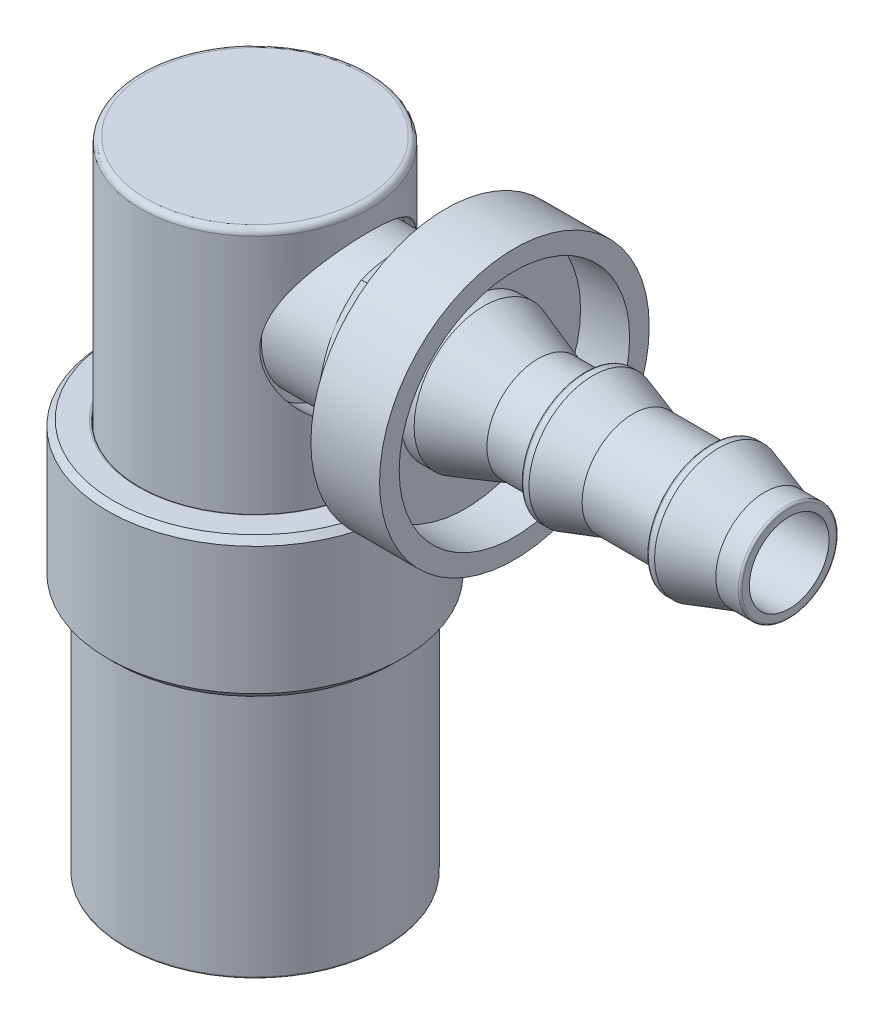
ISO-10303-21;
HEADER;
FILE_DESCRIPTION(('STEP AP214'),'2;1');
FILE_NAME('part.step','',(''),(''),'','','');
FILE_SCHEMA(('AUTOMOTIVE_DESIGN { 1 0 10303 214 1 1 1 1 }'));
ENDSEC;
DATA;
#1=APPLICATION_CONTEXT('core data for automotive mechanical design processes');
#2=APPLICATION_PROTOCOL_DEFINITION('international standard','automotive_design',2000,#1);
#3=PRODUCT_CONTEXT('',#1,'mechanical');
#4=PRODUCT('Part','Part','',(#3));
#5=PRODUCT_RELATED_PRODUCT_CATEGORY('part','',(#4));
#6=PRODUCT_DEFINITION_FORMATION('','',#4);
#7=PRODUCT_DEFINITION_CONTEXT('part definition',#1,'design');
#8=PRODUCT_DEFINITION('design','',#6,#7);
#9=PRODUCT_DEFINITION_SHAPE('','',#8);
#10=(LENGTH_UNIT() NAMED_UNIT(*) SI_UNIT(.MILLI.,.METRE.));
#11=(NAMED_UNIT(*) PLANE_ANGLE_UNIT() SI_UNIT($,.RADIAN.));
#12=(NAMED_UNIT(*) SI_UNIT($,.STERADIAN.) SOLID_ANGLE_UNIT());
#13=UNCERTAINTY_MEASURE_WITH_UNIT(LENGTH_MEASURE(1.E-05),#10,'distance_accuracy_value','');
#14=(GEOMETRIC_REPRESENTATION_CONTEXT(3) GLOBAL_UNCERTAINTY_ASSIGNED_CONTEXT((#13)) GLOBAL_UNIT_ASSIGNED_CONTEXT((#10,
#11,#12)) REPRESENTATION_CONTEXT('',''));
#15=CARTESIAN_POINT('',(0.,0.,0.));
#16=DIRECTION('',(0.,0.,1.));
#17=DIRECTION('',(1.,0.,0.));
#18=AXIS2_PLACEMENT_3D('',#15,#16,#17);
#19=CARTESIAN_POINT('',(3.195062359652,34.650937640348,0.));
#20=DIRECTION('',(1.,0.,0.));
#21=DIRECTION('',(0.,0.,1.));
#22=AXIS2_PLACEMENT_3D('',#19,#20,#21);
#23=CONICAL_SURFACE('',#22,4.318,0.785398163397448);
#24=CARTESIAN_POINT('',(2.814062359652,34.650937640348,0.));
#25=DIRECTION('',(1.,0.,0.));
#26=DIRECTION('',(0.,0.,1.));
#27=AXIS2_PLACEMENT_3D('',#24,#25,#26);
#28=CIRCLE('',#27,3.937);
#29=CARTESIAN_POINT('',(2.814062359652,34.650937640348,-3.937));
#30=VERTEX_POINT('',#29);
#31=EDGE_CURVE('P0_E11',#30,#30,#28,.T.);
#32=ORIENTED_EDGE('',*,*,#31,.T.);
#33=DIRECTION('',(0.707106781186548,0.,-0.707106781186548));
#34=VECTOR('',#33,1.);
#35=CARTESIAN_POINT('',(3.195062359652,34.650937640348,-4.318));
#36=LINE('',#35,#34);
#37=CARTESIAN_POINT('',(3.583682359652,34.650937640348,-4.70662));
#38=VERTEX_POINT('',#37);
#39=EDGE_CURVE('P0_E27',#30,#38,#36,.T.);
#40=ORIENTED_EDGE('',*,*,#39,.T.);
#41=CARTESIAN_POINT('',(3.583682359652,34.650937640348,0.));
#42=DIRECTION('',(-1.,0.,0.));
#43=DIRECTION('',(0.,0.,-1.));
#44=AXIS2_PLACEMENT_3D('',#41,#42,#43);
#45=CIRCLE('',#44,4.70662);
#46=CARTESIAN_POINT('',(3.583682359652,34.650937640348,4.70662));
#47=VERTEX_POINT('',#46);
#48=EDGE_CURVE('P0_E278',#38,#47,#45,.T.);
#49=ORIENTED_EDGE('',*,*,#48,.T.);
#50=CARTESIAN_POINT('',(3.583682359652,34.650937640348,0.));
#51=DIRECTION('',(-1.,0.,0.));
#52=DIRECTION('',(0.,0.,-1.));
#53=AXIS2_PLACEMENT_3D('',#50,#51,#52);
#54=CIRCLE('',#53,4.70662);
#55=EDGE_CURVE('P0_E281',#47,#38,#54,.T.);
#56=ORIENTED_EDGE('',*,*,#55,.T.);
#57=ORIENTED_EDGE('',*,*,#39,.F.);
#58=EDGE_LOOP('',(#32,#40,#49,#56,#57));
#59=FACE_BOUND('',#58,.T.);
#60=ADVANCED_FACE('P0_F16',(#59),#23,.T.);
#61=CARTESIAN_POINT('',(5.989062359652,34.650937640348,0.));
#62=DIRECTION('',(-1.,0.,0.));
#63=DIRECTION('',(0.,0.,-1.));
#64=AXIS2_PLACEMENT_3D('',#61,#62,#63);
#65=CYLINDRICAL_SURFACE('',#64,4.70662);
#66=ORIENTED_EDGE('',*,*,#55,.F.);
#67=DIRECTION('',(1.,0.,0.));
#68=VECTOR('',#67,1.);
#69=CARTESIAN_POINT('',(5.989062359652,34.650937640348,4.70662));
#70=LINE('',#69,#68);
#71=CARTESIAN_POINT('',(9.16846176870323,34.650937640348,4.70662));
#72=VERTEX_POINT('',#71);
#73=EDGE_CURVE('P0_E292',#47,#72,#70,.T.);
#74=ORIENTED_EDGE('',*,*,#73,.T.);
#75=CARTESIAN_POINT('',(9.16846176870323,34.650937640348,0.));
#76=DIRECTION('',(-1.,0.,0.));
#77=DIRECTION('',(0.,0.,-1.));
#78=AXIS2_PLACEMENT_3D('',#75,#76,#77);
#79=CIRCLE('',#78,4.70662);
#80=CARTESIAN_POINT('',(9.16846176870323,34.650937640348,-4.70662));
#81=VERTEX_POINT('',#80);
#82=EDGE_CURVE('P0_E296',#72,#81,#79,.T.);
#83=ORIENTED_EDGE('',*,*,#82,.T.);
#84=CARTESIAN_POINT('',(9.16846176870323,34.650937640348,0.));
#85=DIRECTION('',(-1.,0.,0.));
#86=DIRECTION('',(0.,0.,-1.));
#87=AXIS2_PLACEMENT_3D('',#84,#85,#86);
#88=CIRCLE('',#87,4.70662);
#89=EDGE_CURVE('P0_E315',#81,#72,#88,.T.);
#90=ORIENTED_EDGE('',*,*,#89,.T.);
#91=ORIENTED_EDGE('',*,*,#73,.F.);
#92=ORIENTED_EDGE('',*,*,#48,.F.);
#93=EDGE_LOOP('',(#66,#74,#83,#90,#91,#92));
#94=FACE_BOUND('',#93,.T.);
#95=ADVANCED_FACE('P0_F647',(#94),#65,.T.);
#96=CARTESIAN_POINT('',(2.814062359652,34.650937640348,-2.5781));
#97=DIRECTION('',(-1.,0.,0.));
#98=DIRECTION('',(0.,0.,-1.));
#99=AXIS2_PLACEMENT_3D('',#96,#97,#98);
#100=PLANE('',#99);
#101=ORIENTED_EDGE('',*,*,#31,.F.);
#102=EDGE_LOOP('',(#101));
#103=FACE_BOUND('',#102,.T.);
#104=CARTESIAN_POINT('',(2.814062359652,34.650937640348,0.));
#105=DIRECTION('',(-1.,0.,0.));
#106=DIRECTION('',(0.,-1.,0.));
#107=AXIS2_PLACEMENT_3D('',#104,#105,#106);
#108=CIRCLE('',#107,2.5781);
#109=CARTESIAN_POINT('',(2.814062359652,34.650937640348,-2.5781));
#110=VERTEX_POINT('',#109);
#111=CARTESIAN_POINT('',(2.814062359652,34.650937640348,2.5781));
#112=VERTEX_POINT('',#111);
#113=EDGE_CURVE('P0_E291',#110,#112,#108,.T.);
#114=ORIENTED_EDGE('',*,*,#113,.F.);
#115=CARTESIAN_POINT('',(2.814062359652,34.650937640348,0.));
#116=DIRECTION('',(-1.,0.,0.));
#117=DIRECTION('',(0.,-1.,0.));
#118=AXIS2_PLACEMENT_3D('',#115,#116,#117);
#119=CIRCLE('',#118,2.5781);
#120=EDGE_CURVE('P0_E513',#112,#110,#119,.T.);
#121=ORIENTED_EDGE('',*,*,#120,.F.);
#122=EDGE_LOOP('',(#114,#121));
#123=FACE_BOUND('',#122,.T.);
#124=ADVANCED_FACE('P0_F652',(#103,#123),#100,.T.);
#125=CARTESIAN_POINT('',(2.814062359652,34.650937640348,5.48459661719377));
#126=DIRECTION('',(0.,-0.5,-0.866025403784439));
#127=DIRECTION('',(-1.,0.,0.));
#128=AXIS2_PLACEMENT_3D('',#125,#126,#127);
#129=PLANE('',#128);
#130=CARTESIAN_POINT('',(11.8567327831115,39.400737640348,2.74229830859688));
#131=CARTESIAN_POINT('',(12.6483661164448,37.025837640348,4.11344746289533));
#132=CARTESIAN_POINT('',(11.8567327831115,34.650937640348,5.48459661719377));
#133=(BOUNDED_CURVE() B_SPLINE_CURVE(2,(#130,#131,#132),.UNSPECIFIED.,.F.,
.F.) B_SPLINE_CURVE_WITH_KNOTS((3,3),(0.0756877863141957,0.66089469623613),
.UNSPECIFIED.) CURVE() GEOMETRIC_REPRESENTATION_ITEM() RATIONAL_B_SPLINE_CURVE((1.0473309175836,
1.20935357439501,1.0473309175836)) REPRESENTATION_ITEM(''));
#134=CARTESIAN_POINT('',(11.8567327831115,39.400737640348,2.74229830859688));
#135=VERTEX_POINT('',#134);
#136=CARTESIAN_POINT('',(11.8567327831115,34.650937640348,5.48459661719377));
#137=VERTEX_POINT('',#136);
#138=EDGE_CURVE('P0_E297',#135,#137,#133,.T.);
#139=ORIENTED_EDGE('',*,*,#138,.F.);
#140=DIRECTION('',(1.,0.,0.));
#141=VECTOR('',#140,1.);
#142=CARTESIAN_POINT('',(2.814062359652,39.400737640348,2.74229830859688));
#143=LINE('',#142,#141);
#144=CARTESIAN_POINT('',(9.61762677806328,39.400737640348,2.74229830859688));
#145=VERTEX_POINT('',#144);
#146=EDGE_CURVE('P0_E413',#145,#135,#143,.T.);
#147=ORIENTED_EDGE('',*,*,#146,.F.);
#148=CARTESIAN_POINT('',(9.61762677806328,34.650937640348,5.48459661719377));
#149=CARTESIAN_POINT('',(8.82599344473,37.025837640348,4.1134474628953));
#150=CARTESIAN_POINT('',(9.61762677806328,39.400737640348,2.74229830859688));
#151=(BOUNDED_CURVE() B_SPLINE_CURVE(2,(#148,#149,#150),.UNSPECIFIED.,.F.,
.F.) B_SPLINE_CURVE_WITH_KNOTS((3,3),(0.0756877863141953,0.66089469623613),
.UNSPECIFIED.) CURVE() GEOMETRIC_REPRESENTATION_ITEM() RATIONAL_B_SPLINE_CURVE((1.0473309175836,
1.20935357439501,1.0473309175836)) REPRESENTATION_ITEM(''));
#152=CARTESIAN_POINT('',(9.61762677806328,34.650937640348,5.48459661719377));
#153=VERTEX_POINT('',#152);
#154=EDGE_CURVE('P0_E329',#153,#145,#151,.T.);
#155=ORIENTED_EDGE('',*,*,#154,.F.);
#156=DIRECTION('',(1.,0.,0.));
#157=VECTOR('',#156,1.);
#158=CARTESIAN_POINT('',(2.814062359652,34.650937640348,5.48459661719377));
#159=LINE('',#158,#157);
#160=EDGE_CURVE('P0_E311',#153,#137,#159,.T.);
#161=ORIENTED_EDGE('',*,*,#160,.T.);
#162=EDGE_LOOP('',(#139,#147,#155,#161));
#163=FACE_BOUND('',#162,.T.);
#164=ADVANCED_FACE('P0_F670',(#163),#129,.F.);
#165=CARTESIAN_POINT('',(2.814062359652,29.901137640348,2.74229830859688));
#166=DIRECTION('',(0.,0.5,-0.866025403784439));
#167=DIRECTION('',(0.,0.866025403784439,0.5));
#168=AXIS2_PLACEMENT_3D('',#165,#166,#167);
#169=PLANE('',#168);
#170=CARTESIAN_POINT('',(11.8567327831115,34.650937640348,5.48459661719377));
#171=CARTESIAN_POINT('',(12.6483661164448,32.276037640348,4.11344746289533));
#172=CARTESIAN_POINT('',(11.8567327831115,29.901137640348,2.74229830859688));
#173=(BOUNDED_CURVE() B_SPLINE_CURVE(2,(#170,#171,#172),.UNSPECIFIED.,.F.,
.F.) B_SPLINE_CURVE_WITH_KNOTS((3,3),(0.0756877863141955,0.66089469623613),
.UNSPECIFIED.) CURVE() GEOMETRIC_REPRESENTATION_ITEM() RATIONAL_B_SPLINE_CURVE((1.0473309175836,
1.20935357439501,1.0473309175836)) REPRESENTATION_ITEM(''));
#174=CARTESIAN_POINT('',(11.8567327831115,29.901137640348,2.74229830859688));
#175=VERTEX_POINT('',#174);
#176=EDGE_CURVE('P0_E304',#137,#175,#173,.T.);
#177=ORIENTED_EDGE('',*,*,#176,.F.);
#178=ORIENTED_EDGE('',*,*,#160,.F.);
#179=CARTESIAN_POINT('',(9.61762677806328,29.901137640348,2.74229830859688));
#180=CARTESIAN_POINT('',(8.82599344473,32.276037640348,4.11344746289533));
#181=CARTESIAN_POINT('',(9.61762677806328,34.650937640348,5.48459661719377));
#182=(BOUNDED_CURVE() B_SPLINE_CURVE(2,(#179,#180,#181),.UNSPECIFIED.,.F.,
.F.) B_SPLINE_CURVE_WITH_KNOTS((3,3),(0.0756877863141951,0.66089469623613),
.UNSPECIFIED.) CURVE() GEOMETRIC_REPRESENTATION_ITEM() RATIONAL_B_SPLINE_CURVE((1.0473309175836,
1.20935357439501,1.0473309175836)) REPRESENTATION_ITEM(''));
#183=CARTESIAN_POINT('',(9.61762677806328,29.901137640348,2.74229830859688));
#184=VERTEX_POINT('',#183);
#185=EDGE_CURVE('P0_E237',#184,#153,#182,.T.);
#186=ORIENTED_EDGE('',*,*,#185,.F.);
#187=DIRECTION('',(1.,0.,0.));
#188=VECTOR('',#187,1.);
#189=CARTESIAN_POINT('',(2.814062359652,29.901137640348,2.74229830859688));
#190=LINE('',#189,#188);
#191=EDGE_CURVE('P0_E316',#184,#175,#190,.T.);
#192=ORIENTED_EDGE('',*,*,#191,.T.);
#193=EDGE_LOOP('',(#177,#178,#186,#192));
#194=FACE_BOUND('',#193,.T.);
#195=ADVANCED_FACE('P0_F733',(#194),#169,.F.);
#196=CARTESIAN_POINT('',(2.814062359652,29.901137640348,-2.74229830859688));
#197=DIRECTION('',(0.,1.,0.));
#198=DIRECTION('',(1.,0.,0.));
#199=AXIS2_PLACEMENT_3D('',#196,#197,#198);
#200=PLANE('',#199);
#201=CARTESIAN_POINT('',(11.8567327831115,29.901137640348,2.74229830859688));
#202=CARTESIAN_POINT('',(12.6483661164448,29.901137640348,0.));
#203=CARTESIAN_POINT('',(11.8567327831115,29.901137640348,-2.74229830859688));
#204=(BOUNDED_CURVE() B_SPLINE_CURVE(2,(#201,#202,#203),.UNSPECIFIED.,.F.,
.F.) B_SPLINE_CURVE_WITH_KNOTS((3,3),(0.0756877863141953,0.66089469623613),
.UNSPECIFIED.) CURVE() GEOMETRIC_REPRESENTATION_ITEM() RATIONAL_B_SPLINE_CURVE((1.0473309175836,
1.20935357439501,1.0473309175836)) REPRESENTATION_ITEM(''));
#205=CARTESIAN_POINT('',(11.8567327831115,29.901137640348,-2.74229830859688));
#206=VERTEX_POINT('',#205);
#207=EDGE_CURVE('P0_E245',#175,#206,#204,.T.);
#208=ORIENTED_EDGE('',*,*,#207,.F.);
#209=ORIENTED_EDGE('',*,*,#191,.F.);
#210=CARTESIAN_POINT('',(9.61762677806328,29.901137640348,-2.74229830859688));
#211=CARTESIAN_POINT('',(8.82599344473,29.901137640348,0.));
#212=CARTESIAN_POINT('',(9.61762677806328,29.901137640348,2.74229830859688));
#213=(BOUNDED_CURVE() B_SPLINE_CURVE(2,(#210,#211,#212),.UNSPECIFIED.,.F.,
.F.) B_SPLINE_CURVE_WITH_KNOTS((3,3),(0.0756877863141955,0.660894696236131),
.UNSPECIFIED.) CURVE() GEOMETRIC_REPRESENTATION_ITEM() RATIONAL_B_SPLINE_CURVE((1.0473309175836,
1.20935357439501,1.0473309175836)) REPRESENTATION_ITEM(''));
#214=CARTESIAN_POINT('',(9.61762677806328,29.901137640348,-2.74229830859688));
#215=VERTEX_POINT('',#214);
#216=EDGE_CURVE('P0_E231',#215,#184,#213,.T.);
#217=ORIENTED_EDGE('',*,*,#216,.F.);
#218=DIRECTION('',(1.,0.,0.));
#219=VECTOR('',#218,1.);
#220=CARTESIAN_POINT('',(2.814062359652,29.901137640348,-2.74229830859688));
#221=LINE('',#220,#219);
#222=EDGE_CURVE('P0_E405',#215,#206,#221,.T.);
#223=ORIENTED_EDGE('',*,*,#222,.T.);
#224=EDGE_LOOP('',(#208,#209,#217,#223));
#225=FACE_BOUND('',#224,.T.);
#226=ADVANCED_FACE('P0_F728',(#225),#200,.F.);
#227=CARTESIAN_POINT('',(2.814062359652,34.650937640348,-5.48459661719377));
#228=DIRECTION('',(0.,0.5,0.866025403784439));
#229=DIRECTION('',(1.,0.,0.));
#230=AXIS2_PLACEMENT_3D('',#227,#228,#229);
#231=PLANE('',#230);
#232=CARTESIAN_POINT('',(11.8567327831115,29.901137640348,-2.74229830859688));
#233=CARTESIAN_POINT('',(12.6483661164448,32.276037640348,-4.11344746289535));
#234=CARTESIAN_POINT('',(11.8567327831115,34.650937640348,-5.48459661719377));
#235=(BOUNDED_CURVE() B_SPLINE_CURVE(2,(#232,#233,#234),.UNSPECIFIED.,.F.,
.F.) B_SPLINE_CURVE_WITH_KNOTS((3,3),(0.0756877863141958,0.66089469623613),
.UNSPECIFIED.) CURVE() GEOMETRIC_REPRESENTATION_ITEM() RATIONAL_B_SPLINE_CURVE((1.0473309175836,
1.20935357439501,1.0473309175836)) REPRESENTATION_ITEM(''));
#236=CARTESIAN_POINT('',(11.8567327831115,34.650937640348,-5.48459661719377));
#237=VERTEX_POINT('',#236);
#238=EDGE_CURVE('P0_E478',#206,#237,#235,.T.);
#239=ORIENTED_EDGE('',*,*,#238,.F.);
#240=ORIENTED_EDGE('',*,*,#222,.F.);
#241=CARTESIAN_POINT('',(9.61762677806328,34.650937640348,-5.48459661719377));
#242=CARTESIAN_POINT('',(8.82599344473,32.276037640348,-4.1134474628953));
#243=CARTESIAN_POINT('',(9.61762677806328,29.901137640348,-2.74229830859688));
#244=(BOUNDED_CURVE() B_SPLINE_CURVE(2,(#241,#242,#243),.UNSPECIFIED.,.F.,
.F.) B_SPLINE_CURVE_WITH_KNOTS((3,3),(0.0756877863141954,0.66089469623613),
.UNSPECIFIED.) CURVE() GEOMETRIC_REPRESENTATION_ITEM() RATIONAL_B_SPLINE_CURVE((1.0473309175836,
1.20935357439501,1.0473309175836)) REPRESENTATION_ITEM(''));
#245=CARTESIAN_POINT('',(9.61762677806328,34.650937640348,-5.48459661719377));
#246=VERTEX_POINT('',#245);
#247=EDGE_CURVE('P0_E236',#246,#215,#244,.T.);
#248=ORIENTED_EDGE('',*,*,#247,.F.);
#249=DIRECTION('',(1.,0.,0.));
#250=VECTOR('',#249,1.);
#251=CARTESIAN_POINT('',(2.814062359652,34.650937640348,-5.48459661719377));
#252=LINE('',#251,#250);
#253=EDGE_CURVE('P0_E401',#246,#237,#252,.T.);
#254=ORIENTED_EDGE('',*,*,#253,.T.);
#255=EDGE_LOOP('',(#239,#240,#248,#254));
#256=FACE_BOUND('',#255,.T.);
#257=ADVANCED_FACE('P0_F732',(#256),#231,.F.);
#258=CARTESIAN_POINT('',(2.814062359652,39.400737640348,-2.74229830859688));
#259=DIRECTION('',(0.,-0.5,0.866025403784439));
#260=DIRECTION('',(-1.,0.,0.));
#261=AXIS2_PLACEMENT_3D('',#258,#259,#260);
#262=PLANE('',#261);
#263=CARTESIAN_POINT('',(11.8567327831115,34.650937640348,-5.48459661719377));
#264=CARTESIAN_POINT('',(12.6483661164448,37.025837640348,-4.1134474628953));
#265=CARTESIAN_POINT('',(11.8567327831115,39.400737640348,-2.74229830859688));
#266=(BOUNDED_CURVE() B_SPLINE_CURVE(2,(#263,#264,#265),.UNSPECIFIED.,.F.,
.F.) B_SPLINE_CURVE_WITH_KNOTS((3,3),(0.0756877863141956,0.66089469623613),
.UNSPECIFIED.) CURVE() GEOMETRIC_REPRESENTATION_ITEM() RATIONAL_B_SPLINE_CURVE((1.0473309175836,
1.20935357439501,1.0473309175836)) REPRESENTATION_ITEM(''));
#267=CARTESIAN_POINT('',(11.8567327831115,39.400737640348,-2.74229830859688));
#268=VERTEX_POINT('',#267);
#269=EDGE_CURVE('P0_E161',#237,#268,#266,.T.);
#270=ORIENTED_EDGE('',*,*,#269,.F.);
#271=ORIENTED_EDGE('',*,*,#253,.F.);
#272=CARTESIAN_POINT('',(9.61762677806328,39.400737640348,-2.74229830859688));
#273=CARTESIAN_POINT('',(8.82599344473,37.025837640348,-4.11344746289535));
#274=CARTESIAN_POINT('',(9.61762677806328,34.650937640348,-5.48459661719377));
#275=(BOUNDED_CURVE() B_SPLINE_CURVE(2,(#272,#273,#274),.UNSPECIFIED.,.F.,
.F.) B_SPLINE_CURVE_WITH_KNOTS((3,3),(0.0756877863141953,0.66089469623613),
.UNSPECIFIED.) CURVE() GEOMETRIC_REPRESENTATION_ITEM() RATIONAL_B_SPLINE_CURVE((1.0473309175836,
1.20935357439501,1.0473309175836)) REPRESENTATION_ITEM(''));
#276=CARTESIAN_POINT('',(9.61762677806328,39.400737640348,-2.74229830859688));
#277=VERTEX_POINT('',#276);
#278=EDGE_CURVE('P0_E169',#277,#246,#275,.T.);
#279=ORIENTED_EDGE('',*,*,#278,.F.);
#280=DIRECTION('',(1.,0.,0.));
#281=VECTOR('',#280,1.);
#282=CARTESIAN_POINT('',(2.814062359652,39.400737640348,-2.74229830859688));
#283=LINE('',#282,#281);
#284=EDGE_CURVE('P0_E406',#277,#268,#283,.T.);
#285=ORIENTED_EDGE('',*,*,#284,.T.);
#286=EDGE_LOOP('',(#270,#271,#279,#285));
#287=FACE_BOUND('',#286,.T.);
#288=ADVANCED_FACE('P0_F698',(#287),#262,.F.);
#289=CARTESIAN_POINT('',(2.814062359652,39.400737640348,2.74229830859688));
#290=DIRECTION('',(0.,-1.,0.));
#291=DIRECTION('',(1.,0.,0.));
#292=AXIS2_PLACEMENT_3D('',#289,#290,#291);
#293=PLANE('',#292);
#294=CARTESIAN_POINT('',(11.8567327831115,39.400737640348,-2.74229830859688));
#295=CARTESIAN_POINT('',(12.6483661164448,39.400737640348,0.));
#296=CARTESIAN_POINT('',(11.8567327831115,39.400737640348,2.74229830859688));
#297=(BOUNDED_CURVE() B_SPLINE_CURVE(2,(#294,#295,#296),.UNSPECIFIED.,.F.,
.F.) B_SPLINE_CURVE_WITH_KNOTS((3,3),(0.0756877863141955,0.66089469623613),
.UNSPECIFIED.) CURVE() GEOMETRIC_REPRESENTATION_ITEM() RATIONAL_B_SPLINE_CURVE((1.0473309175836,
1.20935357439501,1.0473309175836)) REPRESENTATION_ITEM(''));
#298=EDGE_CURVE('P0_E303',#268,#135,#297,.T.);
#299=ORIENTED_EDGE('',*,*,#298,.F.);
#300=ORIENTED_EDGE('',*,*,#284,.F.);
#301=CARTESIAN_POINT('',(9.61762677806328,39.400737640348,2.74229830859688));
#302=CARTESIAN_POINT('',(8.82599344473,39.400737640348,0.));
#303=CARTESIAN_POINT('',(9.61762677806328,39.400737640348,-2.74229830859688));
#304=(BOUNDED_CURVE() B_SPLINE_CURVE(2,(#301,#302,#303),.UNSPECIFIED.,.F.,
.F.) B_SPLINE_CURVE_WITH_KNOTS((3,3),(0.0756877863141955,0.66089469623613),
.UNSPECIFIED.) CURVE() GEOMETRIC_REPRESENTATION_ITEM() RATIONAL_B_SPLINE_CURVE((1.0473309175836,
1.20935357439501,1.0473309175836)) REPRESENTATION_ITEM(''));
#305=EDGE_CURVE('P0_E323',#145,#277,#304,.T.);
#306=ORIENTED_EDGE('',*,*,#305,.F.);
#307=ORIENTED_EDGE('',*,*,#146,.T.);
#308=EDGE_LOOP('',(#299,#300,#306,#307));
#309=FACE_BOUND('',#308,.T.);
#310=ADVANCED_FACE('P0_F693',(#309),#293,.F.);
#311=CARTESIAN_POINT('',(11.958062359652,34.650937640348,0.));
#312=DIRECTION('',(-1.,0.,0.));
#313=DIRECTION('',(0.,0.,1.));
#314=AXIS2_PLACEMENT_3D('',#311,#312,#313);
#315=CONICAL_SURFACE('',#314,5.30908864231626,1.0471975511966);
#316=ORIENTED_EDGE('',*,*,#238,.T.);
#317=DIRECTION('',(0.5,0.,0.866025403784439));
#318=VECTOR('',#317,1.);
#319=CARTESIAN_POINT('',(11.958062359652,34.650937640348,-5.30908864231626));
#320=LINE('',#319,#318);
#321=CARTESIAN_POINT('',(12.339062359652,34.650937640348,-4.64917728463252));
#322=VERTEX_POINT('',#321);
#323=EDGE_CURVE('P0_E483',#237,#322,#320,.T.);
#324=ORIENTED_EDGE('',*,*,#323,.T.);
#325=CARTESIAN_POINT('',(12.339062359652,34.650937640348,0.));
#326=DIRECTION('',(-1.,0.,0.));
#327=DIRECTION('',(0.,0.,1.));
#328=AXIS2_PLACEMENT_3D('',#325,#326,#327);
#329=CIRCLE('',#328,4.64917728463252);
#330=EDGE_CURVE('P0_E517',#322,#322,#329,.T.);
#331=ORIENTED_EDGE('',*,*,#330,.T.);
#332=ORIENTED_EDGE('',*,*,#323,.F.);
#333=ORIENTED_EDGE('',*,*,#269,.T.);
#334=ORIENTED_EDGE('',*,*,#298,.T.);
#335=ORIENTED_EDGE('',*,*,#138,.T.);
#336=ORIENTED_EDGE('',*,*,#176,.T.);
#337=ORIENTED_EDGE('',*,*,#207,.T.);
#338=EDGE_LOOP('',(#316,#324,#331,#332,#333,#334,#335,#336,#337));
#339=FACE_BOUND('',#338,.T.);
#340=ADVANCED_FACE('P0_F697',(#339),#315,.T.);
#341=CARTESIAN_POINT('',(12.339062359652,34.650937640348,-5.969));
#342=DIRECTION('',(1.,0.,0.));
#343=DIRECTION('',(0.,-1.,0.));
#344=AXIS2_PLACEMENT_3D('',#341,#342,#343);
#345=PLANE('',#344);
#346=ORIENTED_EDGE('',*,*,#330,.F.);
#347=EDGE_LOOP('',(#346));
#348=FACE_BOUND('',#347,.T.);
#349=CARTESIAN_POINT('',(12.339062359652,34.650937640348,0.));
#350=DIRECTION('',(1.,0.,0.));
#351=DIRECTION('',(0.,0.,1.));
#352=AXIS2_PLACEMENT_3D('',#349,#350,#351);
#353=CIRCLE('',#352,4.2545);
#354=CARTESIAN_POINT('',(12.339062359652,34.650937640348,-4.2545));
#355=VERTEX_POINT('',#354);
#356=CARTESIAN_POINT('',(12.339062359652,34.650937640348,4.2545));
#357=VERTEX_POINT('',#356);
#358=EDGE_CURVE('P0_E206',#355,#357,#353,.T.);
#359=ORIENTED_EDGE('',*,*,#358,.F.);
#360=CARTESIAN_POINT('',(12.339062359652,34.650937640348,0.));
#361=DIRECTION('',(1.,0.,0.));
#362=DIRECTION('',(0.,0.,1.));
#363=AXIS2_PLACEMENT_3D('',#360,#361,#362);
#364=CIRCLE('',#363,4.2545);
#365=EDGE_CURVE('P0_E209',#357,#355,#364,.T.);
#366=ORIENTED_EDGE('',*,*,#365,.F.);
#367=EDGE_LOOP('',(#359,#366));
#368=FACE_BOUND('',#367,.T.);
#369=ADVANCED_FACE('P0_F208',(#348,#368),#345,.T.);
#370=CARTESIAN_POINT('',(9.53067978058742,34.650937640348,0.));
#371=DIRECTION('',(1.,0.,0.));
#372=DIRECTION('',(0.,0.,1.));
#373=AXIS2_PLACEMENT_3D('',#370,#371,#372);
#374=CONICAL_SURFACE('',#373,5.334,1.0471975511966);
#375=ORIENTED_EDGE('',*,*,#82,.F.);
#376=ORIENTED_EDGE('',*,*,#89,.F.);
#377=DIRECTION('',(0.5,0.,-0.866025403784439));
#378=VECTOR('',#377,1.);
#379=CARTESIAN_POINT('',(9.53067978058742,34.650937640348,-5.334));
#380=LINE('',#379,#378);
#381=EDGE_CURVE('P0_E238',#81,#246,#380,.T.);
#382=ORIENTED_EDGE('',*,*,#381,.T.);
#383=ORIENTED_EDGE('',*,*,#247,.T.);
#384=ORIENTED_EDGE('',*,*,#216,.T.);
#385=ORIENTED_EDGE('',*,*,#185,.T.);
#386=ORIENTED_EDGE('',*,*,#154,.T.);
#387=ORIENTED_EDGE('',*,*,#305,.T.);
#388=ORIENTED_EDGE('',*,*,#278,.T.);
#389=ORIENTED_EDGE('',*,*,#381,.F.);
#390=EDGE_LOOP('',(#375,#376,#382,#383,#384,#385,#386,#387,#388,#389));
#391=FACE_BOUND('',#390,.T.);
#392=ADVANCED_FACE('P0_F678',(#391),#374,.T.);
#393=CARTESIAN_POINT('',(12.466062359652,34.650937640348,0.));
#394=DIRECTION('',(-1.,0.,0.));
#395=DIRECTION('',(0.,0.,-1.));
#396=AXIS2_PLACEMENT_3D('',#393,#394,#395);
#397=TOROIDAL_SURFACE('',#396,4.2545,0.127);
#398=CARTESIAN_POINT('',(12.466062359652,34.650937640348,0.));
#399=DIRECTION('',(-1.,0.,0.));
#400=DIRECTION('',(0.,0.,1.));
#401=AXIS2_PLACEMENT_3D('',#398,#399,#400);
#402=CIRCLE('',#401,4.1275);
#403=CARTESIAN_POINT('',(12.466062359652,34.650937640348,-4.1275));
#404=VERTEX_POINT('',#403);
#405=CARTESIAN_POINT('',(12.466062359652,34.650937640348,4.1275));
#406=VERTEX_POINT('',#405);
#407=EDGE_CURVE('P0_E225',#404,#406,#402,.T.);
#408=ORIENTED_EDGE('',*,*,#407,.T.);
#409=CARTESIAN_POINT('',(12.466062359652,34.650937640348,4.2545));
#410=DIRECTION('',(0.,1.,0.));
#411=DIRECTION('',(0.,0.,1.));
#412=AXIS2_PLACEMENT_3D('',#409,#410,#411);
#413=CIRCLE('',#412,0.127);
#414=EDGE_CURVE('P0_E218',#406,#357,#413,.T.);
#415=ORIENTED_EDGE('',*,*,#414,.T.);
#416=ORIENTED_EDGE('',*,*,#365,.T.);
#417=ORIENTED_EDGE('',*,*,#358,.T.);
#418=ORIENTED_EDGE('',*,*,#414,.F.);
#419=CARTESIAN_POINT('',(12.466062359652,34.650937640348,0.));
#420=DIRECTION('',(-1.,0.,0.));
#421=DIRECTION('',(0.,0.,1.));
#422=AXIS2_PLACEMENT_3D('',#419,#420,#421);
#423=CIRCLE('',#422,4.1275);
#424=EDGE_CURVE('P0_E214',#406,#404,#423,.T.);
#425=ORIENTED_EDGE('',*,*,#424,.T.);
#426=EDGE_LOOP('',(#408,#415,#416,#417,#418,#425));
#427=FACE_BOUND('',#426,.T.);
#428=ADVANCED_FACE('P0_F217',(#427),#397,.F.);
#429=CARTESIAN_POINT('',(13.126462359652,34.650937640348,0.));
#430=DIRECTION('',(-1.,0.,0.));
#431=DIRECTION('',(0.,0.,-1.));
#432=AXIS2_PLACEMENT_3D('',#429,#430,#431);
#433=CYLINDRICAL_SURFACE('',#432,4.1275);
#434=ORIENTED_EDGE('',*,*,#407,.F.);
#435=ORIENTED_EDGE('',*,*,#424,.F.);
#436=DIRECTION('',(1.,0.,0.));
#437=VECTOR('',#436,1.);
#438=CARTESIAN_POINT('',(13.126462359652,34.650937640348,4.1275));
#439=LINE('',#438,#437);
#440=CARTESIAN_POINT('',(13.913862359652,34.650937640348,4.1275));
#441=VERTEX_POINT('',#440);
#442=EDGE_CURVE('P0_E380',#406,#441,#439,.T.);
#443=ORIENTED_EDGE('',*,*,#442,.T.);
#444=CARTESIAN_POINT('',(13.913862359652,34.650937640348,0.));
#445=DIRECTION('',(-1.,0.,0.));
#446=DIRECTION('',(0.,-1.,0.));
#447=AXIS2_PLACEMENT_3D('',#444,#445,#446);
#448=CIRCLE('',#447,4.1275);
#449=CARTESIAN_POINT('',(13.913862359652,34.650937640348,-4.1275));
#450=VERTEX_POINT('',#449);
#451=EDGE_CURVE('P0_E384',#441,#450,#448,.T.);
#452=ORIENTED_EDGE('',*,*,#451,.T.);
#453=CARTESIAN_POINT('',(13.913862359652,34.650937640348,0.));
#454=DIRECTION('',(-1.,0.,0.));
#455=DIRECTION('',(0.,-1.,0.));
#456=AXIS2_PLACEMENT_3D('',#453,#454,#455);
#457=CIRCLE('',#456,4.1275);
#458=EDGE_CURVE('P0_E417',#450,#441,#457,.T.);
#459=ORIENTED_EDGE('',*,*,#458,.T.);
#460=ORIENTED_EDGE('',*,*,#442,.F.);
#461=EDGE_LOOP('',(#434,#435,#443,#452,#459,#460));
#462=FACE_BOUND('',#461,.T.);
#463=ADVANCED_FACE('P0_F18',(#462),#433,.T.);
#464=CARTESIAN_POINT('',(21.483062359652,34.650937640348,0.));
#465=DIRECTION('',(-1.,0.,0.));
#466=DIRECTION('',(0.,0.,-1.));
#467=AXIS2_PLACEMENT_3D('',#464,#465,#466);
#468=TOROIDAL_SURFACE('',#467,4.01319999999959,0.127);
#469=CARTESIAN_POINT('',(21.356062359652,34.650937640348,0.));
#470=DIRECTION('',(1.,0.,0.));
#471=DIRECTION('',(0.,0.,1.));
#472=AXIS2_PLACEMENT_3D('',#469,#470,#471);
#473=CIRCLE('',#472,4.01319999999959);
#474=CARTESIAN_POINT('',(21.356062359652,34.650937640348,-4.01319999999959));
#475=VERTEX_POINT('',#474);
#476=CARTESIAN_POINT('',(21.356062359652,34.650937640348,4.01319999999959));
#477=VERTEX_POINT('',#476);
#478=EDGE_CURVE('P0_E414',#475,#477,#473,.T.);
#479=ORIENTED_EDGE('',*,*,#478,.T.);
#480=CARTESIAN_POINT('',(21.483062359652,34.650937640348,4.01319999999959));
#481=DIRECTION('',(0.,1.,0.));
#482=DIRECTION('',(0.,0.,1.));
#483=AXIS2_PLACEMENT_3D('',#480,#481,#482);
#484=CIRCLE('',#483,0.127);
#485=CARTESIAN_POINT('',(21.483062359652,34.650937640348,4.1401999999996));
#486=VERTEX_POINT('',#485);
#487=EDGE_CURVE('P0_E418',#477,#486,#484,.T.);
#488=ORIENTED_EDGE('',*,*,#487,.T.);
#489=CARTESIAN_POINT('',(21.483062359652,34.650937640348,0.));
#490=DIRECTION('',(-1.,0.,0.));
#491=DIRECTION('',(0.,0.,1.));
#492=AXIS2_PLACEMENT_3D('',#489,#490,#491);
#493=CIRCLE('',#492,4.1401999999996);
#494=CARTESIAN_POINT('',(21.483062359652,34.650937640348,-4.1401999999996));
#495=VERTEX_POINT('',#494);
#496=EDGE_CURVE('P0_E429',#486,#495,#493,.T.);
#497=ORIENTED_EDGE('',*,*,#496,.T.);
#498=CARTESIAN_POINT('',(21.483062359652,34.650937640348,0.));
#499=DIRECTION('',(-1.,0.,0.));
#500=DIRECTION('',(0.,0.,1.));
#501=AXIS2_PLACEMENT_3D('',#498,#499,#500);
#502=CIRCLE('',#501,4.1401999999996);
#503=EDGE_CURVE('P0_E437',#495,#486,#502,.T.);
#504=ORIENTED_EDGE('',*,*,#503,.T.);
#505=ORIENTED_EDGE('',*,*,#487,.F.);
#506=CARTESIAN_POINT('',(21.356062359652,34.650937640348,0.));
#507=DIRECTION('',(1.,0.,0.));
#508=DIRECTION('',(0.,0.,1.));
#509=AXIS2_PLACEMENT_3D('',#506,#507,#508);
#510=CIRCLE('',#509,4.01319999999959);
#511=EDGE_CURVE('P0_E499',#477,#475,#510,.T.);
#512=ORIENTED_EDGE('',*,*,#511,.T.);
#513=EDGE_LOOP('',(#479,#488,#497,#504,#505,#512));
#514=FACE_BOUND('',#513,.T.);
#515=ADVANCED_FACE('P0_F838',(#514),#468,.T.);
#516=CARTESIAN_POINT('',(21.610062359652,34.650937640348,0.));
#517=DIRECTION('',(-1.,0.,0.));
#518=DIRECTION('',(0.,0.,-1.));
#519=AXIS2_PLACEMENT_3D('',#516,#517,#518);
#520=CYLINDRICAL_SURFACE('',#519,4.1401999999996);
#521=ORIENTED_EDGE('',*,*,#503,.F.);
#522=ORIENTED_EDGE('',*,*,#496,.F.);
#523=DIRECTION('',(1.,0.,0.));
#524=VECTOR('',#523,1.);
#525=CARTESIAN_POINT('',(21.610062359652,34.650937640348,4.1401999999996));
#526=LINE('',#525,#524);
#527=CARTESIAN_POINT('',(21.864062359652,34.650937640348,4.1401999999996));
#528=VERTEX_POINT('',#527);
#529=EDGE_CURVE('P0_E540',#486,#528,#526,.T.);
#530=ORIENTED_EDGE('',*,*,#529,.T.);
#531=CARTESIAN_POINT('',(21.864062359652,34.650937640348,0.));
#532=DIRECTION('',(-1.,0.,0.));
#533=DIRECTION('',(0.,-1.,0.));
#534=AXIS2_PLACEMENT_3D('',#531,#532,#533);
#535=CIRCLE('',#534,4.14019999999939);
#536=CARTESIAN_POINT('',(21.864062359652,34.650937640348,-4.14019999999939));
#537=VERTEX_POINT('',#536);
#538=EDGE_CURVE('P0_E255',#528,#537,#535,.T.);
#539=ORIENTED_EDGE('',*,*,#538,.T.);
#540=CARTESIAN_POINT('',(21.864062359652,34.650937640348,0.));
#541=DIRECTION('',(-1.,0.,0.));
#542=DIRECTION('',(0.,-1.,0.));
#543=AXIS2_PLACEMENT_3D('',#540,#541,#542);
#544=CIRCLE('',#543,4.14019999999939);
#545=EDGE_CURVE('P0_E252',#537,#528,#544,.T.);
#546=ORIENTED_EDGE('',*,*,#545,.T.);
#547=ORIENTED_EDGE('',*,*,#529,.F.);
#548=EDGE_LOOP('',(#521,#522,#530,#539,#546,#547));
#549=FACE_BOUND('',#548,.T.);
#550=ADVANCED_FACE('P0_F743',(#549),#520,.T.);
#551=CARTESIAN_POINT('',(21.356062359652,34.650937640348,-3.30199999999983));
#552=DIRECTION('',(-1.,0.,0.));
#553=DIRECTION('',(0.,0.,-1.));
#554=AXIS2_PLACEMENT_3D('',#551,#552,#553);
#555=PLANE('',#554);
#556=ORIENTED_EDGE('',*,*,#478,.F.);
#557=ORIENTED_EDGE('',*,*,#511,.F.);
#558=EDGE_LOOP('',(#556,#557));
#559=FACE_BOUND('',#558,.T.);
#560=CARTESIAN_POINT('',(21.356062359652,34.650937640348,0.));
#561=DIRECTION('',(-1.,0.,0.));
#562=DIRECTION('',(0.,-1.,0.));
#563=AXIS2_PLACEMENT_3D('',#560,#561,#562);
#564=CIRCLE('',#563,3.30199999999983);
#565=CARTESIAN_POINT('',(21.356062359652,34.650937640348,-3.30199999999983));
#566=VERTEX_POINT('',#565);
#567=CARTESIAN_POINT('',(21.356062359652,34.650937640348,3.30199999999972));
#568=VERTEX_POINT('',#567);
#569=EDGE_CURVE('P0_E373',#566,#568,#564,.T.);
#570=ORIENTED_EDGE('',*,*,#569,.F.);
#571=CARTESIAN_POINT('',(21.356062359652,34.650937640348,0.));
#572=DIRECTION('',(-1.,0.,0.));
#573=DIRECTION('',(0.,-1.,0.));
#574=AXIS2_PLACEMENT_3D('',#571,#572,#573);
#575=CIRCLE('',#574,3.30199999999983);
#576=EDGE_CURVE('P0_E367',#568,#566,#575,.T.);
#577=ORIENTED_EDGE('',*,*,#576,.F.);
#578=EDGE_LOOP('',(#570,#577));
#579=FACE_BOUND('',#578,.T.);
#580=ADVANCED_FACE('P0_F563',(#559,#579),#555,.T.);
#581=CARTESIAN_POINT('',(29.611062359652,34.650937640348,0.));
#582=DIRECTION('',(-1.,0.,0.));
#583=DIRECTION('',(0.,0.,-1.));
#584=AXIS2_PLACEMENT_3D('',#581,#582,#583);
#585=TOROIDAL_SURFACE('',#584,4.01319999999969,0.127);
#586=CARTESIAN_POINT('',(29.484062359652,34.650937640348,0.));
#587=DIRECTION('',(1.,0.,0.));
#588=DIRECTION('',(0.,0.,1.));
#589=AXIS2_PLACEMENT_3D('',#586,#587,#588);
#590=CIRCLE('',#589,4.01319999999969);
#591=CARTESIAN_POINT('',(29.484062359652,34.650937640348,-4.01319999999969));
#592=VERTEX_POINT('',#591);
#593=CARTESIAN_POINT('',(29.484062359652,34.650937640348,4.01319999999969));
#594=VERTEX_POINT('',#593);
#595=EDGE_CURVE('P0_E256',#592,#594,#590,.T.);
#596=ORIENTED_EDGE('',*,*,#595,.T.);
#597=CARTESIAN_POINT('',(29.611062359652,34.650937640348,4.01319999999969));
#598=DIRECTION('',(0.,1.,0.));
#599=DIRECTION('',(0.,0.,1.));
#600=AXIS2_PLACEMENT_3D('',#597,#598,#599);
#601=CIRCLE('',#600,0.127);
#602=CARTESIAN_POINT('',(29.611062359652,34.650937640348,4.14019999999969));
#603=VERTEX_POINT('',#602);
#604=EDGE_CURVE('P0_E263',#594,#603,#601,.T.);
#605=ORIENTED_EDGE('',*,*,#604,.T.);
#606=CARTESIAN_POINT('',(29.611062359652,34.650937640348,0.));
#607=DIRECTION('',(-1.,0.,0.));
#608=DIRECTION('',(0.,0.,1.));
#609=AXIS2_PLACEMENT_3D('',#606,#607,#608);
#610=CIRCLE('',#609,4.14019999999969);
#611=CARTESIAN_POINT('',(29.611062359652,34.650937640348,-4.14019999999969));
#612=VERTEX_POINT('',#611);
#613=EDGE_CURVE('P0_E267',#603,#612,#610,.T.);
#614=ORIENTED_EDGE('',*,*,#613,.T.);
#615=CARTESIAN_POINT('',(29.611062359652,34.650937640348,0.));
#616=DIRECTION('',(-1.,0.,0.));
#617=DIRECTION('',(0.,0.,1.));
#618=AXIS2_PLACEMENT_3D('',#615,#616,#617);
#619=CIRCLE('',#618,4.14019999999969);
#620=EDGE_CURVE('P0_E330',#612,#603,#619,.T.);
#621=ORIENTED_EDGE('',*,*,#620,.T.);
#622=ORIENTED_EDGE('',*,*,#604,.F.);
#623=CARTESIAN_POINT('',(29.484062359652,34.650937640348,0.));
#624=DIRECTION('',(1.,0.,0.));
#625=DIRECTION('',(0.,0.,1.));
#626=AXIS2_PLACEMENT_3D('',#623,#624,#625);
#627=CIRCLE('',#626,4.01319999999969);
#628=EDGE_CURVE('P0_E229',#594,#592,#627,.T.);
#629=ORIENTED_EDGE('',*,*,#628,.T.);
#630=EDGE_LOOP('',(#596,#605,#614,#621,#622,#629));
#631=FACE_BOUND('',#630,.T.);
#632=ADVANCED_FACE('P0_F742',(#631),#585,.T.);
#633=CARTESIAN_POINT('',(29.738062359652,34.650937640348,0.));
#634=DIRECTION('',(-1.,0.,0.));
#635=DIRECTION('',(0.,0.,-1.));
#636=AXIS2_PLACEMENT_3D('',#633,#634,#635);
#637=CYLINDRICAL_SURFACE('',#636,4.14019999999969);
#638=ORIENTED_EDGE('',*,*,#620,.F.);
#639=ORIENTED_EDGE('',*,*,#613,.F.);
#640=DIRECTION('',(1.,0.,0.));
#641=VECTOR('',#640,1.);
#642=CARTESIAN_POINT('',(29.738062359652,34.650937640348,4.14019999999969));
#643=LINE('',#642,#641);
#644=CARTESIAN_POINT('',(29.992062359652,34.650937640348,4.14019999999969));
#645=VERTEX_POINT('',#644);
#646=EDGE_CURVE('P0_E268',#603,#645,#643,.T.);
#647=ORIENTED_EDGE('',*,*,#646,.T.);
#648=CARTESIAN_POINT('',(29.992062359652,34.650937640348,0.));
#649=DIRECTION('',(-1.,0.,0.));
#650=DIRECTION('',(0.,-1.,0.));
#651=AXIS2_PLACEMENT_3D('',#648,#649,#650);
#652=CIRCLE('',#651,4.14019999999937);
#653=CARTESIAN_POINT('',(29.992062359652,34.650937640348,-4.14019999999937));
#654=VERTEX_POINT('',#653);
#655=EDGE_CURVE('P0_E272',#645,#654,#652,.T.);
#656=ORIENTED_EDGE('',*,*,#655,.T.);
#657=CARTESIAN_POINT('',(29.992062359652,34.650937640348,0.));
#658=DIRECTION('',(-1.,0.,0.));
#659=DIRECTION('',(0.,-1.,0.));
#660=AXIS2_PLACEMENT_3D('',#657,#658,#659);
#661=CIRCLE('',#660,4.14019999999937);
#662=EDGE_CURVE('P0_E336',#654,#645,#661,.T.);
#663=ORIENTED_EDGE('',*,*,#662,.T.);
#664=ORIENTED_EDGE('',*,*,#646,.F.);
#665=EDGE_LOOP('',(#638,#639,#647,#656,#663,#664));
#666=FACE_BOUND('',#665,.T.);
#667=ADVANCED_FACE('P0_F761',(#666),#637,.T.);
#668=CARTESIAN_POINT('',(29.484062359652,34.650937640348,-3.302));
#669=DIRECTION('',(-1.,0.,0.));
#670=DIRECTION('',(0.,0.,-1.));
#671=AXIS2_PLACEMENT_3D('',#668,#669,#670);
#672=PLANE('',#671);
#673=ORIENTED_EDGE('',*,*,#595,.F.);
#674=ORIENTED_EDGE('',*,*,#628,.F.);
#675=EDGE_LOOP('',(#673,#674));
#676=FACE_BOUND('',#675,.T.);
#677=CARTESIAN_POINT('',(29.484062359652,34.650937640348,0.));
#678=DIRECTION('',(-1.,0.,0.));
#679=DIRECTION('',(0.,-1.,0.));
#680=AXIS2_PLACEMENT_3D('',#677,#678,#679);
#681=CIRCLE('',#680,3.302);
#682=CARTESIAN_POINT('',(29.484062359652,34.650937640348,-3.302));
#683=VERTEX_POINT('',#682);
#684=CARTESIAN_POINT('',(29.484062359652,34.650937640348,3.302));
#685=VERTEX_POINT('',#684);
#686=EDGE_CURVE('P0_E128',#683,#685,#681,.T.);
#687=ORIENTED_EDGE('',*,*,#686,.F.);
#688=CARTESIAN_POINT('',(29.484062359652,34.650937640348,0.));
#689=DIRECTION('',(-1.,0.,0.));
#690=DIRECTION('',(0.,-1.,0.));
#691=AXIS2_PLACEMENT_3D('',#688,#689,#690);
#692=CIRCLE('',#691,3.302);
#693=EDGE_CURVE('P0_E385',#685,#683,#692,.T.);
#694=ORIENTED_EDGE('',*,*,#693,.F.);
#695=EDGE_LOOP('',(#687,#694));
#696=FACE_BOUND('',#695,.T.);
#697=ADVANCED_FACE('P0_F709',(#676,#696),#672,.T.);
#698=CARTESIAN_POINT('',(34.437062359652,34.650937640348,0.));
#699=DIRECTION('',(-1.,0.,0.));
#700=DIRECTION('',(0.,0.,-1.));
#701=AXIS2_PLACEMENT_3D('',#698,#699,#700);
#702=TOROIDAL_SURFACE('',#701,3.04800000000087,0.127);
#703=CARTESIAN_POINT('',(34.437062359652,34.650937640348,0.));
#704=DIRECTION('',(1.,0.,0.));
#705=DIRECTION('',(0.,0.,1.));
#706=AXIS2_PLACEMENT_3D('',#703,#704,#705);
#707=CIRCLE('',#706,3.17500000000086);
#708=CARTESIAN_POINT('',(34.437062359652,34.650937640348,-3.17500000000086));
#709=VERTEX_POINT('',#708);
#710=CARTESIAN_POINT('',(34.437062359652,34.650937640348,3.17500000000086));
#711=VERTEX_POINT('',#710);
#712=EDGE_CURVE('P0_E343',#709,#711,#707,.T.);
#713=ORIENTED_EDGE('',*,*,#712,.T.);
#714=CARTESIAN_POINT('',(34.437062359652,34.650937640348,3.04800000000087));
#715=DIRECTION('',(0.,1.,0.));
#716=DIRECTION('',(0.,0.,1.));
#717=AXIS2_PLACEMENT_3D('',#714,#715,#716);
#718=CIRCLE('',#717,0.127);
#719=CARTESIAN_POINT('',(34.564062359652,34.650937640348,3.04800000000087));
#720=VERTEX_POINT('',#719);
#721=EDGE_CURVE('P0_E351',#711,#720,#718,.T.);
#722=ORIENTED_EDGE('',*,*,#721,.T.);
#723=CARTESIAN_POINT('',(34.564062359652,34.650937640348,0.));
#724=DIRECTION('',(-1.,0.,0.));
#725=DIRECTION('',(0.,0.,1.));
#726=AXIS2_PLACEMENT_3D('',#723,#724,#725);
#727=CIRCLE('',#726,3.04800000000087);
#728=CARTESIAN_POINT('',(34.564062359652,34.650937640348,-3.04800000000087));
#729=VERTEX_POINT('',#728);
#730=EDGE_CURVE('P0_E394',#720,#729,#727,.T.);
#731=ORIENTED_EDGE('',*,*,#730,.T.);
#732=CARTESIAN_POINT('',(34.564062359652,34.650937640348,0.));
#733=DIRECTION('',(-1.,0.,0.));
#734=DIRECTION('',(0.,0.,1.));
#735=AXIS2_PLACEMENT_3D('',#732,#733,#734);
#736=CIRCLE('',#735,3.04800000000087);
#737=EDGE_CURVE('P0_E321',#729,#720,#736,.T.);
#738=ORIENTED_EDGE('',*,*,#737,.T.);
#739=ORIENTED_EDGE('',*,*,#721,.F.);
#740=CARTESIAN_POINT('',(34.437062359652,34.650937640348,0.));
#741=DIRECTION('',(1.,0.,0.));
#742=DIRECTION('',(0.,0.,1.));
#743=AXIS2_PLACEMENT_3D('',#740,#741,#742);
#744=CIRCLE('',#743,3.17500000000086);
#745=EDGE_CURVE('P0_E317',#711,#709,#744,.T.);
#746=ORIENTED_EDGE('',*,*,#745,.T.);
#747=EDGE_LOOP('',(#713,#722,#731,#738,#739,#746));
#748=FACE_BOUND('',#747,.T.);
#749=ADVANCED_FACE('P0_F704',(#748),#702,.T.);
#750=CARTESIAN_POINT('',(33.7766623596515,34.650937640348,0.));
#751=DIRECTION('',(-1.,0.,0.));
#752=DIRECTION('',(0.,0.,-1.));
#753=AXIS2_PLACEMENT_3D('',#750,#751,#752);
#754=CYLINDRICAL_SURFACE('',#753,3.17500000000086);
#755=CARTESIAN_POINT('',(32.989262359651,34.650937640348,0.));
#756=DIRECTION('',(-1.,0.,0.));
#757=DIRECTION('',(0.,-1.,0.));
#758=AXIS2_PLACEMENT_3D('',#755,#756,#757);
#759=CIRCLE('',#758,3.17500000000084);
#760=CARTESIAN_POINT('',(32.989262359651,34.650937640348,-3.17500000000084));
#761=VERTEX_POINT('',#760);
#762=CARTESIAN_POINT('',(32.989262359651,34.650937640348,3.17500000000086));
#763=VERTEX_POINT('',#762);
#764=EDGE_CURVE('P0_E246',#761,#763,#759,.T.);
#765=ORIENTED_EDGE('',*,*,#764,.F.);
#766=CARTESIAN_POINT('',(32.989262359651,34.650937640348,0.));
#767=DIRECTION('',(-1.,0.,0.));
#768=DIRECTION('',(0.,-1.,0.));
#769=AXIS2_PLACEMENT_3D('',#766,#767,#768);
#770=CIRCLE('',#769,3.17500000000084);
#771=EDGE_CURVE('P0_E250',#763,#761,#770,.T.);
#772=ORIENTED_EDGE('',*,*,#771,.F.);
#773=DIRECTION('',(1.,0.,0.));
#774=VECTOR('',#773,1.);
#775=CARTESIAN_POINT('',(33.7766623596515,34.650937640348,3.17500000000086));
#776=LINE('',#775,#774);
#777=EDGE_CURVE('P0_E322',#763,#711,#776,.T.);
#778=ORIENTED_EDGE('',*,*,#777,.T.);
#779=ORIENTED_EDGE('',*,*,#712,.F.);
#780=ORIENTED_EDGE('',*,*,#745,.F.);
#781=ORIENTED_EDGE('',*,*,#777,.F.);
#782=EDGE_LOOP('',(#765,#772,#778,#779,#780,#781));
#783=FACE_BOUND('',#782,.T.);
#784=ADVANCED_FACE('P0_F625',(#783),#754,.T.);
#785=CARTESIAN_POINT('',(34.564062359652,34.650937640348,-3.17500000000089));
#786=DIRECTION('',(1.,0.,0.));
#787=DIRECTION('',(0.,-1.,0.));
#788=AXIS2_PLACEMENT_3D('',#785,#786,#787);
#789=PLANE('',#788);
#790=ORIENTED_EDGE('',*,*,#737,.F.);
#791=ORIENTED_EDGE('',*,*,#730,.F.);
#792=EDGE_LOOP('',(#790,#791));
#793=FACE_BOUND('',#792,.T.);
#794=CARTESIAN_POINT('',(34.564062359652,34.650937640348,0.));
#795=DIRECTION('',(-1.,0.,0.));
#796=DIRECTION('',(0.,-1.,0.));
#797=AXIS2_PLACEMENT_3D('',#794,#795,#796);
#798=CIRCLE('',#797,2.5781);
#799=CARTESIAN_POINT('',(34.564062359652,34.650937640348,-2.5781));
#800=VERTEX_POINT('',#799);
#801=CARTESIAN_POINT('',(34.564062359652,34.650937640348,2.5781));
#802=VERTEX_POINT('',#801);
#803=EDGE_CURVE('P0_E458',#800,#802,#798,.T.);
#804=ORIENTED_EDGE('',*,*,#803,.T.);
#805=CARTESIAN_POINT('',(34.564062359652,34.650937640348,0.));
#806=DIRECTION('',(-1.,0.,0.));
#807=DIRECTION('',(0.,-1.,0.));
#808=AXIS2_PLACEMENT_3D('',#805,#806,#807);
#809=CIRCLE('',#808,2.5781);
#810=EDGE_CURVE('P0_E451',#802,#800,#809,.T.);
#811=ORIENTED_EDGE('',*,*,#810,.T.);
#812=EDGE_LOOP('',(#804,#811));
#813=FACE_BOUND('',#812,.T.);
#814=ADVANCED_FACE('P0_F717',(#793,#813),#789,.T.);
#815=CARTESIAN_POINT('',(31.4906623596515,34.650937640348,0.));
#816=DIRECTION('',(-1.,0.,0.));
#817=DIRECTION('',(0.,0.,-1.));
#818=AXIS2_PLACEMENT_3D('',#815,#816,#817);
#819=CONICAL_SURFACE('',#818,3.6576000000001,0.311546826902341);
#820=ORIENTED_EDGE('',*,*,#662,.F.);
#821=ORIENTED_EDGE('',*,*,#655,.F.);
#822=DIRECTION('',(0.95186055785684,0.,-0.306531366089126));
#823=VECTOR('',#822,1.);
#824=CARTESIAN_POINT('',(31.4906623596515,34.650937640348,3.6576000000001));
#825=LINE('',#824,#823);
#826=EDGE_CURVE('P0_E20',#645,#763,#825,.T.);
#827=ORIENTED_EDGE('',*,*,#826,.T.);
#828=ORIENTED_EDGE('',*,*,#771,.T.);
#829=ORIENTED_EDGE('',*,*,#764,.T.);
#830=ORIENTED_EDGE('',*,*,#826,.F.);
#831=EDGE_LOOP('',(#820,#821,#827,#828,#829,#830));
#832=FACE_BOUND('',#831,.T.);
#833=ADVANCED_FACE('P0_F620',(#832),#819,.T.);
#834=CARTESIAN_POINT('',(26.9754781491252,34.650937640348,0.));
#835=DIRECTION('',(-1.,0.,0.));
#836=DIRECTION('',(0.,0.,-1.));
#837=AXIS2_PLACEMENT_3D('',#834,#835,#836);
#838=CYLINDRICAL_SURFACE('',#837,3.302);
#839=CARTESIAN_POINT('',(24.4668939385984,34.650937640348,0.));
#840=DIRECTION('',(-1.,0.,0.));
#841=DIRECTION('',(0.,-1.,0.));
#842=AXIS2_PLACEMENT_3D('',#839,#840,#841);
#843=CIRCLE('',#842,3.302);
#844=CARTESIAN_POINT('',(24.4668939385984,34.650937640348,-3.302));
#845=VERTEX_POINT('',#844);
#846=CARTESIAN_POINT('',(24.4668939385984,34.650937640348,3.302));
#847=VERTEX_POINT('',#846);
#848=EDGE_CURVE('P0_E366',#845,#847,#843,.T.);
#849=ORIENTED_EDGE('',*,*,#848,.F.);
#850=CARTESIAN_POINT('',(24.4668939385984,34.650937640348,0.));
#851=DIRECTION('',(-1.,0.,0.));
#852=DIRECTION('',(0.,-1.,0.));
#853=AXIS2_PLACEMENT_3D('',#850,#851,#852);
#854=CIRCLE('',#853,3.302);
#855=EDGE_CURVE('P0_E372',#847,#845,#854,.T.);
#856=ORIENTED_EDGE('',*,*,#855,.F.);
#857=DIRECTION('',(1.,0.,0.));
#858=VECTOR('',#857,1.);
#859=CARTESIAN_POINT('',(26.9754781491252,34.650937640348,3.302));
#860=LINE('',#859,#858);
#861=EDGE_CURVE('P0_E251',#847,#685,#860,.T.);
#862=ORIENTED_EDGE('',*,*,#861,.T.);
#863=ORIENTED_EDGE('',*,*,#693,.T.);
#864=ORIENTED_EDGE('',*,*,#686,.T.);
#865=ORIENTED_EDGE('',*,*,#861,.F.);
#866=EDGE_LOOP('',(#849,#856,#862,#863,#864,#865));
#867=FACE_BOUND('',#866,.T.);
#868=ADVANCED_FACE('P0_F684',(#867),#838,.T.);
#869=CARTESIAN_POINT('',(23.1654781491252,34.650937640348,0.));
#870=DIRECTION('',(-1.,0.,0.));
#871=DIRECTION('',(0.,0.,-1.));
#872=AXIS2_PLACEMENT_3D('',#869,#870,#871);
#873=CONICAL_SURFACE('',#872,3.72109999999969,0.311546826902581);
#874=ORIENTED_EDGE('',*,*,#545,.F.);
#875=ORIENTED_EDGE('',*,*,#538,.F.);
#876=DIRECTION('',(0.951860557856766,0.,-0.306531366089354));
#877=VECTOR('',#876,1.);
#878=CARTESIAN_POINT('',(23.1654781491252,34.650937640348,3.72109999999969));
#879=LINE('',#878,#877);
#880=EDGE_CURVE('P0_E368',#528,#847,#879,.T.);
#881=ORIENTED_EDGE('',*,*,#880,.T.);
#882=ORIENTED_EDGE('',*,*,#855,.T.);
#883=ORIENTED_EDGE('',*,*,#848,.T.);
#884=ORIENTED_EDGE('',*,*,#880,.F.);
#885=EDGE_LOOP('',(#874,#875,#881,#882,#883,#884));
#886=FACE_BOUND('',#885,.T.);
#887=ADVANCED_FACE('P0_F688',(#886),#873,.T.);
#888=CARTESIAN_POINT('',(19.832062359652,34.650937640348,0.));
#889=DIRECTION('',(-1.,0.,0.));
#890=DIRECTION('',(0.,0.,-1.));
#891=AXIS2_PLACEMENT_3D('',#888,#889,#890);
#892=CYLINDRICAL_SURFACE('',#891,3.30199999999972);
#893=CARTESIAN_POINT('',(18.308062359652,34.650937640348,0.));
#894=DIRECTION('',(-1.,0.,0.));
#895=DIRECTION('',(0.,-1.,0.));
#896=AXIS2_PLACEMENT_3D('',#893,#894,#895);
#897=CIRCLE('',#896,3.30199999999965);
#898=CARTESIAN_POINT('',(18.308062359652,34.650937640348,-3.30199999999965));
#899=VERTEX_POINT('',#898);
#900=CARTESIAN_POINT('',(18.308062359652,34.650937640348,3.30199999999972));
#901=VERTEX_POINT('',#900);
#902=EDGE_CURVE('P0_E257',#899,#901,#897,.T.);
#903=ORIENTED_EDGE('',*,*,#902,.F.);
#904=CARTESIAN_POINT('',(18.308062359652,34.650937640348,0.));
#905=DIRECTION('',(-1.,0.,0.));
#906=DIRECTION('',(0.,-1.,0.));
#907=AXIS2_PLACEMENT_3D('',#904,#905,#906);
#908=CIRCLE('',#907,3.30199999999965);
#909=EDGE_CURVE('P0_E261',#901,#899,#908,.T.);
#910=ORIENTED_EDGE('',*,*,#909,.F.);
#911=DIRECTION('',(1.,0.,0.));
#912=VECTOR('',#911,1.);
#913=CARTESIAN_POINT('',(19.832062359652,34.650937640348,3.30199999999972));
#914=LINE('',#913,#912);
#915=EDGE_CURVE('P0_E359',#901,#568,#914,.T.);
#916=ORIENTED_EDGE('',*,*,#915,.T.);
#917=ORIENTED_EDGE('',*,*,#576,.T.);
#918=ORIENTED_EDGE('',*,*,#569,.T.);
#919=ORIENTED_EDGE('',*,*,#915,.F.);
#920=EDGE_LOOP('',(#903,#910,#916,#917,#918,#919));
#921=FACE_BOUND('',#920,.T.);
#922=ADVANCED_FACE('P0_F559',(#921),#892,.T.);
#923=CARTESIAN_POINT('',(16.555462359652,34.650937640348,0.));
#924=DIRECTION('',(-1.,0.,0.));
#925=DIRECTION('',(0.,0.,-1.));
#926=AXIS2_PLACEMENT_3D('',#923,#924,#925);
#927=CONICAL_SURFACE('',#926,3.90524999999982,0.3315010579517);
#928=CARTESIAN_POINT('',(14.802862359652,34.650937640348,0.));
#929=DIRECTION('',(-1.,0.,0.));
#930=DIRECTION('',(0.,-1.,0.));
#931=AXIS2_PLACEMENT_3D('',#928,#929,#930);
#932=CIRCLE('',#931,4.5085);
#933=CARTESIAN_POINT('',(14.802862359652,34.650937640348,-4.5085));
#934=VERTEX_POINT('',#933);
#935=CARTESIAN_POINT('',(14.802862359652,34.650937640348,4.5085));
#936=VERTEX_POINT('',#935);
#937=EDGE_CURVE('P0_E277',#934,#936,#932,.T.);
#938=ORIENTED_EDGE('',*,*,#937,.F.);
#939=CARTESIAN_POINT('',(14.802862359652,34.650937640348,0.));
#940=DIRECTION('',(-1.,0.,0.));
#941=DIRECTION('',(0.,-1.,0.));
#942=AXIS2_PLACEMENT_3D('',#939,#940,#941);
#943=CIRCLE('',#942,4.5085);
#944=EDGE_CURVE('P0_E273',#936,#934,#943,.T.);
#945=ORIENTED_EDGE('',*,*,#944,.F.);
#946=DIRECTION('',(0.945554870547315,0.,-0.325462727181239));
#947=VECTOR('',#946,1.);
#948=CARTESIAN_POINT('',(16.555462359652,34.650937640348,3.90524999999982));
#949=LINE('',#948,#947);
#950=EDGE_CURVE('P0_E377',#936,#901,#949,.T.);
#951=ORIENTED_EDGE('',*,*,#950,.T.);
#952=ORIENTED_EDGE('',*,*,#909,.T.);
#953=ORIENTED_EDGE('',*,*,#902,.T.);
#954=ORIENTED_EDGE('',*,*,#950,.F.);
#955=EDGE_LOOP('',(#938,#945,#951,#952,#953,#954));
#956=FACE_BOUND('',#955,.T.);
#957=ADVANCED_FACE('P0_F639',(#956),#927,.T.);
#958=CARTESIAN_POINT('',(14.358362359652,34.650937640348,0.));
#959=DIRECTION('',(-1.,0.,0.));
#960=DIRECTION('',(0.,0.,-1.));
#961=AXIS2_PLACEMENT_3D('',#958,#959,#960);
#962=CYLINDRICAL_SURFACE('',#961,4.5085);
#963=CARTESIAN_POINT('',(13.913862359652,34.650937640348,0.));
#964=DIRECTION('',(-1.,0.,0.));
#965=DIRECTION('',(0.,-1.,0.));
#966=AXIS2_PLACEMENT_3D('',#963,#964,#965);
#967=CIRCLE('',#966,4.5085);
#968=CARTESIAN_POINT('',(13.913862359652,34.650937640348,-4.5085));
#969=VERTEX_POINT('',#968);
#970=CARTESIAN_POINT('',(13.913862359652,34.650937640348,4.5085));
#971=VERTEX_POINT('',#970);
#972=EDGE_CURVE('P0_E283',#969,#971,#967,.T.);
#973=ORIENTED_EDGE('',*,*,#972,.F.);
#974=CARTESIAN_POINT('',(13.913862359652,34.650937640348,0.));
#975=DIRECTION('',(-1.,0.,0.));
#976=DIRECTION('',(0.,-1.,0.));
#977=AXIS2_PLACEMENT_3D('',#974,#975,#976);
#978=CIRCLE('',#977,4.5085);
#979=EDGE_CURVE('P0_E287',#971,#969,#978,.T.);
#980=ORIENTED_EDGE('',*,*,#979,.F.);
#981=DIRECTION('',(1.,0.,0.));
#982=VECTOR('',#981,1.);
#983=CARTESIAN_POINT('',(14.358362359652,34.650937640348,4.5085));
#984=LINE('',#983,#982);
#985=EDGE_CURVE('P0_E262',#971,#936,#984,.T.);
#986=ORIENTED_EDGE('',*,*,#985,.T.);
#987=ORIENTED_EDGE('',*,*,#944,.T.);
#988=ORIENTED_EDGE('',*,*,#937,.T.);
#989=ORIENTED_EDGE('',*,*,#985,.F.);
#990=EDGE_LOOP('',(#973,#980,#986,#987,#988,#989));
#991=FACE_BOUND('',#990,.T.);
#992=ADVANCED_FACE('P0_F633',(#991),#962,.T.);
#993=CARTESIAN_POINT('',(13.913862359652,34.650937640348,-4.1275));
#994=DIRECTION('',(-1.,0.,0.));
#995=DIRECTION('',(0.,0.,-1.));
#996=AXIS2_PLACEMENT_3D('',#993,#994,#995);
#997=PLANE('',#996);
#998=ORIENTED_EDGE('',*,*,#972,.T.);
#999=ORIENTED_EDGE('',*,*,#979,.T.);
#1000=EDGE_LOOP('',(#998,#999));
#1001=FACE_BOUND('',#1000,.T.);
#1002=ORIENTED_EDGE('',*,*,#458,.F.);
#1003=ORIENTED_EDGE('',*,*,#451,.F.);
#1004=EDGE_LOOP('',(#1002,#1003));
#1005=FACE_BOUND('',#1004,.T.);
#1006=ADVANCED_FACE('P0_F638',(#1001,#1005),#997,.T.);
#1007=CARTESIAN_POINT('',(18.689062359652,34.650937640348,0.));
#1008=DIRECTION('',(-1.,0.,0.));
#1009=DIRECTION('',(0.,0.,-1.));
#1010=AXIS2_PLACEMENT_3D('',#1007,#1008,#1009);
#1011=CYLINDRICAL_SURFACE('',#1010,2.5781);
#1012=ORIENTED_EDGE('',*,*,#113,.T.);
#1013=DIRECTION('',(1.,0.,0.));
#1014=VECTOR('',#1013,1.);
#1015=CARTESIAN_POINT('',(18.689062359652,34.650937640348,2.5781));
#1016=LINE('',#1015,#1014);
#1017=EDGE_CURVE('P0_E496',#112,#802,#1016,.T.);
#1018=ORIENTED_EDGE('',*,*,#1017,.T.);
#1019=ORIENTED_EDGE('',*,*,#803,.F.);
#1020=ORIENTED_EDGE('',*,*,#810,.F.);
#1021=ORIENTED_EDGE('',*,*,#1017,.F.);
#1022=ORIENTED_EDGE('',*,*,#120,.T.);
#1023=EDGE_LOOP('',(#1012,#1018,#1019,#1020,#1021,#1022));
#1024=FACE_BOUND('',#1023,.T.);
#1025=ADVANCED_FACE('P0_F752',(#1024),#1011,.F.);
#1026=CLOSED_SHELL('',(#60,#95,#124,#164,#195,#226,#257,#288,#310,#340,#369,#392,#428,#463,#515,
#550,#580,#632,#667,#697,#749,#784,#814,#833,#868,#887,#922,#957,#992,#1006,#1025));
#1027=MANIFOLD_SOLID_BREP('P0_B1',#1026);
#1028=CARTESIAN_POINT('',(0.,25.2095,0.));
#1029=DIRECTION('',(0.,-1.,0.));
#1030=DIRECTION('',(0.,0.,-1.));
#1031=AXIS2_PLACEMENT_3D('',#1028,#1029,#1030);
#1032=CONICAL_SURFACE('',#1031,9.3345,0.785398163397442);
#1033=CARTESIAN_POINT('',(0.,25.4,0.));
#1034=DIRECTION('',(0.,-1.,0.));
#1035=DIRECTION('',(0.,0.,-1.));
#1036=AXIS2_PLACEMENT_3D('',#1033,#1034,#1035);
#1037=CIRCLE('',#1036,9.144);
#1038=CARTESIAN_POINT('',(0.,25.4,9.144));
#1039=VERTEX_POINT('',#1038);
#1040=EDGE_CURVE('P1_E11',#1039,#1039,#1037,.T.);
#1041=ORIENTED_EDGE('',*,*,#1040,.T.);
#1042=DIRECTION('',(0.,-0.707106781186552,0.707106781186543));
#1043=VECTOR('',#1042,1.);
#1044=CARTESIAN_POINT('',(0.,25.2095,9.3345));
#1045=LINE('',#1044,#1043);
#1046=CARTESIAN_POINT('',(0.,25.019,9.525));
#1047=VERTEX_POINT('',#1046);
#1048=EDGE_CURVE('P1_E27',#1039,#1047,#1045,.T.);
#1049=ORIENTED_EDGE('',*,*,#1048,.T.);
#1050=CARTESIAN_POINT('',(0.,25.019,0.));
#1051=DIRECTION('',(0.,1.,0.));
#1052=DIRECTION('',(0.,0.,-1.));
#1053=AXIS2_PLACEMENT_3D('',#1050,#1051,#1052);
#1054=CIRCLE('',#1053,9.525);
#1055=CARTESIAN_POINT('',(0.,25.019,-9.525));
#1056=VERTEX_POINT('',#1055);
#1057=EDGE_CURVE('P1_E213',#1047,#1056,#1054,.T.);
#1058=ORIENTED_EDGE('',*,*,#1057,.T.);
#1059=CARTESIAN_POINT('',(0.,25.019,0.));
#1060=DIRECTION('',(0.,1.,0.));
#1061=DIRECTION('',(0.,0.,-1.));
#1062=AXIS2_PLACEMENT_3D('',#1059,#1060,#1061);
#1063=CIRCLE('',#1062,9.525);
#1064=EDGE_CURVE('P1_E210',#1056,#1047,#1063,.T.);
#1065=ORIENTED_EDGE('',*,*,#1064,.T.);
#1066=ORIENTED_EDGE('',*,*,#1048,.F.);
#1067=EDGE_LOOP('',(#1041,#1049,#1058,#1065,#1066));
#1068=FACE_BOUND('',#1067,.T.);
#1069=ADVANCED_FACE('P1_F16',(#1068),#1032,.T.);
#1070=CARTESIAN_POINT('',(0.,20.828,0.));
#1071=DIRECTION('',(0.,1.,0.));
#1072=DIRECTION('',(0.,0.,1.));
#1073=AXIS2_PLACEMENT_3D('',#1070,#1071,#1072);
#1074=CYLINDRICAL_SURFACE('',#1073,9.525);
#1075=ORIENTED_EDGE('',*,*,#1057,.F.);
#1076=ORIENTED_EDGE('',*,*,#1064,.F.);
#1077=DIRECTION('',(0.,-1.,0.));
#1078=VECTOR('',#1077,1.);
#1079=CARTESIAN_POINT('',(0.,20.828,-9.525));
#1080=LINE('',#1079,#1078);
#1081=CARTESIAN_POINT('',(0.,16.764,-9.525));
#1082=VERTEX_POINT('',#1081);
#1083=EDGE_CURVE('P1_E214',#1056,#1082,#1080,.T.);
#1084=ORIENTED_EDGE('',*,*,#1083,.T.);
#1085=CARTESIAN_POINT('',(0.,16.764,0.));
#1086=DIRECTION('',(0.,-1.,0.));
#1087=DIRECTION('',(0.,0.,-1.));
#1088=AXIS2_PLACEMENT_3D('',#1085,#1086,#1087);
#1089=CIRCLE('',#1088,9.525);
#1090=CARTESIAN_POINT('',(0.,16.764,9.525));
#1091=VERTEX_POINT('',#1090);
#1092=EDGE_CURVE('P1_E278',#1091,#1082,#1089,.T.);
#1093=ORIENTED_EDGE('',*,*,#1092,.F.);
#1094=CARTESIAN_POINT('',(0.,16.764,0.));
#1095=DIRECTION('',(0.,-1.,0.));
#1096=DIRECTION('',(0.,0.,-1.));
#1097=AXIS2_PLACEMENT_3D('',#1094,#1095,#1096);
#1098=CIRCLE('',#1097,9.525);
#1099=EDGE_CURVE('P1_E281',#1082,#1091,#1098,.T.);
#1100=ORIENTED_EDGE('',*,*,#1099,.F.);
#1101=ORIENTED_EDGE('',*,*,#1083,.F.);
#1102=EDGE_LOOP('',(#1075,#1076,#1084,#1093,#1100,#1101));
#1103=FACE_BOUND('',#1102,.T.);
#1104=ADVANCED_FACE('P1_F357',(#1103),#1074,.T.);
#1105=CARTESIAN_POINT('',(0.,25.4,7.4549));
#1106=DIRECTION('',(0.,1.,0.));
#1107=DIRECTION('',(1.,0.,0.));
#1108=AXIS2_PLACEMENT_3D('',#1105,#1106,#1107);
#1109=PLANE('',#1108);
#1110=ORIENTED_EDGE('',*,*,#1040,.F.);
#1111=EDGE_LOOP('',(#1110));
#1112=FACE_BOUND('',#1111,.T.);
#1113=CARTESIAN_POINT('',(0.,25.4,0.));
#1114=DIRECTION('',(0.,1.,0.));
#1115=DIRECTION('',(0.,0.,-1.));
#1116=AXIS2_PLACEMENT_3D('',#1113,#1114,#1115);
#1117=CIRCLE('',#1116,7.5819);
#1118=CARTESIAN_POINT('',(0.,25.4,7.5819));
#1119=VERTEX_POINT('',#1118);
#1120=CARTESIAN_POINT('',(0.,25.4,-7.5819));
#1121=VERTEX_POINT('',#1120);
#1122=EDGE_CURVE('P1_E133',#1119,#1121,#1117,.T.);
#1123=ORIENTED_EDGE('',*,*,#1122,.F.);
#1124=CARTESIAN_POINT('',(0.,25.4,0.));
#1125=DIRECTION('',(0.,1.,0.));
#1126=DIRECTION('',(0.,0.,-1.));
#1127=AXIS2_PLACEMENT_3D('',#1124,#1125,#1126);
#1128=CIRCLE('',#1127,7.5819);
#1129=EDGE_CURVE('P1_E253',#1121,#1119,#1128,.T.);
#1130=ORIENTED_EDGE('',*,*,#1129,.F.);
#1131=EDGE_LOOP('',(#1123,#1130));
#1132=FACE_BOUND('',#1131,.T.);
#1133=ADVANCED_FACE('P1_F18',(#1112,#1132),#1109,.T.);
#1134=CARTESIAN_POINT('',(0.,6.096,0.));
#1135=DIRECTION('',(0.,1.,0.));
#1136=DIRECTION('',(0.,0.,1.));
#1137=AXIS2_PLACEMENT_3D('',#1134,#1135,#1136);
#1138=TOROIDAL_SURFACE('',#1137,6.6802,0.254);
#1139=CARTESIAN_POINT('',(0.,6.096,0.));
#1140=DIRECTION('',(0.,-1.,0.));
#1141=DIRECTION('',(0.,0.,-1.));
#1142=AXIS2_PLACEMENT_3D('',#1139,#1140,#1141);
#1143=CIRCLE('',#1142,6.4262);
#1144=CARTESIAN_POINT('',(0.,6.096,6.4262));
#1145=VERTEX_POINT('',#1144);
#1146=CARTESIAN_POINT('',(0.,6.096,-6.4262));
#1147=VERTEX_POINT('',#1146);
#1148=EDGE_CURVE('P1_E231',#1145,#1147,#1143,.T.);
#1149=ORIENTED_EDGE('',*,*,#1148,.T.);
#1150=CARTESIAN_POINT('',(0.,6.096,-6.6802));
#1151=DIRECTION('',(-1.,0.,0.));
#1152=DIRECTION('',(0.,0.,-1.));
#1153=AXIS2_PLACEMENT_3D('',#1150,#1151,#1152);
#1154=CIRCLE('',#1153,0.254);
#1155=CARTESIAN_POINT('',(0.,6.35,-6.6802));
#1156=VERTEX_POINT('',#1155);
#1157=EDGE_CURVE('P1_E260',#1147,#1156,#1154,.T.);
#1158=ORIENTED_EDGE('',*,*,#1157,.T.);
#1159=CARTESIAN_POINT('',(0.,6.35,0.));
#1160=DIRECTION('',(0.,1.,0.));
#1161=DIRECTION('',(0.,0.,-1.));
#1162=AXIS2_PLACEMENT_3D('',#1159,#1160,#1161);
#1163=CIRCLE('',#1162,6.6802);
#1164=CARTESIAN_POINT('',(0.,6.35,6.6802));
#1165=VERTEX_POINT('',#1164);
#1166=EDGE_CURVE('P1_E249',#1156,#1165,#1163,.T.);
#1167=ORIENTED_EDGE('',*,*,#1166,.T.);
#1168=CARTESIAN_POINT('',(0.,6.35,0.));
#1169=DIRECTION('',(0.,1.,0.));
#1170=DIRECTION('',(0.,0.,-1.));
#1171=AXIS2_PLACEMENT_3D('',#1168,#1169,#1170);
#1172=CIRCLE('',#1171,6.6802);
#1173=EDGE_CURVE('P1_E245',#1165,#1156,#1172,.T.);
#1174=ORIENTED_EDGE('',*,*,#1173,.T.);
#1175=ORIENTED_EDGE('',*,*,#1157,.F.);
#1176=CARTESIAN_POINT('',(0.,6.096,0.));
#1177=DIRECTION('',(0.,-1.,0.));
#1178=DIRECTION('',(0.,0.,-1.));
#1179=AXIS2_PLACEMENT_3D('',#1176,#1177,#1178);
#1180=CIRCLE('',#1179,6.4262);
#1181=EDGE_CURVE('P1_E147',#1147,#1145,#1180,.T.);
#1182=ORIENTED_EDGE('',*,*,#1181,.T.);
#1183=EDGE_LOOP('',(#1149,#1158,#1167,#1174,#1175,#1182));
#1184=FACE_BOUND('',#1183,.T.);
#1185=ADVANCED_FACE('P1_F374',(#1184),#1138,.T.);
#1186=CARTESIAN_POINT('',(0.,6.35,6.4262));
#1187=DIRECTION('',(0.,1.,0.));
#1188=DIRECTION('',(1.,0.,0.));
#1189=AXIS2_PLACEMENT_3D('',#1186,#1187,#1188);
#1190=PLANE('',#1189);
#1191=CARTESIAN_POINT('',(0.,6.35,0.));
#1192=DIRECTION('',(0.,-1.,0.));
#1193=DIRECTION('',(0.,0.,-1.));
#1194=AXIS2_PLACEMENT_3D('',#1191,#1192,#1193);
#1195=CIRCLE('',#1194,7.2009);
#1196=CARTESIAN_POINT('',(0.,6.35,7.2009));
#1197=VERTEX_POINT('',#1196);
#1198=CARTESIAN_POINT('',(0.,6.35,-7.2009));
#1199=VERTEX_POINT('',#1198);
#1200=EDGE_CURVE('P1_E219',#1197,#1199,#1195,.T.);
#1201=ORIENTED_EDGE('',*,*,#1200,.F.);
#1202=CARTESIAN_POINT('',(0.,6.35,0.));
#1203=DIRECTION('',(0.,-1.,0.));
#1204=DIRECTION('',(0.,0.,-1.));
#1205=AXIS2_PLACEMENT_3D('',#1202,#1203,#1204);
#1206=CIRCLE('',#1205,7.2009);
#1207=EDGE_CURVE('P1_E228',#1199,#1197,#1206,.T.);
#1208=ORIENTED_EDGE('',*,*,#1207,.F.);
#1209=EDGE_LOOP('',(#1201,#1208));
#1210=FACE_BOUND('',#1209,.T.);
#1211=ORIENTED_EDGE('',*,*,#1173,.F.);
#1212=ORIENTED_EDGE('',*,*,#1166,.F.);
#1213=EDGE_LOOP('',(#1211,#1212));
#1214=FACE_BOUND('',#1213,.T.);
#1215=ADVANCED_FACE('P1_F371',(#1210,#1214),#1190,.T.);
#1216=CARTESIAN_POINT('',(0.,4.1402,0.));
#1217=DIRECTION('',(0.,1.,0.));
#1218=DIRECTION('',(0.,0.,1.));
#1219=AXIS2_PLACEMENT_3D('',#1216,#1217,#1218);
#1220=CYLINDRICAL_SURFACE('',#1219,6.4262);
#1221=ORIENTED_EDGE('',*,*,#1148,.F.);
#1222=ORIENTED_EDGE('',*,*,#1181,.F.);
#1223=DIRECTION('',(0.,-1.,0.));
#1224=VECTOR('',#1223,1.);
#1225=CARTESIAN_POINT('',(0.,4.1402,-6.4262));
#1226=LINE('',#1225,#1224);
#1227=CARTESIAN_POINT('',(0.,1.9304,-6.4262));
#1228=VERTEX_POINT('',#1227);
#1229=EDGE_CURVE('P1_E183',#1147,#1228,#1226,.T.);
#1230=ORIENTED_EDGE('',*,*,#1229,.T.);
#1231=CARTESIAN_POINT('',(0.,1.9304,0.));
#1232=DIRECTION('',(0.,1.,0.));
#1233=DIRECTION('',(1.,0.,0.));
#1234=AXIS2_PLACEMENT_3D('',#1231,#1232,#1233);
#1235=CIRCLE('',#1234,6.4262);
#1236=CARTESIAN_POINT('',(0.,1.9304,6.4262));
#1237=VERTEX_POINT('',#1236);
#1238=EDGE_CURVE('P1_E184',#1237,#1228,#1235,.T.);
#1239=ORIENTED_EDGE('',*,*,#1238,.F.);
#1240=CARTESIAN_POINT('',(0.,1.9304,0.));
#1241=DIRECTION('',(0.,1.,0.));
#1242=DIRECTION('',(1.,0.,0.));
#1243=AXIS2_PLACEMENT_3D('',#1240,#1241,#1242);
#1244=CIRCLE('',#1243,6.4262);
#1245=EDGE_CURVE('P1_E180',#1228,#1237,#1244,.T.);
#1246=ORIENTED_EDGE('',*,*,#1245,.F.);
#1247=ORIENTED_EDGE('',*,*,#1229,.F.);
#1248=EDGE_LOOP('',(#1221,#1222,#1230,#1239,#1246,#1247));
#1249=FACE_BOUND('',#1248,.T.);
#1250=ADVANCED_FACE('P1_F182',(#1249),#1220,.F.);
#1251=CARTESIAN_POINT('',(0.,6.604,0.));
#1252=DIRECTION('',(0.,1.,0.));
#1253=DIRECTION('',(0.,0.,1.));
#1254=AXIS2_PLACEMENT_3D('',#1251,#1252,#1253);
#1255=TOROIDAL_SURFACE('',#1254,7.2009,0.254);
#1256=CARTESIAN_POINT('',(0.,6.604,0.));
#1257=DIRECTION('',(0.,1.,0.));
#1258=DIRECTION('',(0.,0.,-1.));
#1259=AXIS2_PLACEMENT_3D('',#1256,#1257,#1258);
#1260=CIRCLE('',#1259,7.4549);
#1261=CARTESIAN_POINT('',(0.,6.604,7.4549));
#1262=VERTEX_POINT('',#1261);
#1263=CARTESIAN_POINT('',(0.,6.604,-7.4549));
#1264=VERTEX_POINT('',#1263);
#1265=EDGE_CURVE('P1_E197',#1262,#1264,#1260,.T.);
#1266=ORIENTED_EDGE('',*,*,#1265,.T.);
#1267=CARTESIAN_POINT('',(0.,6.604,-7.2009));
#1268=DIRECTION('',(-1.,0.,0.));
#1269=DIRECTION('',(0.,0.,-1.));
#1270=AXIS2_PLACEMENT_3D('',#1267,#1268,#1269);
#1271=CIRCLE('',#1270,0.254);
#1272=EDGE_CURVE('P1_E299',#1264,#1199,#1271,.T.);
#1273=ORIENTED_EDGE('',*,*,#1272,.T.);
#1274=ORIENTED_EDGE('',*,*,#1207,.T.);
#1275=ORIENTED_EDGE('',*,*,#1200,.T.);
#1276=ORIENTED_EDGE('',*,*,#1272,.F.);
#1277=CARTESIAN_POINT('',(0.,6.604,0.));
#1278=DIRECTION('',(0.,1.,0.));
#1279=DIRECTION('',(0.,0.,-1.));
#1280=AXIS2_PLACEMENT_3D('',#1277,#1278,#1279);
#1281=CIRCLE('',#1280,7.4549);
#1282=EDGE_CURVE('P1_E215',#1264,#1262,#1281,.T.);
#1283=ORIENTED_EDGE('',*,*,#1282,.T.);
#1284=EDGE_LOOP('',(#1266,#1273,#1274,#1275,#1276,#1283));
#1285=FACE_BOUND('',#1284,.T.);
#1286=ADVANCED_FACE('P1_F365',(#1285),#1255,.F.);
#1287=CARTESIAN_POINT('',(0.,15.875,0.));
#1288=DIRECTION('',(0.,1.,0.));
#1289=DIRECTION('',(0.,0.,1.));
#1290=AXIS2_PLACEMENT_3D('',#1287,#1288,#1289);
#1291=CYLINDRICAL_SURFACE('',#1290,7.4549);
#1292=CARTESIAN_POINT('',(0.,25.273,0.));
#1293=DIRECTION('',(0.,-1.,0.));
#1294=DIRECTION('',(0.,0.,-1.));
#1295=AXIS2_PLACEMENT_3D('',#1292,#1293,#1294);
#1296=CIRCLE('',#1295,7.4549);
#1297=CARTESIAN_POINT('',(0.,25.273,7.4549));
#1298=VERTEX_POINT('',#1297);
#1299=CARTESIAN_POINT('',(0.,25.273,-7.4549));
#1300=VERTEX_POINT('',#1299);
#1301=EDGE_CURVE('P1_E268',#1298,#1300,#1296,.T.);
#1302=ORIENTED_EDGE('',*,*,#1301,.F.);
#1303=CARTESIAN_POINT('',(0.,25.273,0.));
#1304=DIRECTION('',(0.,-1.,0.));
#1305=DIRECTION('',(0.,0.,-1.));
#1306=AXIS2_PLACEMENT_3D('',#1303,#1304,#1305);
#1307=CIRCLE('',#1306,7.4549);
#1308=EDGE_CURVE('P1_E20',#1300,#1298,#1307,.T.);
#1309=ORIENTED_EDGE('',*,*,#1308,.F.);
#1310=DIRECTION('',(0.,-1.,0.));
#1311=VECTOR('',#1310,1.);
#1312=CARTESIAN_POINT('',(0.,15.875,-7.4549));
#1313=LINE('',#1312,#1311);
#1314=EDGE_CURVE('P1_E220',#1300,#1264,#1313,.T.);
#1315=ORIENTED_EDGE('',*,*,#1314,.T.);
#1316=ORIENTED_EDGE('',*,*,#1265,.F.);
#1317=ORIENTED_EDGE('',*,*,#1282,.F.);
#1318=ORIENTED_EDGE('',*,*,#1314,.F.);
#1319=EDGE_LOOP('',(#1302,#1309,#1315,#1316,#1317,#1318));
#1320=FACE_BOUND('',#1319,.T.);
#1321=ADVANCED_FACE('P1_F368',(#1320),#1291,.F.);
#1322=CARTESIAN_POINT('',(0.,16.51,0.));
#1323=DIRECTION('',(0.,1.,0.));
#1324=DIRECTION('',(0.,0.,-1.));
#1325=AXIS2_PLACEMENT_3D('',#1322,#1323,#1324);
#1326=CONICAL_SURFACE('',#1325,9.271,0.785398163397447);
#1327=ORIENTED_EDGE('',*,*,#1092,.T.);
#1328=ORIENTED_EDGE('',*,*,#1099,.T.);
#1329=DIRECTION('',(0.,-0.707106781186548,-0.707106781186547));
#1330=VECTOR('',#1329,1.);
#1331=CARTESIAN_POINT('',(0.,16.51,9.271));
#1332=LINE('',#1331,#1330);
#1333=CARTESIAN_POINT('',(0.,16.256,9.017));
#1334=VERTEX_POINT('',#1333);
#1335=EDGE_CURVE('P1_E285',#1091,#1334,#1332,.T.);
#1336=ORIENTED_EDGE('',*,*,#1335,.T.);
#1337=CARTESIAN_POINT('',(0.,16.256,0.));
#1338=DIRECTION('',(0.,1.,0.));
#1339=DIRECTION('',(0.,0.,-1.));
#1340=AXIS2_PLACEMENT_3D('',#1337,#1338,#1339);
#1341=CIRCLE('',#1340,9.017);
#1342=EDGE_CURVE('P1_E208',#1334,#1334,#1341,.T.);
#1343=ORIENTED_EDGE('',*,*,#1342,.T.);
#1344=ORIENTED_EDGE('',*,*,#1335,.F.);
#1345=EDGE_LOOP('',(#1327,#1328,#1336,#1343,#1344));
#1346=FACE_BOUND('',#1345,.T.);
#1347=ADVANCED_FACE('P1_F378',(#1346),#1326,.T.);
#1348=CARTESIAN_POINT('',(0.,16.256,9.525));
#1349=DIRECTION('',(0.,-1.,0.));
#1350=DIRECTION('',(0.,0.,-1.));
#1351=AXIS2_PLACEMENT_3D('',#1348,#1349,#1350);
#1352=PLANE('',#1351);
#1353=ORIENTED_EDGE('',*,*,#1342,.F.);
#1354=EDGE_LOOP('',(#1353));
#1355=FACE_BOUND('',#1354,.T.);
#1356=CARTESIAN_POINT('',(0.,16.256,0.));
#1357=DIRECTION('',(0.,1.,0.));
#1358=DIRECTION('',(1.,0.,0.));
#1359=AXIS2_PLACEMENT_3D('',#1356,#1357,#1358);
#1360=CIRCLE('',#1359,8.4328);
#1361=CARTESIAN_POINT('',(0.,16.256,8.4328));
#1362=VERTEX_POINT('',#1361);
#1363=CARTESIAN_POINT('',(0.,16.256,-8.4328));
#1364=VERTEX_POINT('',#1363);
#1365=EDGE_CURVE('P1_E277',#1362,#1364,#1360,.T.);
#1366=ORIENTED_EDGE('',*,*,#1365,.T.);
#1367=CARTESIAN_POINT('',(0.,16.256,0.));
#1368=DIRECTION('',(0.,1.,0.));
#1369=DIRECTION('',(1.,0.,0.));
#1370=AXIS2_PLACEMENT_3D('',#1367,#1368,#1369);
#1371=CIRCLE('',#1370,8.4328);
#1372=EDGE_CURVE('P1_E273',#1364,#1362,#1371,.T.);
#1373=ORIENTED_EDGE('',*,*,#1372,.T.);
#1374=EDGE_LOOP('',(#1366,#1373));
#1375=FACE_BOUND('',#1374,.T.);
#1376=ADVANCED_FACE('P1_F352',(#1355,#1375),#1352,.T.);
#1377=CARTESIAN_POINT('',(0.,0.127,0.));
#1378=DIRECTION('',(0.,1.,0.));
#1379=DIRECTION('',(0.,0.,1.));
#1380=AXIS2_PLACEMENT_3D('',#1377,#1378,#1379);
#1381=TOROIDAL_SURFACE('',#1380,8.3058,0.127);
#1382=CARTESIAN_POINT('',(0.,0.127,0.));
#1383=DIRECTION('',(0.,-1.,0.));
#1384=DIRECTION('',(0.,0.,-1.));
#1385=AXIS2_PLACEMENT_3D('',#1382,#1383,#1384);
#1386=CIRCLE('',#1385,8.4328);
#1387=CARTESIAN_POINT('',(0.,0.127,8.4328));
#1388=VERTEX_POINT('',#1387);
#1389=CARTESIAN_POINT('',(0.,0.127,-8.4328));
#1390=VERTEX_POINT('',#1389);
#1391=EDGE_CURVE('P1_E103',#1388,#1390,#1386,.T.);
#1392=ORIENTED_EDGE('',*,*,#1391,.T.);
#1393=CARTESIAN_POINT('',(0.,0.127,-8.3058));
#1394=DIRECTION('',(-1.,0.,0.));
#1395=DIRECTION('',(0.,0.,-1.));
#1396=AXIS2_PLACEMENT_3D('',#1393,#1394,#1395);
#1397=CIRCLE('',#1396,0.127);
#1398=CARTESIAN_POINT('',(0.,0.,-8.3058));
#1399=VERTEX_POINT('',#1398);
#1400=EDGE_CURVE('P1_E235',#1390,#1399,#1397,.T.);
#1401=ORIENTED_EDGE('',*,*,#1400,.T.);
#1402=CARTESIAN_POINT('',(0.,0.,0.));
#1403=DIRECTION('',(0.,1.,0.));
#1404=DIRECTION('',(0.,0.,-1.));
#1405=AXIS2_PLACEMENT_3D('',#1402,#1403,#1404);
#1406=CIRCLE('',#1405,8.3058);
#1407=CARTESIAN_POINT('',(0.,0.,8.3058));
#1408=VERTEX_POINT('',#1407);
#1409=EDGE_CURVE('P1_E233',#1399,#1408,#1406,.T.);
#1410=ORIENTED_EDGE('',*,*,#1409,.T.);
#1411=CARTESIAN_POINT('',(0.,0.,0.));
#1412=DIRECTION('',(0.,1.,0.));
#1413=DIRECTION('',(0.,0.,-1.));
#1414=AXIS2_PLACEMENT_3D('',#1411,#1412,#1413);
#1415=CIRCLE('',#1414,8.3058);
#1416=EDGE_CURVE('P1_E236',#1408,#1399,#1415,.T.);
#1417=ORIENTED_EDGE('',*,*,#1416,.T.);
#1418=ORIENTED_EDGE('',*,*,#1400,.F.);
#1419=CARTESIAN_POINT('',(0.,0.127,0.));
#1420=DIRECTION('',(0.,-1.,0.));
#1421=DIRECTION('',(0.,0.,-1.));
#1422=AXIS2_PLACEMENT_3D('',#1419,#1420,#1421);
#1423=CIRCLE('',#1422,8.4328);
#1424=EDGE_CURVE('P1_E267',#1390,#1388,#1423,.T.);
#1425=ORIENTED_EDGE('',*,*,#1424,.T.);
#1426=EDGE_LOOP('',(#1392,#1401,#1410,#1417,#1418,#1425));
#1427=FACE_BOUND('',#1426,.T.);
#1428=ADVANCED_FACE('P1_F336',(#1427),#1381,.T.);
#1429=CARTESIAN_POINT('',(0.,0.,8.4328));
#1430=DIRECTION('',(0.,-1.,0.));
#1431=DIRECTION('',(0.,0.,-1.));
#1432=AXIS2_PLACEMENT_3D('',#1429,#1430,#1431);
#1433=PLANE('',#1432);
#1434=ORIENTED_EDGE('',*,*,#1416,.F.);
#1435=ORIENTED_EDGE('',*,*,#1409,.F.);
#1436=EDGE_LOOP('',(#1434,#1435));
#1437=FACE_BOUND('',#1436,.T.);
#1438=CARTESIAN_POINT('',(0.,0.,0.));
#1439=DIRECTION('',(0.,-1.,0.));
#1440=DIRECTION('',(0.,0.,-1.));
#1441=AXIS2_PLACEMENT_3D('',#1438,#1439,#1440);
#1442=CIRCLE('',#1441,7.4422);
#1443=CARTESIAN_POINT('',(0.,0.,7.4422));
#1444=VERTEX_POINT('',#1443);
#1445=CARTESIAN_POINT('',(0.,0.,-7.4422));
#1446=VERTEX_POINT('',#1445);
#1447=EDGE_CURVE('P1_E118',#1444,#1446,#1442,.T.);
#1448=ORIENTED_EDGE('',*,*,#1447,.F.);
#1449=CARTESIAN_POINT('',(0.,0.,0.));
#1450=DIRECTION('',(0.,-1.,0.));
#1451=DIRECTION('',(0.,0.,-1.));
#1452=AXIS2_PLACEMENT_3D('',#1449,#1450,#1451);
#1453=CIRCLE('',#1452,7.4422);
#1454=EDGE_CURVE('P1_E244',#1446,#1444,#1453,.T.);
#1455=ORIENTED_EDGE('',*,*,#1454,.F.);
#1456=EDGE_LOOP('',(#1448,#1455));
#1457=FACE_BOUND('',#1456,.T.);
#1458=ADVANCED_FACE('P1_F342',(#1437,#1457),#1433,.T.);
#1459=CARTESIAN_POINT('',(0.,8.128,0.));
#1460=DIRECTION('',(0.,1.,0.));
#1461=DIRECTION('',(0.,0.,1.));
#1462=AXIS2_PLACEMENT_3D('',#1459,#1460,#1461);
#1463=CYLINDRICAL_SURFACE('',#1462,8.4328);
#1464=ORIENTED_EDGE('',*,*,#1365,.F.);
#1465=ORIENTED_EDGE('',*,*,#1372,.F.);
#1466=DIRECTION('',(0.,-1.,0.));
#1467=VECTOR('',#1466,1.);
#1468=CARTESIAN_POINT('',(0.,8.128,-8.4328));
#1469=LINE('',#1468,#1467);
#1470=EDGE_CURVE('P1_E264',#1364,#1390,#1469,.T.);
#1471=ORIENTED_EDGE('',*,*,#1470,.T.);
#1472=ORIENTED_EDGE('',*,*,#1391,.F.);
#1473=ORIENTED_EDGE('',*,*,#1424,.F.);
#1474=ORIENTED_EDGE('',*,*,#1470,.F.);
#1475=EDGE_LOOP('',(#1464,#1465,#1471,#1472,#1473,#1474));
#1476=FACE_BOUND('',#1475,.T.);
#1477=ADVANCED_FACE('P1_F339',(#1476),#1463,.T.);
#1478=CARTESIAN_POINT('',(0.,25.273,0.));
#1479=DIRECTION('',(0.,1.,0.));
#1480=DIRECTION('',(0.,0.,1.));
#1481=AXIS2_PLACEMENT_3D('',#1478,#1479,#1480);
#1482=TOROIDAL_SURFACE('',#1481,7.5819,0.127);
#1483=ORIENTED_EDGE('',*,*,#1301,.T.);
#1484=CARTESIAN_POINT('',(0.,25.273,-7.5819));
#1485=DIRECTION('',(-1.,0.,0.));
#1486=DIRECTION('',(0.,0.,-1.));
#1487=AXIS2_PLACEMENT_3D('',#1484,#1485,#1486);
#1488=CIRCLE('',#1487,0.127);
#1489=EDGE_CURVE('P1_E256',#1300,#1121,#1488,.T.);
#1490=ORIENTED_EDGE('',*,*,#1489,.T.);
#1491=ORIENTED_EDGE('',*,*,#1129,.T.);
#1492=ORIENTED_EDGE('',*,*,#1122,.T.);
#1493=ORIENTED_EDGE('',*,*,#1489,.F.);
#1494=ORIENTED_EDGE('',*,*,#1308,.T.);
#1495=EDGE_LOOP('',(#1483,#1490,#1491,#1492,#1493,#1494));
#1496=FACE_BOUND('',#1495,.T.);
#1497=ADVANCED_FACE('P1_F350',(#1496),#1482,.T.);
#1498=CARTESIAN_POINT('',(0.,0.127,0.));
#1499=DIRECTION('',(0.,1.,0.));
#1500=DIRECTION('',(0.,0.,1.));
#1501=AXIS2_PLACEMENT_3D('',#1498,#1499,#1500);
#1502=TOROIDAL_SURFACE('',#1501,7.4422,0.127);
#1503=ORIENTED_EDGE('',*,*,#1447,.T.);
#1504=CARTESIAN_POINT('',(0.,0.127,-7.4422));
#1505=DIRECTION('',(-1.,0.,0.));
#1506=DIRECTION('',(0.,0.,-1.));
#1507=AXIS2_PLACEMENT_3D('',#1504,#1505,#1506);
#1508=CIRCLE('',#1507,0.127);
#1509=CARTESIAN_POINT('',(0.,0.127,-7.3152));
#1510=VERTEX_POINT('',#1509);
#1511=EDGE_CURVE('P1_E272',#1446,#1510,#1508,.T.);
#1512=ORIENTED_EDGE('',*,*,#1511,.T.);
#1513=CARTESIAN_POINT('',(0.,0.127,0.));
#1514=DIRECTION('',(0.,1.,0.));
#1515=DIRECTION('',(0.,0.,-1.));
#1516=AXIS2_PLACEMENT_3D('',#1513,#1514,#1515);
#1517=CIRCLE('',#1516,7.3152);
#1518=CARTESIAN_POINT('',(0.,0.127,7.3152));
#1519=VERTEX_POINT('',#1518);
#1520=EDGE_CURVE('P1_E269',#1510,#1519,#1517,.T.);
#1521=ORIENTED_EDGE('',*,*,#1520,.T.);
#1522=CARTESIAN_POINT('',(0.,0.127,0.));
#1523=DIRECTION('',(0.,1.,0.));
#1524=DIRECTION('',(0.,0.,-1.));
#1525=AXIS2_PLACEMENT_3D('',#1522,#1523,#1524);
#1526=CIRCLE('',#1525,7.3152);
#1527=EDGE_CURVE('P1_E252',#1519,#1510,#1526,.T.);
#1528=ORIENTED_EDGE('',*,*,#1527,.T.);
#1529=ORIENTED_EDGE('',*,*,#1511,.F.);
#1530=ORIENTED_EDGE('',*,*,#1454,.T.);
#1531=EDGE_LOOP('',(#1503,#1512,#1521,#1528,#1529,#1530));
#1532=FACE_BOUND('',#1531,.T.);
#1533=ADVANCED_FACE('P1_F427',(#1532),#1502,.T.);
#1534=CARTESIAN_POINT('',(0.,0.5207,0.));
#1535=DIRECTION('',(0.,1.,0.));
#1536=DIRECTION('',(0.,0.,1.));
#1537=AXIS2_PLACEMENT_3D('',#1534,#1535,#1536);
#1538=CYLINDRICAL_SURFACE('',#1537,7.3152);
#1539=CARTESIAN_POINT('',(0.,1.0414,0.));
#1540=DIRECTION('',(0.,1.,0.));
#1541=DIRECTION('',(1.,0.,0.));
#1542=AXIS2_PLACEMENT_3D('',#1539,#1540,#1541);
#1543=CIRCLE('',#1542,7.3152);
#1544=CARTESIAN_POINT('',(0.,1.0414,7.3152));
#1545=VERTEX_POINT('',#1544);
#1546=CARTESIAN_POINT('',(0.,1.0414,-7.3152));
#1547=VERTEX_POINT('',#1546);
#1548=EDGE_CURVE('P1_E225',#1545,#1547,#1543,.T.);
#1549=ORIENTED_EDGE('',*,*,#1548,.T.);
#1550=DIRECTION('',(0.,-1.,0.));
#1551=VECTOR('',#1550,1.);
#1552=CARTESIAN_POINT('',(0.,0.5207,-7.3152));
#1553=LINE('',#1552,#1551);
#1554=EDGE_CURVE('P1_E221',#1547,#1510,#1553,.T.);
#1555=ORIENTED_EDGE('',*,*,#1554,.T.);
#1556=ORIENTED_EDGE('',*,*,#1527,.F.);
#1557=ORIENTED_EDGE('',*,*,#1520,.F.);
#1558=ORIENTED_EDGE('',*,*,#1554,.F.);
#1559=CARTESIAN_POINT('',(0.,1.0414,0.));
#1560=DIRECTION('',(0.,1.,0.));
#1561=DIRECTION('',(1.,0.,0.));
#1562=AXIS2_PLACEMENT_3D('',#1559,#1560,#1561);
#1563=CIRCLE('',#1562,7.3152);
#1564=EDGE_CURVE('P1_E194',#1547,#1545,#1563,.T.);
#1565=ORIENTED_EDGE('',*,*,#1564,.T.);
#1566=EDGE_LOOP('',(#1549,#1555,#1556,#1557,#1558,#1565));
#1567=FACE_BOUND('',#1566,.T.);
#1568=ADVANCED_FACE('P1_F429',(#1567),#1538,.F.);
#1569=CARTESIAN_POINT('',(0.,1.4859,0.));
#1570=DIRECTION('',(0.,-1.,0.));
#1571=DIRECTION('',(0.,0.,1.));
#1572=AXIS2_PLACEMENT_3D('',#1569,#1570,#1571);
#1573=CONICAL_SURFACE('',#1572,6.8707,0.78539816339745);
#1574=ORIENTED_EDGE('',*,*,#1238,.T.);
#1575=DIRECTION('',(0.,-0.707106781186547,-0.707106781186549));
#1576=VECTOR('',#1575,1.);
#1577=CARTESIAN_POINT('',(0.,1.4859,-6.8707));
#1578=LINE('',#1577,#1576);
#1579=EDGE_CURVE('P1_E188',#1228,#1547,#1578,.T.);
#1580=ORIENTED_EDGE('',*,*,#1579,.T.);
#1581=ORIENTED_EDGE('',*,*,#1548,.F.);
#1582=ORIENTED_EDGE('',*,*,#1564,.F.);
#1583=ORIENTED_EDGE('',*,*,#1579,.F.);
#1584=ORIENTED_EDGE('',*,*,#1245,.T.);
#1585=EDGE_LOOP('',(#1574,#1580,#1581,#1582,#1583,#1584));
#1586=FACE_BOUND('',#1585,.T.);
#1587=ADVANCED_FACE('P1_F191',(#1586),#1573,.F.);
#1588=CLOSED_SHELL('',(#1069,#1104,#1133,#1185,#1215,#1250,#1286,#1321,#1347,#1376,#1428,#1458,
#1477,#1497,#1533,#1568,#1587));
#1589=MANIFOLD_SOLID_BREP('P1_B1',#1588);
#1590=CARTESIAN_POINT('',(-4.09692727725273,34.5439995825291,0.));
#1591=DIRECTION('',(1.,0.,0.));
#1592=DIRECTION('',(0.,1.,0.));
#1593=AXIS2_PLACEMENT_3D('',#1590,#1591,#1592);
#1594=CONICAL_SURFACE('',#1593,2.07980581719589,1.02974425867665);
#1595=CARTESIAN_POINT('',(-2.7559,30.8766175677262,-2.26729682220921));
#1596=CARTESIAN_POINT('',(-2.7840245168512,30.9105183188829,-2.23311331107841));
#1597=CARTESIAN_POINT('',(-2.81201943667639,30.9434006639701,-2.19778727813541));
#1598=CARTESIAN_POINT('',(-2.86714742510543,31.0065179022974,-2.12535312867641));
#1599=CARTESIAN_POINT('',(-2.89428705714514,31.036783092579,-2.08827637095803));
#1600=CARTESIAN_POINT('',(-2.9343701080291,31.0803164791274,-2.0311638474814));
#1601=CARTESIAN_POINT('',(-2.94756837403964,31.0944570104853,-2.01196700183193));
#1602=CARTESIAN_POINT('',(-2.97370458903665,31.1220813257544,-1.97313089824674));
#1603=CARTESIAN_POINT('',(-2.98664354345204,31.1355681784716,-1.9534945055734));
#1604=CARTESIAN_POINT('',(-3.01224484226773,31.1618847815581,-1.91378062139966));
#1605=CARTESIAN_POINT('',(-3.02490819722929,31.1747173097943,-1.89370562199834));
#1606=CARTESIAN_POINT('',(-3.04994226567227,31.199725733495,-1.85311578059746));
#1607=CARTESIAN_POINT('',(-3.06231395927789,31.2119040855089,-1.83260305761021));
#1608=CARTESIAN_POINT('',(-3.08674836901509,31.2356044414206,-1.79113965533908));
#1609=CARTESIAN_POINT('',(-3.09881200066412,31.2471285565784,-1.77019072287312));
#1610=CARTESIAN_POINT('',(-3.12261381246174,31.2695208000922,-1.72785724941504));
#1611=CARTESIAN_POINT('',(-3.13435280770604,31.2803906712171,-1.70647408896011));
#1612=CARTESIAN_POINT('',(-3.15748870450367,31.3014748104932,-1.66327503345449));
#1613=CARTESIAN_POINT('',(-3.16888628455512,31.3116904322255,-1.64146016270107));
#1614=CARTESIAN_POINT('',(-3.1913225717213,31.3314664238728,-1.59740106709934));
#1615=CARTESIAN_POINT('',(-3.20236178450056,31.3410277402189,-1.57515752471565));
#1616=CARTESIAN_POINT('',(-3.22406440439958,31.359495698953,-1.53024505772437));
#1617=CARTESIAN_POINT('',(-3.2347281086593,31.3684028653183,-1.50757649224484));
#1618=CARTESIAN_POINT('',(-3.25566273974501,31.3855623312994,-1.46181829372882));
#1619=CARTESIAN_POINT('',(-3.2659337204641,31.3938147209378,-1.43872871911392));
#1620=CARTESIAN_POINT('',(-3.28606553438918,31.40966737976,-1.39213413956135));
#1621=CARTESIAN_POINT('',(-3.29592614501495,31.4172672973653,-1.36862891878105));
#1622=CARTESIAN_POINT('',(-3.31522085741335,31.4318068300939,-1.32120640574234));
#1623=CARTESIAN_POINT('',(-3.32465443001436,31.4387456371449,-1.29728865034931));
#1624=CARTESIAN_POINT('',(-3.34203498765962,31.4512478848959,-1.25177768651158));
#1625=CARTESIAN_POINT('',(-3.35003069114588,31.456878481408,-1.23022144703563));
#1626=CARTESIAN_POINT('',(-3.36578739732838,31.467790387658,-1.18644285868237));
#1627=CARTESIAN_POINT('',(-3.37354096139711,31.473062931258,-1.16421566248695));
#1628=CARTESIAN_POINT('',(-3.39661999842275,31.4884936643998,-1.09587740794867));
#1629=CARTESIAN_POINT('',(-3.41127948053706,31.4979203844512,-1.04937233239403));
#1630=CARTESIAN_POINT('',(-3.43928234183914,31.5153876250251,-0.953696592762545));
#1631=CARTESIAN_POINT('',(-3.45255283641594,31.5233603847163,-0.90449241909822));
#1632=CARTESIAN_POINT('',(-3.47749005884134,31.5379164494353,-0.803426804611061));
#1633=CARTESIAN_POINT('',(-3.48907550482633,31.5444345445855,-0.751535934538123));
#1634=CARTESIAN_POINT('',(-3.51033878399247,31.5560789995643,-0.645132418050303));
#1635=CARTESIAN_POINT('',(-3.51992725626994,31.561142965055,-0.590595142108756));
#1636=CARTESIAN_POINT('',(-3.53688077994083,31.5698759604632,-0.478957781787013));
#1637=CARTESIAN_POINT('',(-3.54414885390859,31.5734854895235,-0.421838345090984));
#1638=CARTESIAN_POINT('',(-3.55613338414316,31.5793080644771,-0.305124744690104));
#1639=CARTESIAN_POINT('',(-3.56074565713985,31.5814645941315,-0.245517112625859));
#1640=CARTESIAN_POINT('',(-3.56708592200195,31.5843731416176,-0.1239431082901));
#1641=CARTESIAN_POINT('',(-3.56870318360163,31.5850713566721,-0.0619696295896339));
#1642=CARTESIAN_POINT('',(-3.5687,31.5850759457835,0.));
#1643=B_SPLINE_CURVE_WITH_KNOTS('',3,(#1595,#1596,#1597,#1598,#1599,#1600,#1601,#1602,#1603,
#1604,#1605,#1606,#1607,#1608,#1609,#1610,#1611,#1612,#1613,#1614,#1615,#1616,#1617,#1618,#1619,
#1620,#1621,#1622,#1623,#1624,#1625,#1626,#1627,#1628,#1629,#1630,#1631,#1632,#1633,#1634,#1635,
#1636,#1637,#1638,#1639,#1640,#1641,#1642),.UNSPECIFIED.,.F.,.F.,(4,2,2,2,2,2,2,2,2,2,2,2,2,2,2,
2,2,2,2,2,2,2,2,4),(0.,0.167274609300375,0.332238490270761,0.413983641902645,0.495297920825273,
0.576231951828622,0.656837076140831,0.737165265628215,0.817269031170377,0.897201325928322,
0.977015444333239,1.05676491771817,1.13650340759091,1.21628459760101,1.29616208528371,
1.36716507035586,1.43952932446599,1.58843865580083,1.74311053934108,1.9037294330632,
2.07046003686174,2.24344957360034,2.42282983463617,2.60871899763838),.UNSPECIFIED.);
#1644=CARTESIAN_POINT('',(-2.7559,30.8766175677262,-2.26729682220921));
#1645=VERTEX_POINT('',#1644);
#1646=CARTESIAN_POINT('',(-3.5687,31.5850759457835,0.));
#1647=VERTEX_POINT('',#1646);
#1648=EDGE_CURVE('P2_E39',#1645,#1647,#1643,.T.);
#1649=ORIENTED_EDGE('',*,*,#1648,.F.);
#1650=CARTESIAN_POINT('',(-2.7559,34.5439995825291,0.));
#1651=DIRECTION('',(-1.,0.,0.));
#1652=DIRECTION('',(0.,1.,0.));
#1653=AXIS2_PLACEMENT_3D('',#1650,#1651,#1652);
#1654=CIRCLE('',#1653,4.31165);
#1655=CARTESIAN_POINT('',(-2.7559,30.8766175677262,2.26729682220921));
#1656=VERTEX_POINT('',#1655);
#1657=EDGE_CURVE('P2_E239',#1656,#1645,#1654,.T.);
#1658=ORIENTED_EDGE('',*,*,#1657,.F.);
#1659=CARTESIAN_POINT('',(-3.5687,31.5850759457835,0.));
#1660=CARTESIAN_POINT('',(-3.56870318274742,31.5850713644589,0.0619636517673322));
#1661=CARTESIAN_POINT('',(-3.56708623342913,31.584373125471,0.12393114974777));
#1662=CARTESIAN_POINT('',(-3.56074711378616,31.5814645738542,0.245494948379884));
#1663=CARTESIAN_POINT('',(-3.55613557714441,31.579308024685,0.305098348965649));
#1664=CARTESIAN_POINT('',(-3.54415275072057,31.5734854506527,0.421805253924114));
#1665=CARTESIAN_POINT('',(-3.53688555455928,31.5698758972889,0.478922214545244));
#1666=CARTESIAN_POINT('',(-3.5199337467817,31.5611429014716,0.590556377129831));
#1667=CARTESIAN_POINT('',(-3.51034603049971,31.5560789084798,0.645092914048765));
#1668=CARTESIAN_POINT('',(-3.48908397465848,31.5444344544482,0.751496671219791));
#1669=CARTESIAN_POINT('',(-3.47749892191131,31.5379163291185,0.803388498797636));
#1670=CARTESIAN_POINT('',(-3.45256197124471,31.5233602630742,0.904457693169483));
#1671=CARTESIAN_POINT('',(-3.43929128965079,31.5153874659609,0.953664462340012));
#1672=CARTESIAN_POINT('',(-3.41128733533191,31.4979202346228,1.04934699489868));
#1673=CARTESIAN_POINT('',(-3.39662689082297,31.4884934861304,1.09585623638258));
#1674=CARTESIAN_POINT('',(-3.37354593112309,31.4730628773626,1.16420131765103));
#1675=CARTESIAN_POINT('',(-3.36579154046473,31.4677903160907,1.18643116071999));
#1676=CARTESIAN_POINT('',(-3.35003292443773,31.4568784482,1.23021542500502));
#1677=CARTESIAN_POINT('',(-3.34203613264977,31.4512478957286,1.25177468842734));
#1678=CARTESIAN_POINT('',(-3.3246550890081,31.4387470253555,1.29728692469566));
#1679=CARTESIAN_POINT('',(-3.31522220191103,31.4318096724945,1.32120299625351));
#1680=CARTESIAN_POINT('',(-3.29592884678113,31.4172727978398,1.36862238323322));
#1681=CARTESIAN_POINT('',(-3.28606890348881,31.4096740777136,1.3921261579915));
#1682=CARTESIAN_POINT('',(-3.26593838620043,31.3938236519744,1.43871810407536));
#1683=CARTESIAN_POINT('',(-3.25566803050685,31.3855722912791,1.46180648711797));
#1684=CARTESIAN_POINT('',(-3.2347345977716,31.3684146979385,1.50756255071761));
#1685=CARTESIAN_POINT('',(-3.22407146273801,31.3595083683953,1.53023016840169));
#1686=CARTESIAN_POINT('',(-3.20236991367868,31.341041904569,1.57514098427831));
#1687=CARTESIAN_POINT('',(-3.19133119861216,31.3314812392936,1.5973838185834));
#1688=CARTESIAN_POINT('',(-3.16889582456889,31.3117063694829,1.641441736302));
#1689=CARTESIAN_POINT('',(-3.15749865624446,31.3014912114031,1.66325613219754));
#1690=CARTESIAN_POINT('',(-3.13436348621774,31.2804078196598,1.70645447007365));
#1691=CARTESIAN_POINT('',(-3.12262480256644,31.2695382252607,1.72783738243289));
#1692=CARTESIAN_POINT('',(-3.098823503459,31.2471463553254,1.77017058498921));
#1693=CARTESIAN_POINT('',(-3.08676006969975,31.235622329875,1.79111948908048));
#1694=CARTESIAN_POINT('',(-3.06232593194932,31.2119219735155,1.83258305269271));
#1695=CARTESIAN_POINT('',(-3.04995430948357,31.1997435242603,1.85309595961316));
#1696=CARTESIAN_POINT('',(-3.02492024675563,31.1747347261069,1.89368637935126));
#1697=CARTESIAN_POINT('',(-3.01225682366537,31.1619019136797,1.91376176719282));
#1698=CARTESIAN_POINT('',(-2.98665523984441,31.1355845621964,1.95347663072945));
#1699=CARTESIAN_POINT('',(-2.97371606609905,31.1220972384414,1.97311360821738));
#1700=CARTESIAN_POINT('',(-2.94757925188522,31.0944718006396,2.01195107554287));
#1701=CARTESIAN_POINT('',(-2.93438060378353,31.0803306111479,2.03114869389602));
#1702=CARTESIAN_POINT('',(-2.89429592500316,31.0367947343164,2.08826413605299));
#1703=CARTESIAN_POINT('',(-2.86715500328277,31.0065276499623,2.12534295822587));
#1704=CARTESIAN_POINT('',(-2.81202367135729,30.9434059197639,2.19778193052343));
#1705=CARTESIAN_POINT('',(-2.78402668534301,30.9105209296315,2.23311067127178));
#1706=CARTESIAN_POINT('',(-2.7559,30.8766175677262,2.26729682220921));
#1707=B_SPLINE_CURVE_WITH_KNOTS('',3,(#1659,#1660,#1661,#1662,#1663,#1664,#1665,#1666,#1667,
#1668,#1669,#1670,#1671,#1672,#1673,#1674,#1675,#1676,#1677,#1678,#1679,#1680,#1681,#1682,#1683,
#1684,#1685,#1686,#1687,#1688,#1689,#1690,#1691,#1692,#1693,#1694,#1695,#1696,#1697,#1698,#1699,
#1700,#1701,#1702,#1703,#1704,#1705,#1706),.UNSPECIFIED.,.F.,.F.,(4,2,2,2,2,2,2,2,2,2,2,2,2,2,2,
2,2,2,2,2,2,2,2,4),(0.,0.185871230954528,0.365238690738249,0.538220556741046,0.704948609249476,
0.865570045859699,1.02024952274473,1.16917143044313,1.24154381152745,1.31255612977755,
1.39242721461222,1.47220279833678,1.5519364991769,1.6316820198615,1.71149303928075,
1.79142310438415,1.87152552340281,1.95185326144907,2.03245883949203,2.11339423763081,
2.19471080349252,2.27645916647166,2.4414322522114,2.60871977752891),.UNSPECIFIED.);
#1708=EDGE_CURVE('P2_E49',#1647,#1656,#1707,.T.);
#1709=ORIENTED_EDGE('',*,*,#1708,.F.);
#1710=DIRECTION('',(-0.515038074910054,0.857167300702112,0.));
#1711=VECTOR('',#1710,1.);
#1712=CARTESIAN_POINT('',(-4.09692727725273,32.4641937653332,0.));
#1713=LINE('',#1712,#1711);
#1714=CARTESIAN_POINT('',(-5.34660068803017,34.5439995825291,0.));
#1715=VERTEX_POINT('',#1714);
#1716=EDGE_CURVE('P2_E11',#1647,#1715,#1713,.T.);
#1717=ORIENTED_EDGE('',*,*,#1716,.T.);
#1718=ORIENTED_EDGE('',*,*,#1716,.F.);
#1719=EDGE_LOOP('',(#1649,#1658,#1709,#1717,#1718));
#1720=FACE_BOUND('',#1719,.T.);
#1721=ADVANCED_FACE('P2_F16',(#1720),#1594,.F.);
#1722=CARTESIAN_POINT('',(5.1181,34.5439995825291,0.));
#1723=DIRECTION('',(-1.,0.,0.));
#1724=DIRECTION('',(0.,0.,1.));
#1725=AXIS2_PLACEMENT_3D('',#1722,#1723,#1724);
#1726=PLANE('',#1725);
#1727=CARTESIAN_POINT('',(5.1181,34.5439995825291,0.));
#1728=DIRECTION('',(-1.,0.,0.));
#1729=DIRECTION('',(0.,1.,0.));
#1730=AXIS2_PLACEMENT_3D('',#1727,#1728,#1729);
#1731=CIRCLE('',#1730,5.08);
#1732=CARTESIAN_POINT('',(5.1181,39.6239995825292,0.));
#1733=VERTEX_POINT('',#1732);
#1734=CARTESIAN_POINT('',(5.1181,29.4639995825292,0.));
#1735=VERTEX_POINT('',#1734);
#1736=EDGE_CURVE('P2_E336',#1733,#1735,#1731,.T.);
#1737=ORIENTED_EDGE('',*,*,#1736,.F.);
#1738=CARTESIAN_POINT('',(5.1181,34.5439995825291,0.));
#1739=DIRECTION('',(-1.,0.,0.));
#1740=DIRECTION('',(0.,1.,0.));
#1741=AXIS2_PLACEMENT_3D('',#1738,#1739,#1740);
#1742=CIRCLE('',#1741,5.08);
#1743=EDGE_CURVE('P2_E342',#1735,#1733,#1742,.T.);
#1744=ORIENTED_EDGE('',*,*,#1743,.F.);
#1745=EDGE_LOOP('',(#1737,#1744));
#1746=FACE_BOUND('',#1745,.T.);
#1747=CARTESIAN_POINT('',(5.1181,34.5439995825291,0.));
#1748=DIRECTION('',(-1.,0.,0.));
#1749=DIRECTION('',(0.,1.,0.));
#1750=AXIS2_PLACEMENT_3D('',#1747,#1748,#1749);
#1751=CIRCLE('',#1750,4.31165);
#1752=CARTESIAN_POINT('',(5.1181,30.2323495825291,0.));
#1753=VERTEX_POINT('',#1752);
#1754=EDGE_CURVE('P2_E26',#1753,#1753,#1751,.T.);
#1755=ORIENTED_EDGE('',*,*,#1754,.T.);
#1756=EDGE_LOOP('',(#1755));
#1757=FACE_BOUND('',#1756,.T.);
#1758=ADVANCED_FACE('P2_F366',(#1746,#1757),#1726,.F.);
#1759=CARTESIAN_POINT('',(6.2611,34.5439995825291,0.));
#1760=DIRECTION('',(-1.,0.,0.));
#1761=DIRECTION('',(0.,1.,0.));
#1762=AXIS2_PLACEMENT_3D('',#1759,#1760,#1761);
#1763=CYLINDRICAL_SURFACE('',#1762,5.08);
#1764=CARTESIAN_POINT('',(7.4041,39.6239995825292,0.));
#1765=CARTESIAN_POINT('',(7.40410036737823,39.6240000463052,-0.0426409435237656));
#1766=CARTESIAN_POINT('',(7.40373165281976,39.6234725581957,-0.0852819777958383));
#1767=CARTESIAN_POINT('',(7.40225981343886,39.6213598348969,-0.170459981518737));
#1768=CARTESIAN_POINT('',(7.4011578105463,39.6197762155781,-0.212997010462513));
#1769=CARTESIAN_POINT('',(7.39822446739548,39.6155513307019,-0.297954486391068));
#1770=CARTESIAN_POINT('',(7.39639379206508,39.6129110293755,-0.340375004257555));
#1771=CARTESIAN_POINT('',(7.39200892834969,39.6065735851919,-0.425087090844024));
#1772=CARTESIAN_POINT('',(7.3894549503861,39.6028767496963,-0.46737869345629));
#1773=CARTESIAN_POINT('',(7.38362934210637,39.5944268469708,-0.551820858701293));
#1774=CARTESIAN_POINT('',(7.38035747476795,39.5896734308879,-0.593971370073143));
#1775=CARTESIAN_POINT('',(7.37310220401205,39.5791110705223,-0.678119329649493));
#1776=CARTESIAN_POINT('',(7.3691181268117,39.5733011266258,-0.720116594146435));
#1777=CARTESIAN_POINT('',(7.36044459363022,39.560626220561,-0.803946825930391));
#1778=CARTESIAN_POINT('',(7.35575404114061,39.5537596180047,-0.845779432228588));
#1779=CARTESIAN_POINT('',(7.34567434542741,39.5389725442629,-0.929267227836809));
#1780=CARTESIAN_POINT('',(7.34028370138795,39.5310498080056,-0.970921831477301));
#1781=CARTESIAN_POINT('',(7.32304557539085,39.5056603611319,-1.0958013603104));
#1782=CARTESIAN_POINT('',(7.31017010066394,39.4866280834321,-1.17857408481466));
#1783=CARTESIAN_POINT('',(7.28171264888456,39.444365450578,-1.34327950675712));
#1784=CARTESIAN_POINT('',(7.2661100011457,39.421102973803,-1.42520032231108));
#1785=CARTESIAN_POINT('',(7.23225647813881,39.3703915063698,-1.58812962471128));
#1786=CARTESIAN_POINT('',(7.213980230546,39.3429022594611,-1.66912030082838));
#1787=CARTESIAN_POINT('',(7.17484224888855,39.2837311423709,-1.83010475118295));
#1788=CARTESIAN_POINT('',(7.15395144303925,39.252001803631,-1.91007396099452));
#1789=CARTESIAN_POINT('',(7.11066053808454,39.1859671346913,-2.06530516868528));
#1790=CARTESIAN_POINT('',(7.08833036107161,39.1517771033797,-2.14063587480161));
#1791=CARTESIAN_POINT('',(7.04178664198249,39.0800795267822,-2.2891023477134));
#1792=CARTESIAN_POINT('',(7.01757313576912,39.0425720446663,-2.36223815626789));
#1793=CARTESIAN_POINT('',(6.96742803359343,38.9642321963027,-2.50628621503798));
#1794=CARTESIAN_POINT('',(6.94149341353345,38.9233939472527,-2.57719421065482));
#1795=CARTESIAN_POINT('',(6.888064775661,38.838402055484,-2.71677477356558));
#1796=CARTESIAN_POINT('',(6.86056545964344,38.7942369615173,-2.78543833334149));
#1797=CARTESIAN_POINT('',(6.80416211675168,38.7025960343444,-2.9205241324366));
#1798=CARTESIAN_POINT('',(6.7752513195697,38.6551036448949,-2.98693230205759));
#1799=CARTESIAN_POINT('',(6.71617508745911,38.5568128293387,-3.11750878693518));
#1800=CARTESIAN_POINT('',(6.6860021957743,38.5059933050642,-3.18165782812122));
#1801=CARTESIAN_POINT('',(6.62454558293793,38.4010545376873,-3.30772622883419));
#1802=CARTESIAN_POINT('',(6.59325444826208,38.346910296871,-3.36962114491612));
#1803=CARTESIAN_POINT('',(6.52970508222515,38.2353182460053,-3.4911893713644));
#1804=CARTESIAN_POINT('',(6.49744020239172,38.177842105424,-3.55083315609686));
#1805=CARTESIAN_POINT('',(6.43176130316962,38.0590728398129,-3.66848381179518));
#1806=CARTESIAN_POINT('',(6.39833739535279,37.9977248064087,-3.72642971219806));
#1807=CARTESIAN_POINT('',(6.33184447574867,37.8733425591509,-3.83830808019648));
#1808=CARTESIAN_POINT('',(6.29877842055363,37.8103514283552,-3.89229016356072));
#1809=CARTESIAN_POINT('',(6.23326837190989,37.6826795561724,-3.99634667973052));
#1810=CARTESIAN_POINT('',(6.20082236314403,37.6180370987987,-4.04646678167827));
#1811=CARTESIAN_POINT('',(6.13679358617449,37.4870699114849,-4.14291784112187));
#1812=CARTESIAN_POINT('',(6.10520507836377,37.4207781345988,-4.18928970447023));
#1813=CARTESIAN_POINT('',(6.04311392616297,37.2865170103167,-4.27836244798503));
#1814=CARTESIAN_POINT('',(6.01260304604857,37.2185750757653,-4.32109888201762));
#1815=CARTESIAN_POINT('',(5.95286860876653,37.0810204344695,-4.40302144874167));
#1816=CARTESIAN_POINT('',(5.9236356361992,37.0114294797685,-4.44223721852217));
#1817=CARTESIAN_POINT('',(5.86664380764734,36.8705791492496,-4.51723251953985));
#1818=CARTESIAN_POINT('',(5.83887562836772,36.7993359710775,-4.55303537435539));
#1819=CARTESIAN_POINT('',(5.78496618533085,36.6551994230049,-4.62133592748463));
#1820=CARTESIAN_POINT('',(5.75881705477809,36.5823168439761,-4.65385019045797));
#1821=CARTESIAN_POINT('',(5.706170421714,36.4285256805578,-4.71828189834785));
#1822=CARTESIAN_POINT('',(5.67982269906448,36.3474515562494,-4.74992798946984));
#1823=CARTESIAN_POINT('',(5.6302791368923,36.1850031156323,-4.80854387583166));
#1824=CARTESIAN_POINT('',(5.6070237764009,36.1036806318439,-4.83560609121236));
#1825=CARTESIAN_POINT('',(5.57447145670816,35.980883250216,-4.87301055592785));
#1826=CARTESIAN_POINT('',(5.56408447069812,35.9401498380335,-4.88486335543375));
#1827=CARTESIAN_POINT('',(5.54415425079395,35.8586207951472,-4.90747138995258));
#1828=CARTESIAN_POINT('',(5.53460383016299,35.8178295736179,-4.918236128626));
#1829=CARTESIAN_POINT('',(5.51636493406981,35.736187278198,-4.93868411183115));
#1830=CARTESIAN_POINT('',(5.50766958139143,35.6953399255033,-4.94837608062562));
#1831=CARTESIAN_POINT('',(5.49115677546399,35.6135856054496,-4.96669356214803));
#1832=CARTESIAN_POINT('',(5.4833328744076,35.5726817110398,-4.97532696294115));
#1833=CARTESIAN_POINT('',(5.46857704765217,35.4908150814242,-4.99154096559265));
#1834=CARTESIAN_POINT('',(5.46163921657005,35.4498547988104,-4.99912856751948));
#1835=CARTESIAN_POINT('',(5.44866768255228,35.3678759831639,-5.01326328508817));
#1836=CARTESIAN_POINT('',(5.44262872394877,35.3268593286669,-5.01981646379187));
#1837=CARTESIAN_POINT('',(5.4314652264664,35.2447683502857,-5.0318932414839));
#1838=CARTESIAN_POINT('',(5.4263361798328,35.2036953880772,-5.03742192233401));
#1839=CARTESIAN_POINT('',(5.41700096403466,35.1214923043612,-5.0474591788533));
#1840=CARTESIAN_POINT('',(5.41279112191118,35.0803630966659,-5.05197181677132));
#1841=CARTESIAN_POINT('',(5.40530099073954,34.9980479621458,-5.05998498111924));
#1842=CARTESIAN_POINT('',(5.40201793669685,34.9568625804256,-5.06348851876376));
#1843=CARTESIAN_POINT('',(5.39638625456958,34.8744354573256,-5.06949002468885));
#1844=CARTESIAN_POINT('',(5.39403582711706,34.8331939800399,-5.07198992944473));
#1845=CARTESIAN_POINT('',(5.39027270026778,34.7506549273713,-5.07598902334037));
#1846=CARTESIAN_POINT('',(5.38885920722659,34.7093574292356,-5.07748905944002));
#1847=CARTESIAN_POINT('',(5.38697096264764,34.6267065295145,-5.07949235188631));
#1848=CARTESIAN_POINT('',(5.38649644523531,34.5853531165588,-5.07999535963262));
#1849=CARTESIAN_POINT('',(5.38648769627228,34.5026781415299,-5.08000463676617));
#1850=CARTESIAN_POINT('',(5.38695273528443,34.4613565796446,-5.07951167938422));
#1851=CARTESIAN_POINT('',(5.38882387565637,34.3787651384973,-5.07752655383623));
#1852=CARTESIAN_POINT('',(5.39022983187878,34.3374952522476,-5.07603453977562));
#1853=CARTESIAN_POINT('',(5.39397881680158,34.2550071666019,-5.07205055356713));
#1854=CARTESIAN_POINT('',(5.3963227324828,34.2137890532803,-5.06955763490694));
#1855=CARTESIAN_POINT('',(5.40194257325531,34.1314043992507,-5.06356891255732));
#1856=CARTESIAN_POINT('',(5.4052203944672,34.0902381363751,-5.06007106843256));
#1857=CARTESIAN_POINT('',(5.41270117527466,34.0079569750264,-5.05206817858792));
#1858=CARTESIAN_POINT('',(5.41690699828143,33.966842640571,-5.04756001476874));
#1859=CARTESIAN_POINT('',(5.42623530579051,33.8846650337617,-5.0375305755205));
#1860=CARTESIAN_POINT('',(5.43136156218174,33.8436026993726,-5.03200512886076));
#1861=CARTESIAN_POINT('',(5.44252059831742,33.76152870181,-5.01993368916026));
#1862=CARTESIAN_POINT('',(5.44855798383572,33.7205184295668,-5.0133825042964));
#1863=CARTESIAN_POINT('',(5.46152748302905,33.6385480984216,-4.99925063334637));
#1864=CARTESIAN_POINT('',(5.46846494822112,33.5975899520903,-4.99166377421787));
#1865=CARTESIAN_POINT('',(5.48322114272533,33.5157233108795,-4.97545010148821));
#1866=CARTESIAN_POINT('',(5.49104586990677,33.4748173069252,-4.96681617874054));
#1867=CARTESIAN_POINT('',(5.507561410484,33.3930544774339,-4.94849648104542));
#1868=CARTESIAN_POINT('',(5.51625875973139,33.3522007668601,-4.93880271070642));
#1869=CARTESIAN_POINT('',(5.53450272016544,33.270541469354,-4.91834991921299));
#1870=CARTESIAN_POINT('',(5.54405629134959,33.2297396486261,-4.90758206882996));
#1871=CARTESIAN_POINT('',(5.56399383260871,33.1481850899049,-4.88496661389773));
#1872=CARTESIAN_POINT('',(5.57438506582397,33.1074368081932,-4.87310940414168));
#1873=CARTESIAN_POINT('',(5.60695347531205,32.9845821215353,-4.8356877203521));
#1874=CARTESIAN_POINT('',(5.63022106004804,32.9032175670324,-4.80861199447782));
#1875=CARTESIAN_POINT('',(5.67979149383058,32.7406666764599,-4.74996551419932));
#1876=CARTESIAN_POINT('',(5.70615428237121,32.6595325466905,-4.71830164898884));
#1877=CARTESIAN_POINT('',(5.75880462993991,32.5057076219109,-4.65386539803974));
#1878=CARTESIAN_POINT('',(5.78494036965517,32.4328490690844,-4.62136806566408));
#1879=CARTESIAN_POINT('',(5.83882801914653,32.2887542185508,-4.55309626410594));
#1880=CARTESIAN_POINT('',(5.86658796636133,32.2175289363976,-4.5173048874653));
#1881=CARTESIAN_POINT('',(5.9235668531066,32.0767068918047,-4.44232884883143));
#1882=CARTESIAN_POINT('',(5.95279525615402,32.0071265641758,-4.40312052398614));
#1883=CARTESIAN_POINT('',(6.0125242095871,31.8695859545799,-4.3212085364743));
#1884=CARTESIAN_POINT('',(6.04303428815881,31.8016476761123,-4.2784748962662));
#1885=CARTESIAN_POINT('',(6.10512714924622,31.6673865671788,-4.18940330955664));
#1886=CARTESIAN_POINT('',(6.13671824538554,31.6010914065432,-4.14302947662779));
#1887=CARTESIAN_POINT('',(6.20075520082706,31.4701101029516,-4.04656982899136));
#1888=CARTESIAN_POINT('',(6.2332068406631,31.4054571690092,-3.99644278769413));
#1889=CARTESIAN_POINT('',(6.29873090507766,31.2777572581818,-3.89236728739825));
#1890=CARTESIAN_POINT('',(6.3318053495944,31.2147488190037,-3.83837285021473));
#1891=CARTESIAN_POINT('',(6.3983169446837,31.0903238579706,-3.72646520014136));
#1892=CARTESIAN_POINT('',(6.43175109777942,31.028950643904,-3.66850209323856));
#1893=CARTESIAN_POINT('',(6.49742751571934,30.9101742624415,-3.55085588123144));
#1894=CARTESIAN_POINT('',(6.52967999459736,30.8527143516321,-3.49123578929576));
#1895=CARTESIAN_POINT('',(6.59320959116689,30.7411505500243,-3.36970851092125));
#1896=CARTESIAN_POINT('',(6.62449327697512,30.6870185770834,-3.30783058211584));
#1897=CARTESIAN_POINT('',(6.68593908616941,30.5820990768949,-3.18179020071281));
#1898=CARTESIAN_POINT('',(6.7161085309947,30.531286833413,-3.11765191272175));
#1899=CARTESIAN_POINT('',(6.77518154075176,30.4330055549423,-2.98709048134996));
#1900=CARTESIAN_POINT('',(6.80409245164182,30.3855157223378,-2.92068633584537));
#1901=CARTESIAN_POINT('',(6.86049908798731,30.2938748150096,-2.78560190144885));
#1902=CARTESIAN_POINT('',(6.88800145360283,30.24970750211,-2.71693541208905));
#1903=CARTESIAN_POINT('',(6.94143863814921,30.1647059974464,-2.57734207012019));
#1904=CARTESIAN_POINT('',(6.96737860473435,30.1238606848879,-2.50642396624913));
#1905=CARTESIAN_POINT('',(7.01753622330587,30.045501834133,-2.36234841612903));
#1906=CARTESIAN_POINT('',(7.04175672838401,30.0079827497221,-2.28919498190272));
#1907=CARTESIAN_POINT('',(7.08831543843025,29.936255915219,-2.14068625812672));
#1908=CARTESIAN_POINT('',(7.11065341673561,29.9020485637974,-2.06533070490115));
#1909=CARTESIAN_POINT('',(7.15394736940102,29.8359977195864,-1.91008856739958));
#1910=CARTESIAN_POINT('',(7.17483452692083,29.8042676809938,-1.83013435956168));
#1911=CARTESIAN_POINT('',(7.21396730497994,29.745095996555,-1.66917559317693));
#1912=CARTESIAN_POINT('',(7.23224188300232,29.717607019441,-1.58819552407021));
#1913=CARTESIAN_POINT('',(7.26609361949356,29.6668956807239,-1.42528345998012));
#1914=CARTESIAN_POINT('',(7.28169603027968,29.643633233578,-1.34336919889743));
#1915=CARTESIAN_POINT('',(7.31015417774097,29.6013705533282,-1.17867267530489));
#1916=CARTESIAN_POINT('',(7.3230304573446,29.58233838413,-1.09590222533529));
#1917=CARTESIAN_POINT('',(7.34027012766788,29.5569492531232,-0.971024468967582));
#1918=CARTESIAN_POINT('',(7.34566142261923,29.5490265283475,-0.92936940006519));
#1919=CARTESIAN_POINT('',(7.35574253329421,29.534239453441,-0.845879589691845));
#1920=CARTESIAN_POINT('',(7.36043383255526,29.5273728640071,-0.804045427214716));
#1921=CARTESIAN_POINT('',(7.36910891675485,29.5146979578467,-0.720210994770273));
#1922=CARTESIAN_POINT('',(7.37309378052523,29.5088880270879,-0.678211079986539));
#1923=CARTESIAN_POINT('',(7.3803506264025,29.498325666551,-0.594056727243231));
#1924=CARTESIAN_POINT('',(7.38362326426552,29.4935722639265,-0.551902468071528));
#1925=CARTESIAN_POINT('',(7.38945035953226,29.4851223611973,-0.467451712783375));
#1926=CARTESIAN_POINT('',(7.39200503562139,29.4814255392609,-0.425155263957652));
#1927=CARTESIAN_POINT('',(7.39639118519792,29.4750880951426,-0.340432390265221));
#1928=CARTESIAN_POINT('',(7.39822242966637,29.4724478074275,-0.298005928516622));
#1929=CARTESIAN_POINT('',(7.40115674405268,29.4682229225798,-0.213035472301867));
#1930=CARTESIAN_POINT('',(7.4022591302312,29.4666393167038,-0.170491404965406));
#1931=CARTESIAN_POINT('',(7.40373151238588,29.4645265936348,-0.0852982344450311));
#1932=CARTESIAN_POINT('',(7.40410036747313,29.4639991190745,-0.0426490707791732));
#1933=CARTESIAN_POINT('',(7.4041,29.4639995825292,0.));
#1934=B_SPLINE_CURVE_WITH_KNOTS('',3,(#1764,#1765,#1766,#1767,#1768,#1769,#1770,#1771,#1772,
#1773,#1774,#1775,#1776,#1777,#1778,#1779,#1780,#1781,#1782,#1783,#1784,#1785,#1786,#1787,#1788,
#1789,#1790,#1791,#1792,#1793,#1794,#1795,#1796,#1797,#1798,#1799,#1800,#1801,#1802,#1803,#1804,
#1805,#1806,#1807,#1808,#1809,#1810,#1811,#1812,#1813,#1814,#1815,#1816,#1817,#1818,#1819,#1820,
#1821,#1822,#1823,#1824,#1825,#1826,#1827,#1828,#1829,#1830,#1831,#1832,#1833,#1834,#1835,#1836,
#1837,#1838,#1839,#1840,#1841,#1842,#1843,#1844,#1845,#1846,#1847,#1848,#1849,#1850,#1851,#1852,
#1853,#1854,#1855,#1856,#1857,#1858,#1859,#1860,#1861,#1862,#1863,#1864,#1865,#1866,#1867,#1868,
#1869,#1870,#1871,#1872,#1873,#1874,#1875,#1876,#1877,#1878,#1879,#1880,#1881,#1882,#1883,#1884,
#1885,#1886,#1887,#1888,#1889,#1890,#1891,#1892,#1893,#1894,#1895,#1896,#1897,#1898,#1899,#1900,
#1901,#1902,#1903,#1904,#1905,#1906,#1907,#1908,#1909,#1910,#1911,#1912,#1913,#1914,#1915,#1916,
#1917,#1918,#1919,#1920,#1921,#1922,#1923,#1924,#1925,#1926,#1927,#1928,#1929,#1930,#1931,#1932,
#1933),.UNSPECIFIED.,.F.,.F.,(4,2,2,2,2,2,2,2,2,2,2,2,2,2,2,2,2,2,2,2,2,2,2,2,2,2,2,2,2,2,2,2,2,
2,2,2,2,2,2,2,2,2,2,2,2,2,2,2,2,2,2,2,2,2,2,2,2,2,2,2,2,2,2,2,2,2,2,2,2,2,2,2,2,2,2,2,2,2,2,2,2,
2,2,2,4),(0.,0.127918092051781,0.255640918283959,0.383247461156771,0.510816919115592,
0.638428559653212,0.76616157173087,0.8940949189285,1.02230719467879,1.27985213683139,
1.53944124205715,1.80167634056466,2.0671412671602,2.32408964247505,2.58103312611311,
2.83844068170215,3.09677874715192,3.35650874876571,3.61808474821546,3.88195127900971,
4.14854141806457,4.42074875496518,4.6885710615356,4.952468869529,5.21292354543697,
5.47043578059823,5.72552360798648,5.97871995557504,6.2305697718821,6.50323164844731,
6.76948565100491,6.90049722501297,7.03024213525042,7.1588393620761,7.28641109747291,
7.41308250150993,7.53898141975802,7.6642380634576,7.78898465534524,7.91335504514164,
8.03748429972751,8.16150827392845,8.28556316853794,8.40952178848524,8.53346129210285,
8.65751827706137,8.78182895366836,8.90652870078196,9.03175163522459,9.15763020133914,
9.28429478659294,9.4118733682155,9.54049119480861,9.67027050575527,9.80133029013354,
10.0677220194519,10.3405761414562,10.5923311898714,10.8454593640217,11.1005060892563,
11.3580045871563,11.6184730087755,11.8824120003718,12.1503027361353,12.4226054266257,
12.6891028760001,12.9529028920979,13.2144388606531,13.474155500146,13.7325069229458,
13.9899544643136,14.2469643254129,14.5040050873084,14.7694275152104,15.031631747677,
15.2912020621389,15.5487406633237,15.6769545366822,15.8048926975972,15.932633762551,
16.0602567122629,16.1878407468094,16.3154651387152,16.4432090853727,16.5711515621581),.UNSPECIFIED.);
#1935=CARTESIAN_POINT('',(7.4041,39.6239995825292,0.));
#1936=VERTEX_POINT('',#1935);
#1937=CARTESIAN_POINT('',(7.4041,29.4639995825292,0.));
#1938=VERTEX_POINT('',#1937);
#1939=EDGE_CURVE('P2_E432',#1936,#1938,#1934,.T.);
#1940=ORIENTED_EDGE('',*,*,#1939,.F.);
#1941=CARTESIAN_POINT('',(7.4041,29.4639995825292,0.));
#1942=CARTESIAN_POINT('',(7.40410036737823,29.4639991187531,0.0426409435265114));
#1943=CARTESIAN_POINT('',(7.40373165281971,29.4645266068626,0.0852819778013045));
#1944=CARTESIAN_POINT('',(7.40225981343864,29.4666393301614,0.170459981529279));
#1945=CARTESIAN_POINT('',(7.40115781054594,29.4682229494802,0.21299701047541));
#1946=CARTESIAN_POINT('',(7.39822446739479,29.4724478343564,0.29795448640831));
#1947=CARTESIAN_POINT('',(7.39639379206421,29.4750881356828,0.340375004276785));
#1948=CARTESIAN_POINT('',(7.39200892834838,29.4814255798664,0.425087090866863));
#1949=CARTESIAN_POINT('',(7.38945495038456,29.485122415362,0.46737869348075));
#1950=CARTESIAN_POINT('',(7.38362934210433,29.4935723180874,0.551820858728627));
#1951=CARTESIAN_POINT('',(7.38035747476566,29.4983257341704,0.593971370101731));
#1952=CARTESIAN_POINT('',(7.37310220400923,29.508888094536,0.678119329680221));
#1953=CARTESIAN_POINT('',(7.36911812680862,29.5146980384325,0.72011659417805));
#1954=CARTESIAN_POINT('',(7.36044459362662,29.5273729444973,0.803946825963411));
#1955=CARTESIAN_POINT('',(7.35575404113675,29.5342395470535,0.845779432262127));
#1956=CARTESIAN_POINT('',(7.34567434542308,29.5490266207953,0.92926722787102));
#1957=CARTESIAN_POINT('',(7.34028370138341,29.5569493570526,0.970921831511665));
#1958=CARTESIAN_POINT('',(7.32304557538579,29.5823388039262,1.09580136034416));
#1959=CARTESIAN_POINT('',(7.31017010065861,29.6013710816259,1.17857408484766));
#1960=CARTESIAN_POINT('',(7.281712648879,29.6436337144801,1.34327950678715));
#1961=CARTESIAN_POINT('',(7.26611000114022,29.666896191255,1.42520032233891));
#1962=CARTESIAN_POINT('',(7.23225647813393,29.7176076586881,1.58812962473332));
#1963=CARTESIAN_POINT('',(7.21398023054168,29.7450969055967,1.66912030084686));
#1964=CARTESIAN_POINT('',(7.17484224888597,29.8042680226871,1.83010475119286));
#1965=CARTESIAN_POINT('',(7.15395144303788,29.8359973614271,1.91007396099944));
#1966=CARTESIAN_POINT('',(7.11066053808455,29.9020320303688,2.06530516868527));
#1967=CARTESIAN_POINT('',(7.08833036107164,29.9362220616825,2.14063587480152));
#1968=CARTESIAN_POINT('',(7.04178664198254,30.0079196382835,2.28910234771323));
#1969=CARTESIAN_POINT('',(7.01757313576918,30.0454271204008,2.36223815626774));
#1970=CARTESIAN_POINT('',(6.96742803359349,30.1237669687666,2.50628621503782));
#1971=CARTESIAN_POINT('',(6.94149341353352,30.1646052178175,2.57719421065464));
#1972=CARTESIAN_POINT('',(6.88806477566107,30.2495971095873,2.71677477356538));
#1973=CARTESIAN_POINT('',(6.86056545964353,30.2937622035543,2.78543833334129));
#1974=CARTESIAN_POINT('',(6.80416211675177,30.3854031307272,2.92052413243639));
#1975=CARTESIAN_POINT('',(6.7752513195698,30.4328955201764,2.98693230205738));
#1976=CARTESIAN_POINT('',(6.71617508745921,30.5311863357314,3.11750878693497));
#1977=CARTESIAN_POINT('',(6.6860021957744,30.582005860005,3.18165782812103));
#1978=CARTESIAN_POINT('',(6.62454558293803,30.6869446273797,3.30772622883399));
#1979=CARTESIAN_POINT('',(6.59325444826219,30.7410888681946,3.36962114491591));
#1980=CARTESIAN_POINT('',(6.52970508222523,30.8526809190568,3.49118937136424));
#1981=CARTESIAN_POINT('',(6.49744020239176,30.910157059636,3.55083315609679));
#1982=CARTESIAN_POINT('',(6.43176130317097,31.0289263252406,3.66848381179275));
#1983=CARTESIAN_POINT('',(6.39833739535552,31.0902743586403,3.72642971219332));
#1984=CARTESIAN_POINT('',(6.33184447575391,31.2146566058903,3.8383080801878));
#1985=CARTESIAN_POINT('',(6.29877842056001,31.2776477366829,3.89229016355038));
#1986=CARTESIAN_POINT('',(6.23326837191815,31.4053196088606,3.99634667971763));
#1987=CARTESIAN_POINT('',(6.20082236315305,31.4699620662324,4.04646678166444));
#1988=CARTESIAN_POINT('',(6.13679358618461,31.6009292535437,4.14291784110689));
#1989=CARTESIAN_POINT('',(6.10520507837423,31.6672210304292,4.18928970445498));
#1990=CARTESIAN_POINT('',(6.04311392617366,31.8014821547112,4.27836244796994));
#1991=CARTESIAN_POINT('',(6.01260304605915,31.8694240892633,4.32109888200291));
#1992=CARTESIAN_POINT('',(5.95286860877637,32.0069787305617,4.40302144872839));
#1993=CARTESIAN_POINT('',(5.92363563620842,32.0765696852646,4.44223721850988));
#1994=CARTESIAN_POINT('',(5.86664380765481,32.2174200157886,4.51723251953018));
#1995=CARTESIAN_POINT('',(5.83887562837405,32.288663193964,4.55303537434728));
#1996=CARTESIAN_POINT('',(5.7849661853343,32.4327997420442,4.62133592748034));
#1997=CARTESIAN_POINT('',(5.75881705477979,32.5056823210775,4.65385019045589));
#1998=CARTESIAN_POINT('',(5.70617042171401,32.6594734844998,4.71828189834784));
#1999=CARTESIAN_POINT('',(5.6798226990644,32.7405476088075,4.74992798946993));
#2000=CARTESIAN_POINT('',(5.63027913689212,32.9029960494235,4.80854387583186));
#2001=CARTESIAN_POINT('',(5.60702377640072,32.9843185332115,4.83560609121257));
#2002=CARTESIAN_POINT('',(5.57447145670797,33.1071159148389,4.87301055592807));
#2003=CARTESIAN_POINT('',(5.56408447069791,33.1478493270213,4.88486335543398));
#2004=CARTESIAN_POINT('',(5.54415425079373,33.2293783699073,4.90747138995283));
#2005=CARTESIAN_POINT('',(5.53460383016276,33.2701695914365,4.91823612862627));
#2006=CARTESIAN_POINT('',(5.51636493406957,33.3518118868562,4.93868411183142));
#2007=CARTESIAN_POINT('',(5.50766958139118,33.3926592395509,4.94837608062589));
#2008=CARTESIAN_POINT('',(5.49115677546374,33.4744135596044,4.96669356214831));
#2009=CARTESIAN_POINT('',(5.48333287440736,33.5153174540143,4.97532696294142));
#2010=CARTESIAN_POINT('',(5.46857704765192,33.5971840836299,4.99154096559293));
#2011=CARTESIAN_POINT('',(5.4616392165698,33.6381443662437,4.99912856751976));
#2012=CARTESIAN_POINT('',(5.44866768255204,33.7201231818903,5.01326328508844));
#2013=CARTESIAN_POINT('',(5.44262872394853,33.7611398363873,5.01981646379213));
#2014=CARTESIAN_POINT('',(5.43146522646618,33.8432308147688,5.03189324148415));
#2015=CARTESIAN_POINT('',(5.42633617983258,33.8843037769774,5.03742192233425));
#2016=CARTESIAN_POINT('',(5.41700096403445,33.9665068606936,5.04745917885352));
#2017=CARTESIAN_POINT('',(5.41279112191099,34.0076360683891,5.05197181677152));
#2018=CARTESIAN_POINT('',(5.40530099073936,34.0899512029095,5.05998498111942));
#2019=CARTESIAN_POINT('',(5.40201793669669,34.1311365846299,5.06348851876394));
#2020=CARTESIAN_POINT('',(5.39638625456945,34.2135637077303,5.069490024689));
#2021=CARTESIAN_POINT('',(5.39403582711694,34.2548051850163,5.07198992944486));
#2022=CARTESIAN_POINT('',(5.3902727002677,34.3373442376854,5.07598902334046));
#2023=CARTESIAN_POINT('',(5.38885920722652,34.3786417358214,5.07748905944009));
#2024=CARTESIAN_POINT('',(5.3869709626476,34.461292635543,5.07949235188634));
#2025=CARTESIAN_POINT('',(5.3864964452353,34.5026460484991,5.07999535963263));
#2026=CARTESIAN_POINT('',(5.38648769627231,34.5853210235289,5.08000463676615));
#2027=CARTESIAN_POINT('',(5.38695273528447,34.6266425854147,5.07951167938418));
#2028=CARTESIAN_POINT('',(5.38882387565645,34.7092340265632,5.07752655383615));
#2029=CARTESIAN_POINT('',(5.39022983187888,34.7505039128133,5.07603453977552));
#2030=CARTESIAN_POINT('',(5.39397881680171,34.83299199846,5.07205055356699));
#2031=CARTESIAN_POINT('',(5.39632273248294,34.874210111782,5.06955763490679));
#2032=CARTESIAN_POINT('',(5.40194257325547,34.9565947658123,5.06356891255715));
#2033=CARTESIAN_POINT('',(5.40522039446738,34.9977610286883,5.06007106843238));
#2034=CARTESIAN_POINT('',(5.41270117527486,35.0800421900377,5.0520681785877));
#2035=CARTESIAN_POINT('',(5.41690699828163,35.1211565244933,5.04756001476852));
#2036=CARTESIAN_POINT('',(5.42623530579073,35.203334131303,5.03753057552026));
#2037=CARTESIAN_POINT('',(5.43136156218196,35.2443964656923,5.03200512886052));
#2038=CARTESIAN_POINT('',(5.44252059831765,35.3264704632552,5.01993368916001));
#2039=CARTESIAN_POINT('',(5.44855798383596,35.3674807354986,5.01338250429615));
#2040=CARTESIAN_POINT('',(5.46152748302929,35.4494510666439,4.99925063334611));
#2041=CARTESIAN_POINT('',(5.46846494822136,35.4904092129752,4.99166377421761));
#2042=CARTESIAN_POINT('',(5.48322114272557,35.572275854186,4.97545010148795));
#2043=CARTESIAN_POINT('',(5.49104586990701,35.6131818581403,4.96681617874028));
#2044=CARTESIAN_POINT('',(5.50756141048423,35.6949446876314,4.94849648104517));
#2045=CARTESIAN_POINT('',(5.51625875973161,35.7357983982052,4.93880271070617));
#2046=CARTESIAN_POINT('',(5.53450272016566,35.8174576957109,4.91834991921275));
#2047=CARTESIAN_POINT('',(5.5440562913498,35.8582595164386,4.90758206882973));
#2048=CARTESIAN_POINT('',(5.5639938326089,35.9398140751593,4.88496661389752));
#2049=CARTESIAN_POINT('',(5.57438506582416,35.9805623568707,4.87310940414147));
#2050=CARTESIAN_POINT('',(5.60695347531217,36.1034170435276,4.83568772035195));
#2051=CARTESIAN_POINT('',(5.63022106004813,36.1847815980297,4.80861199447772));
#2052=CARTESIAN_POINT('',(5.67979149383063,36.3473324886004,4.74996551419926));
#2053=CARTESIAN_POINT('',(5.70615428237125,36.4284666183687,4.71830164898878));
#2054=CARTESIAN_POINT('',(5.75880462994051,36.582291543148,4.653865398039));
#2055=CARTESIAN_POINT('',(5.78494036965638,36.6551500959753,4.62136806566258));
#2056=CARTESIAN_POINT('',(5.83882801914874,36.7992449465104,4.55309626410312));
#2057=CARTESIAN_POINT('',(5.86658796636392,36.8704702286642,4.51730488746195));
#2058=CARTESIAN_POINT('',(5.92356685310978,37.011292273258,4.4423288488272));
#2059=CARTESIAN_POINT('',(5.95279525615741,37.0808726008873,4.40312052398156));
#2060=CARTESIAN_POINT('',(6.01252420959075,37.2184132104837,4.32120853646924));
#2061=CARTESIAN_POINT('',(6.04303428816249,37.2863514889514,4.27847489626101));
#2062=CARTESIAN_POINT('',(6.10512714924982,37.4206125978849,4.1894033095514));
#2063=CARTESIAN_POINT('',(6.13671824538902,37.4869077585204,4.14302947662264));
#2064=CARTESIAN_POINT('',(6.20075520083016,37.6178890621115,4.04656982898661));
#2065=CARTESIAN_POINT('',(6.23320684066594,37.6825419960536,3.99644278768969));
#2066=CARTESIAN_POINT('',(6.29873090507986,37.81024190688,3.89236728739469));
#2067=CARTESIAN_POINT('',(6.33180534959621,37.8732503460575,3.83837285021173));
#2068=CARTESIAN_POINT('',(6.39831694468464,37.9976753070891,3.72646520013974));
#2069=CARTESIAN_POINT('',(6.43175109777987,38.0590485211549,3.66850209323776));
#2070=CARTESIAN_POINT('',(6.49742751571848,38.177824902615,3.55085588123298));
#2071=CARTESIAN_POINT('',(6.52967999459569,38.2352848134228,3.49123578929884));
#2072=CARTESIAN_POINT('',(6.59320959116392,38.346848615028,3.36970851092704));
#2073=CARTESIAN_POINT('',(6.62449327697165,38.4009805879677,3.30783058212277));
#2074=CARTESIAN_POINT('',(6.68593908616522,38.5059000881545,3.18179020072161));
#2075=CARTESIAN_POINT('',(6.71610853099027,38.5567123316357,3.11765191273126));
#2076=CARTESIAN_POINT('',(6.77518154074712,38.6549936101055,2.98709048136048));
#2077=CARTESIAN_POINT('',(6.80409245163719,38.7024834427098,2.92068633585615));
#2078=CARTESIAN_POINT('',(6.8604990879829,38.794124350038,2.78560190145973));
#2079=CARTESIAN_POINT('',(6.88800145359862,38.8382916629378,2.71693541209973));
#2080=CARTESIAN_POINT('',(6.94143863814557,38.9232931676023,2.57734207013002));
#2081=CARTESIAN_POINT('',(6.96737860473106,38.9641384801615,2.50642396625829));
#2082=CARTESIAN_POINT('',(7.01753622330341,39.0424973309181,2.36234841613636));
#2083=CARTESIAN_POINT('',(7.04175672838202,39.0800164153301,2.28919498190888));
#2084=CARTESIAN_POINT('',(7.08831543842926,39.1517432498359,2.14068625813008));
#2085=CARTESIAN_POINT('',(7.11065341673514,39.1859506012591,2.06533070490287));
#2086=CARTESIAN_POINT('',(7.15394736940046,39.2520014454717,1.9100885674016));
#2087=CARTESIAN_POINT('',(7.17483452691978,39.2837314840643,1.83013435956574));
#2088=CARTESIAN_POINT('',(7.21396730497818,39.3429031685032,1.66917559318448));
#2089=CARTESIAN_POINT('',(7.23224188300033,39.3703921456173,1.58819552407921));
#2090=CARTESIAN_POINT('',(7.26609361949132,39.4211034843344,1.42528345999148));
#2091=CARTESIAN_POINT('',(7.28169603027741,39.4443659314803,1.34336919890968));
#2092=CARTESIAN_POINT('',(7.31015417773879,39.4866286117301,1.17867267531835));
#2093=CARTESIAN_POINT('',(7.32303045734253,39.5056607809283,1.09590222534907));
#2094=CARTESIAN_POINT('',(7.34027012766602,39.5310499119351,0.971024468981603));
#2095=CARTESIAN_POINT('',(7.34566142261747,39.5389726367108,0.929369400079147));
#2096=CARTESIAN_POINT('',(7.35574253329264,39.5537597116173,0.845879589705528));
#2097=CARTESIAN_POINT('',(7.36043383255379,39.5606263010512,0.804045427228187));
#2098=CARTESIAN_POINT('',(7.36910891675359,39.5733012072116,0.720210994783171));
#2099=CARTESIAN_POINT('',(7.37309378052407,39.5791111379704,0.678211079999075));
#2100=CARTESIAN_POINT('',(7.38035062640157,39.5896734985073,0.594056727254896));
#2101=CARTESIAN_POINT('',(7.38362326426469,39.5944269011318,0.551902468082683));
#2102=CARTESIAN_POINT('',(7.38945035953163,39.602876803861,0.46745171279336));
#2103=CARTESIAN_POINT('',(7.39200503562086,39.6065736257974,0.425155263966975));
#2104=CARTESIAN_POINT('',(7.39639118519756,39.6129110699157,0.340432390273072));
#2105=CARTESIAN_POINT('',(7.39822242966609,39.6155513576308,0.298005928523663));
#2106=CARTESIAN_POINT('',(7.40115674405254,39.6197762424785,0.213035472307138));
#2107=CARTESIAN_POINT('',(7.40225913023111,39.6213598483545,0.170491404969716));
#2108=CARTESIAN_POINT('',(7.40373151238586,39.6234725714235,0.0852982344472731));
#2109=CARTESIAN_POINT('',(7.40410036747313,39.6240000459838,0.0426490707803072));
#2110=CARTESIAN_POINT('',(7.4041,39.6239995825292,0.));
#2111=B_SPLINE_CURVE_WITH_KNOTS('',3,(#1941,#1942,#1943,#1944,#1945,#1946,#1947,#1948,#1949,
#1950,#1951,#1952,#1953,#1954,#1955,#1956,#1957,#1958,#1959,#1960,#1961,#1962,#1963,#1964,#1965,
#1966,#1967,#1968,#1969,#1970,#1971,#1972,#1973,#1974,#1975,#1976,#1977,#1978,#1979,#1980,#1981,
#1982,#1983,#1984,#1985,#1986,#1987,#1988,#1989,#1990,#1991,#1992,#1993,#1994,#1995,#1996,#1997,
#1998,#1999,#2000,#2001,#2002,#2003,#2004,#2005,#2006,#2007,#2008,#2009,#2010,#2011,#2012,#2013,
#2014,#2015,#2016,#2017,#2018,#2019,#2020,#2021,#2022,#2023,#2024,#2025,#2026,#2027,#2028,#2029,
#2030,#2031,#2032,#2033,#2034,#2035,#2036,#2037,#2038,#2039,#2040,#2041,#2042,#2043,#2044,#2045,
#2046,#2047,#2048,#2049,#2050,#2051,#2052,#2053,#2054,#2055,#2056,#2057,#2058,#2059,#2060,#2061,
#2062,#2063,#2064,#2065,#2066,#2067,#2068,#2069,#2070,#2071,#2072,#2073,#2074,#2075,#2076,#2077,
#2078,#2079,#2080,#2081,#2082,#2083,#2084,#2085,#2086,#2087,#2088,#2089,#2090,#2091,#2092,#2093,
#2094,#2095,#2096,#2097,#2098,#2099,#2100,#2101,#2102,#2103,#2104,#2105,#2106,#2107,#2108,#2109,
#2110),.UNSPECIFIED.,.F.,.F.,(4,2,2,2,2,2,2,2,2,2,2,2,2,2,2,2,2,2,2,2,2,2,2,2,2,2,2,2,2,2,2,2,2,
2,2,2,2,2,2,2,2,2,2,2,2,2,2,2,2,2,2,2,2,2,2,2,2,2,2,2,2,2,2,2,2,2,2,2,2,2,2,2,2,2,2,2,2,2,2,2,2,
2,2,2,4),(0.,0.127918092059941,0.255640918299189,0.383247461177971,0.510816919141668,
0.638428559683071,0.766161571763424,0.894094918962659,1.02230719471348,1.27985213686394,
1.53944124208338,1.80167634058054,2.06714126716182,2.32408964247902,2.58103312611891,
2.83844068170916,3.09677874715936,3.35650874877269,3.61808474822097,3.88195127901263,
4.14854141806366,4.42074875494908,4.68857106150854,4.9524688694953,5.21292354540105,
5.47043578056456,5.72552360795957,5.97871995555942,6.23056977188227,6.50323164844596,
6.76948565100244,6.90049722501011,7.03024213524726,7.15883936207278,7.28641109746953,
7.41308250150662,7.53898141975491,7.6642380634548,7.7889846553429,7.91335504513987,
8.03748429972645,8.16150827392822,8.28556316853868,8.40952178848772,8.53346129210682,
8.65751827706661,8.78182895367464,8.90652870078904,9.03175163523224,9.15763020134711,
9.28429478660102,9.41187336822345,9.54049119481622,9.67027050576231,9.80133029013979,
10.0677220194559,10.3405761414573,10.5923311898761,10.8454593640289,11.1005060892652,
11.3580045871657,11.6184730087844,11.882412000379,12.1503027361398,12.4226054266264,
12.6891028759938,12.9529028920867,13.2144388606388,13.4741555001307,13.7325069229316,
13.9899544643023,14.2469643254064,14.5040050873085,14.7694275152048,15.0316317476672,
15.2912020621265,15.5487406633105,15.6769545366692,15.8048926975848,15.9326337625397,
16.0602567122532,16.1878407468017,16.3154651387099,16.4432090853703,16.571151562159),.UNSPECIFIED.);
#2112=EDGE_CURVE('P2_E383',#1938,#1936,#2111,.T.);
#2113=ORIENTED_EDGE('',*,*,#2112,.F.);
#2114=DIRECTION('',(-1.,0.,0.));
#2115=VECTOR('',#2114,1.);
#2116=CARTESIAN_POINT('',(6.2611,29.4639995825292,0.));
#2117=LINE('',#2116,#2115);
#2118=EDGE_CURVE('P2_E436',#1938,#1735,#2117,.T.);
#2119=ORIENTED_EDGE('',*,*,#2118,.T.);
#2120=ORIENTED_EDGE('',*,*,#1743,.T.);
#2121=ORIENTED_EDGE('',*,*,#1736,.T.);
#2122=ORIENTED_EDGE('',*,*,#2118,.F.);
#2123=EDGE_LOOP('',(#1940,#2113,#2119,#2120,#2121,#2122));
#2124=FACE_BOUND('',#2123,.T.);
#2125=ADVANCED_FACE('P2_F317',(#2124),#1763,.F.);
#2126=CARTESIAN_POINT('',(2.3241,34.5439995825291,0.));
#2127=DIRECTION('',(-1.,0.,0.));
#2128=DIRECTION('',(0.,1.,0.));
#2129=AXIS2_PLACEMENT_3D('',#2126,#2127,#2128);
#2130=CYLINDRICAL_SURFACE('',#2129,4.31165);
#2131=ORIENTED_EDGE('',*,*,#1754,.F.);
#2132=DIRECTION('',(-1.,0.,0.));
#2133=VECTOR('',#2132,1.);
#2134=CARTESIAN_POINT('',(2.3241,30.2323495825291,0.));
#2135=LINE('',#2134,#2133);
#2136=CARTESIAN_POINT('',(3.5687,30.2323495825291,0.));
#2137=VERTEX_POINT('',#2136);
#2138=EDGE_CURVE('P2_E227',#1753,#2137,#2135,.T.);
#2139=ORIENTED_EDGE('',*,*,#2138,.T.);
#2140=CARTESIAN_POINT('',(1.39704245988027,31.7499999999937,3.2838836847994));
#2141=CARTESIAN_POINT('',(1.4502829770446,31.7232022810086,3.26122670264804));
#2142=CARTESIAN_POINT('',(1.50260858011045,31.6955835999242,3.23744540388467));
#2143=CARTESIAN_POINT('',(1.58601233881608,31.6500557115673,3.19709948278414));
#2144=CARTESIAN_POINT('',(1.61759611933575,31.63245270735,3.18123391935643));
#2145=CARTESIAN_POINT('',(1.68420043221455,31.5947431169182,3.14653333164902));
#2146=CARTESIAN_POINT('',(1.7191410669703,31.574605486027,3.12757870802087));
#2147=CARTESIAN_POINT('',(1.79221354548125,31.5318087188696,3.08634823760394));
#2148=CARTESIAN_POINT('',(1.83025554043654,31.5091236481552,3.06394001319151));
#2149=CARTESIAN_POINT('',(1.90924076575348,31.4612260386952,3.01542397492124));
#2150=CARTESIAN_POINT('',(1.9500827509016,31.4359923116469,2.98917218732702));
#2151=CARTESIAN_POINT('',(2.03432827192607,31.3830098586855,2.93256468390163));
#2152=CARTESIAN_POINT('',(2.07761775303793,31.355245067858,2.90205420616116));
#2153=CARTESIAN_POINT('',(2.16631911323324,31.2971224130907,2.83654312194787));
#2154=CARTESIAN_POINT('',(2.2115989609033,31.266744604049,2.80138124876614));
#2155=CARTESIAN_POINT('',(2.29363464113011,31.2107398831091,2.73444987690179));
#2156=CARTESIAN_POINT('',(2.33063233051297,31.1850992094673,2.70298770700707));
#2157=CARTESIAN_POINT('',(2.40180468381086,31.1353520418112,2.63990699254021));
#2158=CARTESIAN_POINT('',(2.43603126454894,31.1112287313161,2.60836034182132));
#2159=CARTESIAN_POINT('',(2.50174149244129,31.0644446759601,2.54536488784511));
#2160=CARTESIAN_POINT('',(2.53327820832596,31.0417688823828,2.51398259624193));
#2161=CARTESIAN_POINT('',(2.5937348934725,30.9978997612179,2.45152043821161));
#2162=CARTESIAN_POINT('',(2.62270696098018,30.9766888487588,2.4205033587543));
#2163=CARTESIAN_POINT('',(2.6781566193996,30.935746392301,2.35896617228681));
#2164=CARTESIAN_POINT('',(2.70468539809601,30.9159955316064,2.32850504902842));
#2165=CARTESIAN_POINT('',(2.75537728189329,30.8779776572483,2.26825460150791));
#2166=CARTESIAN_POINT('',(2.77959016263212,30.8596888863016,2.23852089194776));
#2167=CARTESIAN_POINT('',(2.82577924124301,30.8245931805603,2.17988578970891));
#2168=CARTESIAN_POINT('',(2.84780355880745,30.8077619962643,2.15103685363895));
#2169=CARTESIAN_POINT('',(2.88974931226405,30.7755989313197,2.09431011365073));
#2170=CARTESIAN_POINT('',(2.90971662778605,30.7602386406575,2.06648231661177));
#2171=CARTESIAN_POINT('',(2.95640040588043,30.7242366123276,1.99939020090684));
#2172=CARTESIAN_POINT('',(2.98280209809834,30.7038030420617,1.9597939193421));
#2173=CARTESIAN_POINT('',(3.03354460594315,30.6643195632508,1.88026499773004));
#2174=CARTESIAN_POINT('',(3.05792044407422,30.6452478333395,1.84036551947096));
#2175=CARTESIAN_POINT('',(3.10466177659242,30.608506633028,1.76033726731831));
#2176=CARTESIAN_POINT('',(3.12706251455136,30.5908139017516,1.72023978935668));
#2177=CARTESIAN_POINT('',(3.16990234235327,30.5568273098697,1.63992594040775));
#2178=CARTESIAN_POINT('',(3.1903769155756,30.5405092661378,1.59973874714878));
#2179=CARTESIAN_POINT('',(3.22941907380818,30.5092737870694,1.51934758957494));
#2180=CARTESIAN_POINT('',(3.24802219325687,30.4943311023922,1.47917071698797));
#2181=CARTESIAN_POINT('',(3.283379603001,30.4658488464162,1.39889645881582));
#2182=CARTESIAN_POINT('',(3.3001693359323,30.4522829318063,1.35882404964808));
#2183=CARTESIAN_POINT('',(3.33196097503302,30.4265491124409,1.27885060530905));
#2184=CARTESIAN_POINT('',(3.34699809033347,30.4143539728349,1.2389723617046));
#2185=CARTESIAN_POINT('',(3.37535035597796,30.3913851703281,1.15946700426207));
#2186=CARTESIAN_POINT('',(3.38870027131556,30.3805826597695,1.11986062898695));
#2187=CARTESIAN_POINT('',(3.41552241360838,30.3588765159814,1.03537841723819));
#2188=CARTESIAN_POINT('',(3.42883395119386,30.3481026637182,0.990418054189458));
#2189=CARTESIAN_POINT('',(3.45357620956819,30.3279905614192,0.900325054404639));
#2190=CARTESIAN_POINT('',(3.46502917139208,30.31863543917,0.85520229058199));
#2191=CARTESIAN_POINT('',(3.48607728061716,30.3013843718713,0.764858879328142));
#2192=CARTESIAN_POINT('',(3.49569369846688,30.2934717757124,0.719646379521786));
#2193=CARTESIAN_POINT('',(3.51309250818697,30.2790988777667,0.629203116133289));
#2194=CARTESIAN_POINT('',(3.52089505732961,30.2726226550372,0.583978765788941));
#2195=CARTESIAN_POINT('',(3.53469360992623,30.2611234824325,0.493586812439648));
#2196=CARTESIAN_POINT('',(3.54070848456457,30.2560853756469,0.448424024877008));
#2197=CARTESIAN_POINT('',(3.55096206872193,30.2474611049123,0.358228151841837));
#2198=CARTESIAN_POINT('',(3.55521820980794,30.2438607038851,0.313198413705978));
#2199=CARTESIAN_POINT('',(3.56198680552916,30.2381112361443,0.223338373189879));
#2200=CARTESIAN_POINT('',(3.5645151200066,30.2359489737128,0.178510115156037));
#2201=CARTESIAN_POINT('',(3.56786543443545,30.2330737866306,0.0891211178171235));
#2202=CARTESIAN_POINT('',(3.5687015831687,30.2323488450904,0.0445612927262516));
#2203=CARTESIAN_POINT('',(3.5687,30.2323495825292,0.));
#2204=B_SPLINE_CURVE_WITH_KNOTS('',3,(#2140,#2141,#2142,#2143,#2144,#2145,#2146,#2147,#2148,
#2149,#2150,#2151,#2152,#2153,#2154,#2155,#2156,#2157,#2158,#2159,#2160,#2161,#2162,#2163,#2164,
#2165,#2166,#2167,#2168,#2169,#2170,#2171,#2172,#2173,#2174,#2175,#2176,#2177,#2178,#2179,#2180,
#2181,#2182,#2183,#2184,#2185,#2186,#2187,#2188,#2189,#2190,#2191,#2192,#2193,#2194,#2195,#2196,
#2197,#2198,#2199,#2200,#2201,#2202,#2203),.UNSPECIFIED.,.F.,.F.,(4,2,2,2,2,2,2,2,2,2,2,2,2,2,2,
2,2,2,2,2,2,2,2,2,2,2,2,2,2,2,2,4),(0.,0.191244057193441,0.309685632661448,0.443346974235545,
0.592233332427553,0.756348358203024,0.935694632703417,1.13027398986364,1.29499684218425,
1.45224423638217,1.60202334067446,1.74434246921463,1.87921133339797,2.00664136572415,
2.12664614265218,2.23924194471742,2.39457286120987,2.54602015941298,2.69363884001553,
2.83748829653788,2.9776327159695,3.11414151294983,3.24708979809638,3.37655888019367,
3.52083775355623,3.66323723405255,3.80387145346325,3.94285889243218,4.08032228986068,
4.21638850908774,4.35118835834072,4.48485636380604),.UNSPECIFIED.);
#2205=CARTESIAN_POINT('',(1.39704245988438,31.75,3.28388368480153));
#2206=VERTEX_POINT('',#2205);
#2207=EDGE_CURVE('P2_E219',#2206,#2137,#2204,.T.);
#2208=ORIENTED_EDGE('',*,*,#2207,.F.);
#2209=DIRECTION('',(1.,0.,0.));
#2210=VECTOR('',#2209,1.);
#2211=CARTESIAN_POINT('',(2.3241,31.75,3.28388368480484));
#2212=LINE('',#2211,#2210);
#2213=CARTESIAN_POINT('',(-1.39704245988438,31.75,3.28388368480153));
#2214=VERTEX_POINT('',#2213);
#2215=EDGE_CURVE('P2_E224',#2214,#2206,#2212,.T.);
#2216=ORIENTED_EDGE('',*,*,#2215,.F.);
#2217=CARTESIAN_POINT('',(-2.7559,30.8766175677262,2.26729682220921));
#2218=CARTESIAN_POINT('',(-2.72135511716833,30.9026551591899,2.30927998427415));
#2219=CARTESIAN_POINT('',(-2.68600448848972,30.9291771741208,2.35029843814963));
#2220=CARTESIAN_POINT('',(-2.6062407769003,30.9884718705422,2.4387251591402));
#2221=CARTESIAN_POINT('',(-2.56146514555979,31.0214031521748,2.48570110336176));
#2222=CARTESIAN_POINT('',(-2.4896411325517,31.073334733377,2.55707620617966));
#2223=CARTESIAN_POINT('',(-2.46336803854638,31.0921538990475,2.58239519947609));
#2224=CARTESIAN_POINT('',(-2.4080920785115,31.131378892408,2.63405597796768));
#2225=CARTESIAN_POINT('',(-2.37903349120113,31.1517966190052,2.66032927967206));
#2226=CARTESIAN_POINT('',(-2.31803787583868,31.1942057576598,2.71368289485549));
#2227=CARTESIAN_POINT('',(-2.28604251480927,31.2162064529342,2.74068911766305));
#2228=CARTESIAN_POINT('',(-2.21904995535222,31.2618270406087,2.79525058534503));
#2229=CARTESIAN_POINT('',(-2.18399399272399,31.2854579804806,2.82272446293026));
#2230=CARTESIAN_POINT('',(-2.11173851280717,31.3334534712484,2.87720211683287));
#2231=CARTESIAN_POINT('',(-2.07450628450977,31.3578174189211,2.9041630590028));
#2232=CARTESIAN_POINT('',(-2.00128545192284,31.404791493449,2.95505267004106));
#2233=CARTESIAN_POINT('',(-1.96536459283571,31.4274160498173,2.97906553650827));
#2234=CARTESIAN_POINT('',(-1.89500981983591,31.4709622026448,3.02426656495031));
#2235=CARTESIAN_POINT('',(-1.86063639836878,31.4918967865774,3.04553631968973));
#2236=CARTESIAN_POINT('',(-1.79356436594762,31.532041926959,3.08547534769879));
#2237=CARTESIAN_POINT('',(-1.76092138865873,31.5512688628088,3.10422186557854));
#2238=CARTESIAN_POINT('',(-1.6695716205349,31.6041941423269,3.15477510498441));
#2239=CARTESIAN_POINT('',(-1.61013389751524,31.6376457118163,3.18553370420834));
#2240=CARTESIAN_POINT('',(-1.49950717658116,31.6974726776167,3.23885363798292));
#2241=CARTESIAN_POINT('',(-1.44867577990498,31.7240689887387,3.26191138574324));
#2242=CARTESIAN_POINT('',(-1.39704245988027,31.7499999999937,3.2838836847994));
#2243=B_SPLINE_CURVE_WITH_KNOTS('',3,(#2217,#2218,#2219,#2220,#2221,#2222,#2223,#2224,#2225,
#2226,#2227,#2228,#2229,#2230,#2231,#2232,#2233,#2234,#2235,#2236,#2237,#2238,#2239,#2240,#2241,
#2242),.UNSPECIFIED.,.F.,.F.,(4,2,2,2,2,2,2,2,2,2,2,2,4),(0.,0.180832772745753,
0.399053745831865,0.522205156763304,0.654714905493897,0.79658486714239,0.947816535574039,
1.10386434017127,1.25015763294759,1.38669919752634,1.51349250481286,1.73783373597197,
1.92325999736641),.UNSPECIFIED.);
#2244=EDGE_CURVE('P2_E243',#1656,#2214,#2243,.T.);
#2245=ORIENTED_EDGE('',*,*,#2244,.F.);
#2246=ORIENTED_EDGE('',*,*,#1657,.T.);
#2247=CARTESIAN_POINT('',(-1.39704245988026,31.7499999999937,-3.2838836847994));
#2248=CARTESIAN_POINT('',(-1.44867490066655,31.7240694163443,-3.26191175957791));
#2249=CARTESIAN_POINT('',(-1.49950543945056,31.6974735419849,-3.23885442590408));
#2250=CARTESIAN_POINT('',(-1.61013106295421,31.6376471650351,-3.1855351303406));
#2251=CARTESIAN_POINT('',(-1.66956853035,31.604195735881,-3.15477673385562));
#2252=CARTESIAN_POINT('',(-1.76091814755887,31.5512705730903,-3.10422370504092));
#2253=CARTESIAN_POINT('',(-1.79356121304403,31.5320436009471,-3.0854771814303));
#2254=CARTESIAN_POINT('',(-1.86063355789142,31.491898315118,-3.04553805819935));
#2255=CARTESIAN_POINT('',(-1.89500720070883,31.4709636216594,-3.02426820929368));
#2256=CARTESIAN_POINT('',(-1.96536254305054,31.4274171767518,-2.97906689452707));
#2257=CARTESIAN_POINT('',(-2.00128374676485,31.4047924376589,-2.95505383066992));
#2258=CARTESIAN_POINT('',(-2.07450538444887,31.3578179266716,-2.90416371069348));
#2259=CARTESIAN_POINT('',(-2.11173806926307,31.3334537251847,-2.87720245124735));
#2260=CARTESIAN_POINT('',(-2.18399455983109,31.2854576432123,-2.82272403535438));
#2261=CARTESIAN_POINT('',(-2.21905107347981,31.2618263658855,-2.79524970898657));
#2262=CARTESIAN_POINT('',(-2.28604454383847,31.216205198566,-2.74068743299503));
#2263=CARTESIAN_POINT('',(-2.31804027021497,31.1942042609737,-2.71368085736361));
#2264=CARTESIAN_POINT('',(-2.37903644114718,31.151794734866,-2.66032664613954));
#2265=CARTESIAN_POINT('',(-2.40809522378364,31.1313768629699,-2.63405310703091));
#2266=CARTESIAN_POINT('',(-2.46337141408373,31.0921516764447,-2.58239198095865));
#2267=CARTESIAN_POINT('',(-2.48964454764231,31.0733324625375,-2.55707288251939));
#2268=CARTESIAN_POINT('',(-2.56146825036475,31.0214010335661,-2.485697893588));
#2269=CARTESIAN_POINT('',(-2.60624354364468,30.9884699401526,-2.43872219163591));
#2270=CARTESIAN_POINT('',(-2.68600608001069,30.9291760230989,-2.35029659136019));
#2271=CARTESIAN_POINT('',(-2.7213558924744,30.9026545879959,-2.30927904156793));
#2272=CARTESIAN_POINT('',(-2.7559,30.8766175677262,-2.26729682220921));
#2273=B_SPLINE_CURVE_WITH_KNOTS('',3,(#2247,#2248,#2249,#2250,#2251,#2252,#2253,#2254,#2255,
#2256,#2257,#2258,#2259,#2260,#2261,#2262,#2263,#2264,#2265,#2266,#2267,#2268,#2269,#2270,#2271,
#2272),.UNSPECIFIED.,.F.,.F.,(4,2,2,2,2,2,2,2,2,2,2,2,4),(0.,0.18542312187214,0.409763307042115,
0.536556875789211,0.673099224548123,0.819393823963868,0.975443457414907,1.12667748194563,
1.26854912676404,1.4010598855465,1.52421163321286,1.74243125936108,1.9232599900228),.UNSPECIFIED.);
#2274=CARTESIAN_POINT('',(-1.39704245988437,31.75,-3.28388368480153));
#2275=VERTEX_POINT('',#2274);
#2276=EDGE_CURVE('P2_E380',#2275,#1645,#2273,.T.);
#2277=ORIENTED_EDGE('',*,*,#2276,.F.);
#2278=DIRECTION('',(-1.,0.,0.));
#2279=VECTOR('',#2278,1.);
#2280=CARTESIAN_POINT('',(2.3241,31.75,-3.28388368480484));
#2281=LINE('',#2280,#2279);
#2282=CARTESIAN_POINT('',(1.39704245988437,31.75,-3.28388368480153));
#2283=VERTEX_POINT('',#2282);
#2284=EDGE_CURVE('P2_E240',#2283,#2275,#2281,.T.);
#2285=ORIENTED_EDGE('',*,*,#2284,.F.);
#2286=CARTESIAN_POINT('',(3.5687,30.2323495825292,0.));
#2287=CARTESIAN_POINT('',(3.56870158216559,30.2323488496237,-0.0445509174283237));
#2288=CARTESIAN_POINT('',(3.56786582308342,30.2330738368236,-0.0891003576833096));
#2289=CARTESIAN_POINT('',(3.56451695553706,30.2359490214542,-0.178471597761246));
#2290=CARTESIAN_POINT('',(3.56198958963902,30.2381113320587,-0.223292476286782));
#2291=CARTESIAN_POINT('',(3.55522322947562,30.2438608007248,-0.313140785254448));
#2292=CARTESIAN_POINT('',(3.55096826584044,30.2474612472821,-0.358166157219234));
#2293=CARTESIAN_POINT('',(3.54071703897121,30.2560855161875,-0.448356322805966));
#2294=CARTESIAN_POINT('',(3.53470323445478,30.2611236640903,-0.493517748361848));
#2295=CARTESIAN_POINT('',(3.52090648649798,30.2726228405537,-0.583909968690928));
#2296=CARTESIAN_POINT('',(3.51310456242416,30.2790991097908,-0.629135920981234));
#2297=CARTESIAN_POINT('',(3.4957063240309,30.2934719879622,-0.719585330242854));
#2298=CARTESIAN_POINT('',(3.48608974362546,30.3013845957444,-0.764802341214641));
#2299=CARTESIAN_POINT('',(3.46504030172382,30.3186357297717,-0.855157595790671));
#2300=CARTESIAN_POINT('',(3.45358606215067,30.3279909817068,-0.900287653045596));
#2301=CARTESIAN_POINT('',(3.42883986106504,30.3481028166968,-0.99039807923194));
#2302=CARTESIAN_POINT('',(3.41552555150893,30.3588763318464,-1.03536853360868));
#2303=CARTESIAN_POINT('',(3.38870623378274,30.380575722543,-1.11984184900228));
#2304=CARTESIAN_POINT('',(3.37536290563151,30.3913709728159,-1.15942976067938));
#2305=CARTESIAN_POINT('',(3.34702324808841,30.4143274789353,-1.23890391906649));
#2306=CARTESIAN_POINT('',(3.33199199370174,30.4265177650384,-1.27876931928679));
#2307=CARTESIAN_POINT('',(3.30021091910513,30.4522436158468,-1.3587227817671));
#2308=CARTESIAN_POINT('',(3.28342572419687,30.4658065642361,-1.39878794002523));
#2309=CARTESIAN_POINT('',(3.24807568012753,30.4942847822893,-1.47905317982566));
#2310=CARTESIAN_POINT('',(3.22947521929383,30.5092265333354,-1.51922816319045));
#2311=CARTESIAN_POINT('',(3.19043609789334,30.540462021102,-1.59962079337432));
#2312=CARTESIAN_POINT('',(3.16996173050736,30.5567811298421,-1.63981121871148));
#2313=CARTESIAN_POINT('',(3.12711945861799,30.5907717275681,-1.72013649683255));
#2314=CARTESIAN_POINT('',(3.10471589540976,30.6084675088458,-1.76024203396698));
#2315=CARTESIAN_POINT('',(3.05796551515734,30.6452167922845,-1.84029098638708));
#2316=CARTESIAN_POINT('',(3.03358327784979,30.6642936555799,-1.88020295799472));
#2317=CARTESIAN_POINT('',(2.98282391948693,30.703789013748,-1.95976118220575));
#2318=CARTESIAN_POINT('',(2.95641159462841,30.7242294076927,-1.99937412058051));
#2319=CARTESIAN_POINT('',(2.9097251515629,30.7602310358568,-2.06647006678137));
#2320=CARTESIAN_POINT('',(2.8897666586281,30.775583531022,-2.09428593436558));
#2321=CARTESIAN_POINT('',(2.84783675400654,30.8077333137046,-2.15099272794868));
#2322=CARTESIAN_POINT('',(2.82581940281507,30.824559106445,-2.17983355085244));
#2323=CARTESIAN_POINT('',(2.77964212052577,30.8596460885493,-2.23845626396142));
#2324=CARTESIAN_POINT('',(2.75543399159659,30.8779315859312,-2.26818560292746));
#2325=CARTESIAN_POINT('',(2.70474919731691,30.9159450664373,-2.32843090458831));
#2326=CARTESIAN_POINT('',(2.67822266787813,30.9356948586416,-2.35889114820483));
#2327=CARTESIAN_POINT('',(2.62277477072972,30.9766373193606,-2.42042991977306));
#2328=CARTESIAN_POINT('',(2.59380211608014,30.9978493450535,-2.45144935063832));
#2329=CARTESIAN_POINT('',(2.53334118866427,31.0417228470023,-2.51391924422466));
#2330=CARTESIAN_POINT('',(2.50180070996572,31.0644019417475,-2.54530679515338));
#2331=CARTESIAN_POINT('',(2.43607955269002,31.111194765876,-2.60831543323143));
#2332=CARTESIAN_POINT('',(2.4018456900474,31.1353235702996,-2.63986987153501));
#2333=CARTESIAN_POINT('',(2.33065502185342,31.185083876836,-2.70296840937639));
#2334=CARTESIAN_POINT('',(2.29364618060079,31.2107322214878,-2.73444046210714));
#2335=CARTESIAN_POINT('',(2.21159593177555,31.2667464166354,-2.80138372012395));
#2336=CARTESIAN_POINT('',(2.16631292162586,31.2971260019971,-2.83654792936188));
#2337=CARTESIAN_POINT('',(2.07760594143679,31.3552517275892,-2.90206271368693));
#2338=CARTESIAN_POINT('',(2.03431403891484,31.3830178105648,-2.93257460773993));
#2339=CARTESIAN_POINT('',(1.95006448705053,31.4360023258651,-2.98918412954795));
#2340=CARTESIAN_POINT('',(1.90922092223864,31.4612368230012,-3.01543656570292));
#2341=CARTESIAN_POINT('',(1.83023344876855,31.5091354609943,-3.06395321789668));
#2342=CARTESIAN_POINT('',(1.79219080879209,31.5318207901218,-3.08636144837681));
#2343=CARTESIAN_POINT('',(1.71911801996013,31.5746175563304,-3.12759136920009));
#2344=CARTESIAN_POINT('',(1.6841777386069,31.594754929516,-3.14654547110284));
#2345=CARTESIAN_POINT('',(1.61757516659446,31.6324634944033,-3.18124455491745));
#2346=CARTESIAN_POINT('',(1.58599278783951,31.6500657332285,-3.19710916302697));
#2347=CARTESIAN_POINT('',(1.50259632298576,31.6955896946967,-3.2374509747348));
#2348=CARTESIAN_POINT('',(1.45027676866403,31.7232052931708,-3.26122934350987));
#2349=CARTESIAN_POINT('',(1.39704245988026,31.7499999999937,-3.2838836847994));
#2350=B_SPLINE_CURVE_WITH_KNOTS('',3,(#2286,#2287,#2288,#2289,#2290,#2291,#2292,#2293,#2294,
#2295,#2296,#2297,#2298,#2299,#2300,#2301,#2302,#2303,#2304,#2305,#2306,#2307,#2308,#2309,#2310,
#2311,#2312,#2313,#2314,#2315,#2316,#2317,#2318,#2319,#2320,#2321,#2322,#2323,#2324,#2325,#2326,
#2327,#2328,#2329,#2330,#2331,#2332,#2333,#2334,#2335,#2336,#2337,#2338,#2339,#2340,#2341,#2342,
#2343,#2344,#2345,#2346,#2347,#2348,#2349),.UNSPECIFIED.,.F.,.F.,(4,2,2,2,2,2,2,2,2,2,2,2,2,2,2,
2,2,2,2,2,2,2,2,2,2,2,2,2,2,2,2,4),(0.,0.133636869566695,0.268414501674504,0.404467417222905,
0.541926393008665,0.680918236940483,0.821565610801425,0.963986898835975,1.10829611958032,
1.23770284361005,1.37060649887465,1.50708848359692,1.6472239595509,1.79108236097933,
1.93872786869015,2.09021984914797,2.24561325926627,2.35815889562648,2.47812781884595,
2.60553633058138,2.7403980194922,2.8827243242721,3.03252495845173,3.18980823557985,
3.35458132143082,3.54917358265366,3.72852907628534,3.89264963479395,4.04153783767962,
4.17519733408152,4.29363337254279,4.48485527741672),.UNSPECIFIED.);
#2351=EDGE_CURVE('P2_E233',#2137,#2283,#2350,.T.);
#2352=ORIENTED_EDGE('',*,*,#2351,.F.);
#2353=ORIENTED_EDGE('',*,*,#2138,.F.);
#2354=EDGE_LOOP('',(#2131,#2139,#2208,#2216,#2245,#2246,#2277,#2285,#2352,#2353));
#2355=FACE_BOUND('',#2354,.T.);
#2356=ADVANCED_FACE('P2_F222',(#2355),#2130,.F.);
#2357=CARTESIAN_POINT('',(0.,31.75,3.5687));
#2358=DIRECTION('',(0.,-1.,0.));
#2359=DIRECTION('',(0.,0.,-1.));
#2360=AXIS2_PLACEMENT_3D('',#2357,#2358,#2359);
#2361=PLANE('',#2360);
#2362=ORIENTED_EDGE('',*,*,#2215,.T.);
#2363=CARTESIAN_POINT('',(0.,31.75,0.));
#2364=DIRECTION('',(0.,1.,0.));
#2365=DIRECTION('',(1.,0.,0.));
#2366=AXIS2_PLACEMENT_3D('',#2363,#2364,#2365);
#2367=CIRCLE('',#2366,3.5687);
#2368=EDGE_CURVE('P2_E232',#2214,#2206,#2367,.T.);
#2369=ORIENTED_EDGE('',*,*,#2368,.F.);
#2370=EDGE_LOOP('',(#2362,#2369));
#2371=FACE_BOUND('',#2370,.T.);
#2372=ADVANCED_FACE('P2_F237',(#2371),#2361,.T.);
#2373=CARTESIAN_POINT('',(0.,31.75,3.5687));
#2374=DIRECTION('',(0.,-1.,0.));
#2375=DIRECTION('',(0.,0.,-1.));
#2376=AXIS2_PLACEMENT_3D('',#2373,#2374,#2375);
#2377=PLANE('',#2376);
#2378=ORIENTED_EDGE('',*,*,#2284,.T.);
#2379=CARTESIAN_POINT('',(0.,31.75,0.));
#2380=DIRECTION('',(0.,1.,0.));
#2381=DIRECTION('',(1.,0.,0.));
#2382=AXIS2_PLACEMENT_3D('',#2379,#2380,#2381);
#2383=CIRCLE('',#2382,3.5687);
#2384=CARTESIAN_POINT('',(0.,31.75,-3.5687));
#2385=VERTEX_POINT('',#2384);
#2386=EDGE_CURVE('P2_E579',#2385,#2275,#2383,.T.);
#2387=ORIENTED_EDGE('',*,*,#2386,.F.);
#2388=CARTESIAN_POINT('',(0.,31.75,0.));
#2389=DIRECTION('',(0.,1.,0.));
#2390=DIRECTION('',(1.,0.,0.));
#2391=AXIS2_PLACEMENT_3D('',#2388,#2389,#2390);
#2392=CIRCLE('',#2391,3.5687);
#2393=EDGE_CURVE('P2_E578',#2283,#2385,#2392,.T.);
#2394=ORIENTED_EDGE('',*,*,#2393,.F.);
#2395=EDGE_LOOP('',(#2378,#2387,#2394));
#2396=FACE_BOUND('',#2395,.T.);
#2397=ADVANCED_FACE('P2_F416',(#2396),#2377,.T.);
#2398=CARTESIAN_POINT('',(0.,0.3937,0.));
#2399=DIRECTION('',(0.,-1.,0.));
#2400=DIRECTION('',(0.,0.,-1.));
#2401=AXIS2_PLACEMENT_3D('',#2398,#2399,#2400);
#2402=CONICAL_SURFACE('',#2401,5.1689,0.785398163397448);
#2403=CARTESIAN_POINT('',(0.,0.,0.));
#2404=DIRECTION('',(0.,-1.,0.));
#2405=DIRECTION('',(0.,0.,-1.));
#2406=AXIS2_PLACEMENT_3D('',#2403,#2404,#2405);
#2407=CIRCLE('',#2406,5.5626);
#2408=CARTESIAN_POINT('',(0.,0.,5.5626));
#2409=VERTEX_POINT('',#2408);
#2410=EDGE_CURVE('P2_E504',#2409,#2409,#2407,.T.);
#2411=ORIENTED_EDGE('',*,*,#2410,.T.);
#2412=DIRECTION('',(0.,0.707106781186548,-0.707106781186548));
#2413=VECTOR('',#2412,1.);
#2414=CARTESIAN_POINT('',(0.,0.3937,5.1689));
#2415=LINE('',#2414,#2413);
#2416=CARTESIAN_POINT('',(0.,0.7874,4.7752));
#2417=VERTEX_POINT('',#2416);
#2418=EDGE_CURVE('P2_E508',#2409,#2417,#2415,.T.);
#2419=ORIENTED_EDGE('',*,*,#2418,.T.);
#2420=CARTESIAN_POINT('',(0.,0.7874,0.));
#2421=DIRECTION('',(0.,1.,0.));
#2422=DIRECTION('',(0.,0.,-1.));
#2423=AXIS2_PLACEMENT_3D('',#2420,#2421,#2422);
#2424=CIRCLE('',#2423,4.7752);
#2425=CARTESIAN_POINT('',(0.,0.7874,-4.7752));
#2426=VERTEX_POINT('',#2425);
#2427=EDGE_CURVE('P2_E530',#2417,#2426,#2424,.T.);
#2428=ORIENTED_EDGE('',*,*,#2427,.T.);
#2429=CARTESIAN_POINT('',(0.,0.7874,0.));
#2430=DIRECTION('',(0.,1.,0.));
#2431=DIRECTION('',(0.,0.,-1.));
#2432=AXIS2_PLACEMENT_3D('',#2429,#2430,#2431);
#2433=CIRCLE('',#2432,4.7752);
#2434=EDGE_CURVE('P2_E534',#2426,#2417,#2433,.T.);
#2435=ORIENTED_EDGE('',*,*,#2434,.T.);
#2436=ORIENTED_EDGE('',*,*,#2418,.F.);
#2437=EDGE_LOOP('',(#2411,#2419,#2428,#2435,#2436));
#2438=FACE_BOUND('',#2437,.T.);
#2439=ADVANCED_FACE('P2_F367',(#2438),#2402,.F.);
#2440=CARTESIAN_POINT('',(0.,4.05954416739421,0.));
#2441=DIRECTION('',(0.,1.,0.));
#2442=DIRECTION('',(0.,0.,1.));
#2443=AXIS2_PLACEMENT_3D('',#2440,#2441,#2442);
#2444=CYLINDRICAL_SURFACE('',#2443,4.7752);
#2445=CARTESIAN_POINT('',(0.,8.11908833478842,0.));
#2446=DIRECTION('',(0.,1.,0.));
#2447=DIRECTION('',(1.,0.,0.));
#2448=AXIS2_PLACEMENT_3D('',#2445,#2446,#2447);
#2449=CIRCLE('',#2448,4.7752);
#2450=CARTESIAN_POINT('',(0.,8.11908833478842,4.7752));
#2451=VERTEX_POINT('',#2450);
#2452=CARTESIAN_POINT('',(0.,8.11908833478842,-4.7752));
#2453=VERTEX_POINT('',#2452);
#2454=EDGE_CURVE('P2_E540',#2451,#2453,#2449,.T.);
#2455=ORIENTED_EDGE('',*,*,#2454,.T.);
#2456=DIRECTION('',(0.,-1.,0.));
#2457=VECTOR('',#2456,1.);
#2458=CARTESIAN_POINT('',(0.,4.05954416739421,-4.7752));
#2459=LINE('',#2458,#2457);
#2460=EDGE_CURVE('P2_E458',#2453,#2426,#2459,.T.);
#2461=ORIENTED_EDGE('',*,*,#2460,.T.);
#2462=ORIENTED_EDGE('',*,*,#2427,.F.);
#2463=ORIENTED_EDGE('',*,*,#2434,.F.);
#2464=ORIENTED_EDGE('',*,*,#2460,.F.);
#2465=CARTESIAN_POINT('',(0.,8.11908833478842,0.));
#2466=DIRECTION('',(0.,1.,0.));
#2467=DIRECTION('',(1.,0.,0.));
#2468=AXIS2_PLACEMENT_3D('',#2465,#2466,#2467);
#2469=CIRCLE('',#2468,4.7752);
#2470=EDGE_CURVE('P2_E460',#2453,#2451,#2469,.T.);
#2471=ORIENTED_EDGE('',*,*,#2470,.T.);
#2472=EDGE_LOOP('',(#2455,#2461,#2462,#2463,#2464,#2471));
#2473=FACE_BOUND('',#2472,.T.);
#2474=ADVANCED_FACE('P2_F643',(#2473),#2444,.F.);
#2475=CARTESIAN_POINT('',(0.,0.,6.35));
#2476=DIRECTION('',(0.,-1.,0.));
#2477=DIRECTION('',(0.,0.,-1.));
#2478=AXIS2_PLACEMENT_3D('',#2475,#2476,#2477);
#2479=PLANE('',#2478);
#2480=CARTESIAN_POINT('',(0.,0.,0.));
#2481=DIRECTION('',(0.,1.,0.));
#2482=DIRECTION('',(1.,0.,0.));
#2483=AXIS2_PLACEMENT_3D('',#2480,#2481,#2482);
#2484=CIRCLE('',#2483,6.35);
#2485=CARTESIAN_POINT('',(0.,0.,6.35));
#2486=VERTEX_POINT('',#2485);
#2487=CARTESIAN_POINT('',(0.,0.,-6.35));
#2488=VERTEX_POINT('',#2487);
#2489=EDGE_CURVE('P2_E499',#2486,#2488,#2484,.T.);
#2490=ORIENTED_EDGE('',*,*,#2489,.F.);
#2491=CARTESIAN_POINT('',(0.,0.,0.));
#2492=DIRECTION('',(0.,1.,0.));
#2493=DIRECTION('',(1.,0.,0.));
#2494=AXIS2_PLACEMENT_3D('',#2491,#2492,#2493);
#2495=CIRCLE('',#2494,6.35);
#2496=EDGE_CURVE('P2_E519',#2488,#2486,#2495,.T.);
#2497=ORIENTED_EDGE('',*,*,#2496,.F.);
#2498=EDGE_LOOP('',(#2490,#2497));
#2499=FACE_BOUND('',#2498,.T.);
#2500=ORIENTED_EDGE('',*,*,#2410,.F.);
#2501=EDGE_LOOP('',(#2500));
#2502=FACE_BOUND('',#2501,.T.);
#2503=ADVANCED_FACE('P2_F414',(#2499,#2502),#2479,.T.);
#2504=CARTESIAN_POINT('',(0.,40.894,0.));
#2505=DIRECTION('',(0.,1.,0.));
#2506=DIRECTION('',(0.,0.,1.));
#2507=AXIS2_PLACEMENT_3D('',#2504,#2505,#2506);
#2508=TOROIDAL_SURFACE('',#2507,7.0231,0.381);
#2509=CARTESIAN_POINT('',(0.,41.275,0.));
#2510=DIRECTION('',(0.,-1.,0.));
#2511=DIRECTION('',(0.,0.,-1.));
#2512=AXIS2_PLACEMENT_3D('',#2509,#2510,#2511);
#2513=CIRCLE('',#2512,7.0231);
#2514=CARTESIAN_POINT('',(0.,41.275,7.0231));
#2515=VERTEX_POINT('',#2514);
#2516=CARTESIAN_POINT('',(0.,41.275,-7.0231));
#2517=VERTEX_POINT('',#2516);
#2518=EDGE_CURVE('P2_E463',#2515,#2517,#2513,.T.);
#2519=ORIENTED_EDGE('',*,*,#2518,.T.);
#2520=CARTESIAN_POINT('',(0.,40.894,-7.0231));
#2521=DIRECTION('',(-1.,0.,0.));
#2522=DIRECTION('',(0.,0.,-1.));
#2523=AXIS2_PLACEMENT_3D('',#2520,#2521,#2522);
#2524=CIRCLE('',#2523,0.381);
#2525=CARTESIAN_POINT('',(0.,40.894,-7.4041));
#2526=VERTEX_POINT('',#2525);
#2527=EDGE_CURVE('P2_E512',#2517,#2526,#2524,.T.);
#2528=ORIENTED_EDGE('',*,*,#2527,.T.);
#2529=CARTESIAN_POINT('',(0.,40.894,0.));
#2530=DIRECTION('',(0.,1.,0.));
#2531=DIRECTION('',(0.,0.,-1.));
#2532=AXIS2_PLACEMENT_3D('',#2529,#2530,#2531);
#2533=CIRCLE('',#2532,7.4041);
#2534=CARTESIAN_POINT('',(0.,40.894,7.4041));
#2535=VERTEX_POINT('',#2534);
#2536=EDGE_CURVE('P2_E482',#2526,#2535,#2533,.T.);
#2537=ORIENTED_EDGE('',*,*,#2536,.T.);
#2538=CARTESIAN_POINT('',(0.,40.894,0.));
#2539=DIRECTION('',(0.,1.,0.));
#2540=DIRECTION('',(0.,0.,-1.));
#2541=AXIS2_PLACEMENT_3D('',#2538,#2539,#2540);
#2542=CIRCLE('',#2541,7.4041);
#2543=EDGE_CURVE('P2_E479',#2535,#2526,#2542,.T.);
#2544=ORIENTED_EDGE('',*,*,#2543,.T.);
#2545=ORIENTED_EDGE('',*,*,#2527,.F.);
#2546=CARTESIAN_POINT('',(0.,41.275,0.));
#2547=DIRECTION('',(0.,-1.,0.));
#2548=DIRECTION('',(0.,0.,-1.));
#2549=AXIS2_PLACEMENT_3D('',#2546,#2547,#2548);
#2550=CIRCLE('',#2549,7.0231);
#2551=EDGE_CURVE('P2_E468',#2517,#2515,#2550,.T.);
#2552=ORIENTED_EDGE('',*,*,#2551,.T.);
#2553=EDGE_LOOP('',(#2519,#2528,#2537,#2544,#2545,#2552));
#2554=FACE_BOUND('',#2553,.T.);
#2555=ADVANCED_FACE('P2_F269',(#2554),#2508,.T.);
#2556=CARTESIAN_POINT('',(0.,28.2575,0.));
#2557=DIRECTION('',(0.,1.,0.));
#2558=DIRECTION('',(0.,0.,1.));
#2559=AXIS2_PLACEMENT_3D('',#2556,#2557,#2558);
#2560=CYLINDRICAL_SURFACE('',#2559,7.4041);
#2561=ORIENTED_EDGE('',*,*,#2543,.F.);
#2562=ORIENTED_EDGE('',*,*,#2536,.F.);
#2563=DIRECTION('',(0.,-1.,0.));
#2564=VECTOR('',#2563,1.);
#2565=CARTESIAN_POINT('',(0.,28.2575,-7.4041));
#2566=LINE('',#2565,#2564);
#2567=CARTESIAN_POINT('',(0.,15.24,-7.4041));
#2568=VERTEX_POINT('',#2567);
#2569=EDGE_CURVE('P2_E464',#2526,#2568,#2566,.T.);
#2570=ORIENTED_EDGE('',*,*,#2569,.T.);
#2571=CARTESIAN_POINT('',(0.,15.24,0.));
#2572=DIRECTION('',(0.,1.,0.));
#2573=DIRECTION('',(1.,0.,0.));
#2574=AXIS2_PLACEMENT_3D('',#2571,#2572,#2573);
#2575=CIRCLE('',#2574,7.4041);
#2576=CARTESIAN_POINT('',(0.,15.24,7.4041));
#2577=VERTEX_POINT('',#2576);
#2578=EDGE_CURVE('P2_E469',#2568,#2577,#2575,.T.);
#2579=ORIENTED_EDGE('',*,*,#2578,.T.);
#2580=CARTESIAN_POINT('',(0.,15.24,0.));
#2581=DIRECTION('',(0.,1.,0.));
#2582=DIRECTION('',(1.,0.,0.));
#2583=AXIS2_PLACEMENT_3D('',#2580,#2581,#2582);
#2584=CIRCLE('',#2583,7.4041);
#2585=EDGE_CURVE('P2_E470',#2577,#2568,#2584,.T.);
#2586=ORIENTED_EDGE('',*,*,#2585,.T.);
#2587=ORIENTED_EDGE('',*,*,#2569,.F.);
#2588=EDGE_LOOP('',(#2561,#2562,#2570,#2579,#2586,#2587));
#2589=FACE_BOUND('',#2588,.T.);
#2590=ORIENTED_EDGE('',*,*,#1939,.T.);
#2591=ORIENTED_EDGE('',*,*,#2112,.T.);
#2592=EDGE_LOOP('',(#2590,#2591));
#2593=FACE_BOUND('',#2592,.T.);
#2594=ADVANCED_FACE('P2_F403',(#2589,#2593),#2560,.T.);
#2595=CARTESIAN_POINT('',(0.,41.275,0.));
#2596=DIRECTION('',(0.,1.,0.));
#2597=DIRECTION('',(1.,0.,0.));
#2598=AXIS2_PLACEMENT_3D('',#2595,#2596,#2597);
#2599=PLANE('',#2598);
#2600=ORIENTED_EDGE('',*,*,#2518,.F.);
#2601=ORIENTED_EDGE('',*,*,#2551,.F.);
#2602=EDGE_LOOP('',(#2600,#2601));
#2603=FACE_BOUND('',#2602,.T.);
#2604=ADVANCED_FACE('P2_F268',(#2603),#2599,.T.);
#2605=CARTESIAN_POINT('',(0.,22.3012,0.));
#2606=DIRECTION('',(0.,1.,0.));
#2607=DIRECTION('',(0.,0.,1.));
#2608=AXIS2_PLACEMENT_3D('',#2605,#2606,#2607);
#2609=CYLINDRICAL_SURFACE('',#2608,3.5687);
#2610=ORIENTED_EDGE('',*,*,#1648,.T.);
#2611=ORIENTED_EDGE('',*,*,#1708,.T.);
#2612=ORIENTED_EDGE('',*,*,#2244,.T.);
#2613=ORIENTED_EDGE('',*,*,#2368,.T.);
#2614=ORIENTED_EDGE('',*,*,#2207,.T.);
#2615=ORIENTED_EDGE('',*,*,#2351,.T.);
#2616=ORIENTED_EDGE('',*,*,#2393,.T.);
#2617=DIRECTION('',(0.,-1.,0.));
#2618=VECTOR('',#2617,1.);
#2619=CARTESIAN_POINT('',(0.,22.3012,-3.5687));
#2620=LINE('',#2619,#2618);
#2621=CARTESIAN_POINT('',(0.,12.8524,-3.5687));
#2622=VERTEX_POINT('',#2621);
#2623=EDGE_CURVE('P2_E574',#2385,#2622,#2620,.T.);
#2624=ORIENTED_EDGE('',*,*,#2623,.T.);
#2625=CARTESIAN_POINT('',(0.,12.8524,0.));
#2626=DIRECTION('',(0.,1.,0.));
#2627=DIRECTION('',(1.,0.,0.));
#2628=AXIS2_PLACEMENT_3D('',#2625,#2626,#2627);
#2629=CIRCLE('',#2628,3.5687);
#2630=CARTESIAN_POINT('',(0.,12.8524,3.5687));
#2631=VERTEX_POINT('',#2630);
#2632=EDGE_CURVE('P2_E544',#2631,#2622,#2629,.T.);
#2633=ORIENTED_EDGE('',*,*,#2632,.F.);
#2634=CARTESIAN_POINT('',(0.,12.8524,0.));
#2635=DIRECTION('',(0.,1.,0.));
#2636=DIRECTION('',(1.,0.,0.));
#2637=AXIS2_PLACEMENT_3D('',#2634,#2635,#2636);
#2638=CIRCLE('',#2637,3.5687);
#2639=EDGE_CURVE('P2_E525',#2622,#2631,#2638,.T.);
#2640=ORIENTED_EDGE('',*,*,#2639,.F.);
#2641=ORIENTED_EDGE('',*,*,#2623,.F.);
#2642=ORIENTED_EDGE('',*,*,#2386,.T.);
#2643=ORIENTED_EDGE('',*,*,#2276,.T.);
#2644=EDGE_LOOP('',(#2610,#2611,#2612,#2613,#2614,#2615,#2616,#2624,#2633,#2640,#2641,#2642,#2643));
#2645=FACE_BOUND('',#2644,.T.);
#2646=ADVANCED_FACE('P2_F242',(#2645),#2609,.F.);
#2647=CARTESIAN_POINT('',(0.,12.8524,5.0546));
#2648=DIRECTION('',(0.,-1.,0.));
#2649=DIRECTION('',(0.,0.,-1.));
#2650=AXIS2_PLACEMENT_3D('',#2647,#2648,#2649);
#2651=PLANE('',#2650);
#2652=CARTESIAN_POINT('',(0.,12.8524,0.));
#2653=DIRECTION('',(0.,1.,0.));
#2654=DIRECTION('',(1.,0.,0.));
#2655=AXIS2_PLACEMENT_3D('',#2652,#2653,#2654);
#2656=CIRCLE('',#2655,5.0546);
#2657=CARTESIAN_POINT('',(0.,12.8524,5.0546));
#2658=VERTEX_POINT('',#2657);
#2659=CARTESIAN_POINT('',(0.,12.8524,-5.0546));
#2660=VERTEX_POINT('',#2659);
#2661=EDGE_CURVE('P2_E521',#2658,#2660,#2656,.T.);
#2662=ORIENTED_EDGE('',*,*,#2661,.F.);
#2663=CARTESIAN_POINT('',(0.,12.8524,0.));
#2664=DIRECTION('',(0.,1.,0.));
#2665=DIRECTION('',(1.,0.,0.));
#2666=AXIS2_PLACEMENT_3D('',#2663,#2664,#2665);
#2667=CIRCLE('',#2666,5.0546);
#2668=EDGE_CURVE('P2_E487',#2660,#2658,#2667,.T.);
#2669=ORIENTED_EDGE('',*,*,#2668,.F.);
#2670=EDGE_LOOP('',(#2662,#2669));
#2671=FACE_BOUND('',#2670,.T.);
#2672=ORIENTED_EDGE('',*,*,#2632,.T.);
#2673=ORIENTED_EDGE('',*,*,#2639,.T.);
#2674=EDGE_LOOP('',(#2672,#2673));
#2675=FACE_BOUND('',#2674,.T.);
#2676=ADVANCED_FACE('P2_F267',(#2671,#2675),#2651,.T.);
#2677=CARTESIAN_POINT('',(0.,12.2174,0.));
#2678=DIRECTION('',(0.,1.,0.));
#2679=DIRECTION('',(0.,0.,1.));
#2680=AXIS2_PLACEMENT_3D('',#2677,#2678,#2679);
#2681=CYLINDRICAL_SURFACE('',#2680,5.0546);
#2682=ORIENTED_EDGE('',*,*,#2661,.T.);
#2683=DIRECTION('',(0.,-1.,0.));
#2684=VECTOR('',#2683,1.);
#2685=CARTESIAN_POINT('',(0.,12.2174,-5.0546));
#2686=LINE('',#2685,#2684);
#2687=CARTESIAN_POINT('',(0.,11.5824,-5.0546));
#2688=VERTEX_POINT('',#2687);
#2689=EDGE_CURVE('P2_E526',#2660,#2688,#2686,.T.);
#2690=ORIENTED_EDGE('',*,*,#2689,.T.);
#2691=CARTESIAN_POINT('',(0.,11.5824,0.));
#2692=DIRECTION('',(0.,1.,0.));
#2693=DIRECTION('',(1.,0.,0.));
#2694=AXIS2_PLACEMENT_3D('',#2691,#2692,#2693);
#2695=CIRCLE('',#2694,5.0546);
#2696=CARTESIAN_POINT('',(0.,11.5824,5.0546));
#2697=VERTEX_POINT('',#2696);
#2698=EDGE_CURVE('P2_E483',#2697,#2688,#2695,.T.);
#2699=ORIENTED_EDGE('',*,*,#2698,.F.);
#2700=CARTESIAN_POINT('',(0.,11.5824,0.));
#2701=DIRECTION('',(0.,1.,0.));
#2702=DIRECTION('',(1.,0.,0.));
#2703=AXIS2_PLACEMENT_3D('',#2700,#2701,#2702);
#2704=CIRCLE('',#2703,5.0546);
#2705=EDGE_CURVE('P2_E589',#2688,#2697,#2704,.T.);
#2706=ORIENTED_EDGE('',*,*,#2705,.F.);
#2707=ORIENTED_EDGE('',*,*,#2689,.F.);
#2708=ORIENTED_EDGE('',*,*,#2668,.T.);
#2709=EDGE_LOOP('',(#2682,#2690,#2699,#2706,#2707,#2708));
#2710=FACE_BOUND('',#2709,.T.);
#2711=ADVANCED_FACE('P2_F18',(#2710),#2681,.F.);
#2712=CARTESIAN_POINT('',(0.,11.4650824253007,0.));
#2713=DIRECTION('',(0.,-1.,0.));
#2714=DIRECTION('',(0.,0.,1.));
#2715=AXIS2_PLACEMENT_3D('',#2712,#2713,#2714);
#2716=CONICAL_SURFACE('',#2715,5.2578,1.04719755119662);
#2717=ORIENTED_EDGE('',*,*,#2698,.T.);
#2718=DIRECTION('',(0.,-0.499999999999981,-0.86602540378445));
#2719=VECTOR('',#2718,1.);
#2720=CARTESIAN_POINT('',(0.,11.4650824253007,-5.2578));
#2721=LINE('',#2720,#2719);
#2722=CARTESIAN_POINT('',(0.,11.3477648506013,-5.461));
#2723=VERTEX_POINT('',#2722);
#2724=EDGE_CURVE('P2_E488',#2688,#2723,#2721,.T.);
#2725=ORIENTED_EDGE('',*,*,#2724,.T.);
#2726=CARTESIAN_POINT('',(0.,11.3477648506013,0.));
#2727=DIRECTION('',(0.,1.,0.));
#2728=DIRECTION('',(1.,0.,0.));
#2729=AXIS2_PLACEMENT_3D('',#2726,#2727,#2728);
#2730=CIRCLE('',#2729,5.461);
#2731=CARTESIAN_POINT('',(0.,11.3477648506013,5.461));
#2732=VERTEX_POINT('',#2731);
#2733=EDGE_CURVE('P2_E550',#2732,#2723,#2730,.T.);
#2734=ORIENTED_EDGE('',*,*,#2733,.F.);
#2735=CARTESIAN_POINT('',(0.,11.3477648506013,0.));
#2736=DIRECTION('',(0.,1.,0.));
#2737=DIRECTION('',(1.,0.,0.));
#2738=AXIS2_PLACEMENT_3D('',#2735,#2736,#2737);
#2739=CIRCLE('',#2738,5.461);
#2740=EDGE_CURVE('P2_E551',#2723,#2732,#2739,.T.);
#2741=ORIENTED_EDGE('',*,*,#2740,.F.);
#2742=ORIENTED_EDGE('',*,*,#2724,.F.);
#2743=ORIENTED_EDGE('',*,*,#2705,.T.);
#2744=EDGE_LOOP('',(#2717,#2725,#2734,#2741,#2742,#2743));
#2745=FACE_BOUND('',#2744,.T.);
#2746=ADVANCED_FACE('P2_F271',(#2745),#2716,.F.);
#2747=CARTESIAN_POINT('',(0.,10.3952648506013,0.));
#2748=DIRECTION('',(0.,1.,0.));
#2749=DIRECTION('',(0.,0.,1.));
#2750=AXIS2_PLACEMENT_3D('',#2747,#2748,#2749);
#2751=CYLINDRICAL_SURFACE('',#2750,5.461);
#2752=ORIENTED_EDGE('',*,*,#2733,.T.);
#2753=DIRECTION('',(0.,-1.,0.));
#2754=VECTOR('',#2753,1.);
#2755=CARTESIAN_POINT('',(0.,10.3952648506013,-5.461));
#2756=LINE('',#2755,#2754);
#2757=CARTESIAN_POINT('',(0.,9.44276485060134,-5.461));
#2758=VERTEX_POINT('',#2757);
#2759=EDGE_CURVE('P2_E547',#2723,#2758,#2756,.T.);
#2760=ORIENTED_EDGE('',*,*,#2759,.T.);
#2761=CARTESIAN_POINT('',(0.,9.44276485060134,0.));
#2762=DIRECTION('',(0.,1.,0.));
#2763=DIRECTION('',(1.,0.,0.));
#2764=AXIS2_PLACEMENT_3D('',#2761,#2762,#2763);
#2765=CIRCLE('',#2764,5.461);
#2766=CARTESIAN_POINT('',(0.,9.44276485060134,5.461));
#2767=VERTEX_POINT('',#2766);
#2768=EDGE_CURVE('P2_E493',#2767,#2758,#2765,.T.);
#2769=ORIENTED_EDGE('',*,*,#2768,.F.);
#2770=CARTESIAN_POINT('',(0.,9.44276485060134,0.));
#2771=DIRECTION('',(0.,1.,0.));
#2772=DIRECTION('',(1.,0.,0.));
#2773=AXIS2_PLACEMENT_3D('',#2770,#2771,#2772);
#2774=CIRCLE('',#2773,5.461);
#2775=EDGE_CURVE('P2_E494',#2758,#2767,#2774,.T.);
#2776=ORIENTED_EDGE('',*,*,#2775,.F.);
#2777=ORIENTED_EDGE('',*,*,#2759,.F.);
#2778=ORIENTED_EDGE('',*,*,#2740,.T.);
#2779=EDGE_LOOP('',(#2752,#2760,#2769,#2776,#2777,#2778));
#2780=FACE_BOUND('',#2779,.T.);
#2781=ADVANCED_FACE('P2_F679',(#2780),#2751,.F.);
#2782=CARTESIAN_POINT('',(0.,9.325447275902,0.));
#2783=DIRECTION('',(0.,1.,0.));
#2784=DIRECTION('',(0.,0.,1.));
#2785=AXIS2_PLACEMENT_3D('',#2782,#2783,#2784);
#2786=CONICAL_SURFACE('',#2785,5.2578,1.04719755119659);
#2787=ORIENTED_EDGE('',*,*,#2768,.T.);
#2788=DIRECTION('',(0.,-0.500000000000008,0.866025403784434));
#2789=VECTOR('',#2788,1.);
#2790=CARTESIAN_POINT('',(0.,9.325447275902,-5.2578));
#2791=LINE('',#2790,#2789);
#2792=CARTESIAN_POINT('',(0.,9.20812970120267,-5.0546));
#2793=VERTEX_POINT('',#2792);
#2794=EDGE_CURVE('P2_E489',#2758,#2793,#2791,.T.);
#2795=ORIENTED_EDGE('',*,*,#2794,.T.);
#2796=CARTESIAN_POINT('',(0.,9.20812970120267,0.));
#2797=DIRECTION('',(0.,1.,0.));
#2798=DIRECTION('',(1.,0.,0.));
#2799=AXIS2_PLACEMENT_3D('',#2796,#2797,#2798);
#2800=CIRCLE('',#2799,5.0546);
#2801=CARTESIAN_POINT('',(0.,9.20812970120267,5.0546));
#2802=VERTEX_POINT('',#2801);
#2803=EDGE_CURVE('P2_E559',#2802,#2793,#2800,.T.);
#2804=ORIENTED_EDGE('',*,*,#2803,.F.);
#2805=CARTESIAN_POINT('',(0.,9.20812970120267,0.));
#2806=DIRECTION('',(0.,1.,0.));
#2807=DIRECTION('',(1.,0.,0.));
#2808=AXIS2_PLACEMENT_3D('',#2805,#2806,#2807);
#2809=CIRCLE('',#2808,5.0546);
#2810=EDGE_CURVE('P2_E560',#2793,#2802,#2809,.T.);
#2811=ORIENTED_EDGE('',*,*,#2810,.F.);
#2812=ORIENTED_EDGE('',*,*,#2794,.F.);
#2813=ORIENTED_EDGE('',*,*,#2775,.T.);
#2814=EDGE_LOOP('',(#2787,#2795,#2804,#2811,#2812,#2813));
#2815=FACE_BOUND('',#2814,.T.);
#2816=ADVANCED_FACE('P2_F687',(#2815),#2786,.F.);
#2817=CARTESIAN_POINT('',(0.,8.74426485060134,0.));
#2818=DIRECTION('',(0.,1.,0.));
#2819=DIRECTION('',(0.,0.,1.));
#2820=AXIS2_PLACEMENT_3D('',#2817,#2818,#2819);
#2821=CYLINDRICAL_SURFACE('',#2820,5.0546);
#2822=ORIENTED_EDGE('',*,*,#2803,.T.);
#2823=DIRECTION('',(0.,-1.,0.));
#2824=VECTOR('',#2823,1.);
#2825=CARTESIAN_POINT('',(0.,8.74426485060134,-5.0546));
#2826=LINE('',#2825,#2824);
#2827=CARTESIAN_POINT('',(0.,8.2804,-5.0546));
#2828=VERTEX_POINT('',#2827);
#2829=EDGE_CURVE('P2_E555',#2793,#2828,#2826,.T.);
#2830=ORIENTED_EDGE('',*,*,#2829,.T.);
#2831=CARTESIAN_POINT('',(0.,8.2804,0.));
#2832=DIRECTION('',(0.,1.,0.));
#2833=DIRECTION('',(1.,0.,0.));
#2834=AXIS2_PLACEMENT_3D('',#2831,#2832,#2833);
#2835=CIRCLE('',#2834,5.0546);
#2836=CARTESIAN_POINT('',(0.,8.2804,5.0546));
#2837=VERTEX_POINT('',#2836);
#2838=EDGE_CURVE('P2_E477',#2837,#2828,#2835,.T.);
#2839=ORIENTED_EDGE('',*,*,#2838,.F.);
#2840=CARTESIAN_POINT('',(0.,8.2804,0.));
#2841=DIRECTION('',(0.,1.,0.));
#2842=DIRECTION('',(1.,0.,0.));
#2843=AXIS2_PLACEMENT_3D('',#2840,#2841,#2842);
#2844=CIRCLE('',#2843,5.0546);
#2845=EDGE_CURVE('P2_E478',#2828,#2837,#2844,.T.);
#2846=ORIENTED_EDGE('',*,*,#2845,.F.);
#2847=ORIENTED_EDGE('',*,*,#2829,.F.);
#2848=ORIENTED_EDGE('',*,*,#2810,.T.);
#2849=EDGE_LOOP('',(#2822,#2830,#2839,#2846,#2847,#2848));
#2850=FACE_BOUND('',#2849,.T.);
#2851=ADVANCED_FACE('P2_F805',(#2850),#2821,.F.);
#2852=CARTESIAN_POINT('',(0.,8.19974416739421,0.));
#2853=DIRECTION('',(0.,1.,0.));
#2854=DIRECTION('',(0.,0.,1.));
#2855=AXIS2_PLACEMENT_3D('',#2852,#2853,#2854);
#2856=CONICAL_SURFACE('',#2855,4.9149,1.04719755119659);
#2857=ORIENTED_EDGE('',*,*,#2838,.T.);
#2858=DIRECTION('',(0.,-0.5,0.866025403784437));
#2859=VECTOR('',#2858,1.);
#2860=CARTESIAN_POINT('',(0.,8.19974416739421,-4.9149));
#2861=LINE('',#2860,#2859);
#2862=EDGE_CURVE('P2_E473',#2828,#2453,#2861,.T.);
#2863=ORIENTED_EDGE('',*,*,#2862,.T.);
#2864=ORIENTED_EDGE('',*,*,#2454,.F.);
#2865=ORIENTED_EDGE('',*,*,#2470,.F.);
#2866=ORIENTED_EDGE('',*,*,#2862,.F.);
#2867=ORIENTED_EDGE('',*,*,#2845,.T.);
#2868=EDGE_LOOP('',(#2857,#2863,#2864,#2865,#2866,#2867));
#2869=FACE_BOUND('',#2868,.T.);
#2870=ADVANCED_FACE('P2_F368',(#2869),#2856,.F.);
#2871=CARTESIAN_POINT('',(0.,7.62,0.));
#2872=DIRECTION('',(0.,1.,0.));
#2873=DIRECTION('',(0.,0.,1.));
#2874=AXIS2_PLACEMENT_3D('',#2871,#2872,#2873);
#2875=CYLINDRICAL_SURFACE('',#2874,6.35);
#2876=CARTESIAN_POINT('',(0.,15.24,0.));
#2877=DIRECTION('',(0.,1.,0.));
#2878=DIRECTION('',(1.,0.,0.));
#2879=AXIS2_PLACEMENT_3D('',#2876,#2877,#2878);
#2880=CIRCLE('',#2879,6.35);
#2881=CARTESIAN_POINT('',(0.,15.24,6.35));
#2882=VERTEX_POINT('',#2881);
#2883=CARTESIAN_POINT('',(0.,15.24,-6.35));
#2884=VERTEX_POINT('',#2883);
#2885=EDGE_CURVE('P2_E495',#2882,#2884,#2880,.T.);
#2886=ORIENTED_EDGE('',*,*,#2885,.F.);
#2887=CARTESIAN_POINT('',(0.,15.24,0.));
#2888=DIRECTION('',(0.,1.,0.));
#2889=DIRECTION('',(1.,0.,0.));
#2890=AXIS2_PLACEMENT_3D('',#2887,#2888,#2889);
#2891=CIRCLE('',#2890,6.35);
#2892=EDGE_CURVE('P2_E500',#2884,#2882,#2891,.T.);
#2893=ORIENTED_EDGE('',*,*,#2892,.F.);
#2894=DIRECTION('',(0.,-1.,0.));
#2895=VECTOR('',#2894,1.);
#2896=CARTESIAN_POINT('',(0.,7.62,-6.35));
#2897=LINE('',#2896,#2895);
#2898=EDGE_CURVE('P2_E516',#2884,#2488,#2897,.T.);
#2899=ORIENTED_EDGE('',*,*,#2898,.T.);
#2900=ORIENTED_EDGE('',*,*,#2496,.T.);
#2901=ORIENTED_EDGE('',*,*,#2489,.T.);
#2902=ORIENTED_EDGE('',*,*,#2898,.F.);
#2903=EDGE_LOOP('',(#2886,#2893,#2899,#2900,#2901,#2902));
#2904=FACE_BOUND('',#2903,.T.);
#2905=ADVANCED_FACE('P2_F823',(#2904),#2875,.T.);
#2906=CARTESIAN_POINT('',(0.,15.24,7.4041));
#2907=DIRECTION('',(0.,-1.,0.));
#2908=DIRECTION('',(0.,0.,-1.));
#2909=AXIS2_PLACEMENT_3D('',#2906,#2907,#2908);
#2910=PLANE('',#2909);
#2911=ORIENTED_EDGE('',*,*,#2585,.F.);
#2912=ORIENTED_EDGE('',*,*,#2578,.F.);
#2913=EDGE_LOOP('',(#2911,#2912));
#2914=FACE_BOUND('',#2913,.T.);
#2915=ORIENTED_EDGE('',*,*,#2885,.T.);
#2916=ORIENTED_EDGE('',*,*,#2892,.T.);
#2917=EDGE_LOOP('',(#2915,#2916));
#2918=FACE_BOUND('',#2917,.T.);
#2919=ADVANCED_FACE('P2_F649',(#2914,#2918),#2910,.T.);
#2920=CLOSED_SHELL('',(#1721,#1758,#2125,#2356,#2372,#2397,#2439,#2474,#2503,#2555,#2594,#2604,
#2646,#2676,#2711,#2746,#2781,#2816,#2851,#2870,#2905,#2919));
#2921=MANIFOLD_SOLID_BREP('P2_B1',#2920);
#2922=CARTESIAN_POINT('',(0.,10.6299,0.));
#2923=DIRECTION('',(0.,1.,0.));
#2924=DIRECTION('',(0.,0.,1.));
#2925=AXIS2_PLACEMENT_3D('',#2922,#2923,#2924);
#2926=CYLINDRICAL_SURFACE('',#2925,3.5052);
#2927=CARTESIAN_POINT('',(0.,12.8524,0.));
#2928=DIRECTION('',(0.,1.,0.));
#2929=DIRECTION('',(1.,0.,0.));
#2930=AXIS2_PLACEMENT_3D('',#2927,#2928,#2929);
#2931=CIRCLE('',#2930,3.5052);
#2932=CARTESIAN_POINT('',(0.,12.8524,3.5052));
#2933=VERTEX_POINT('',#2932);
#2934=CARTESIAN_POINT('',(0.,12.8524,-3.5052));
#2935=VERTEX_POINT('',#2934);
#2936=EDGE_CURVE('P3_E11',#2933,#2935,#2931,.T.);
#2937=ORIENTED_EDGE('',*,*,#2936,.T.);
#2938=DIRECTION('',(0.,-1.,0.));
#2939=VECTOR('',#2938,1.);
#2940=CARTESIAN_POINT('',(0.,10.6299,-3.5052));
#2941=LINE('',#2940,#2939);
#2942=CARTESIAN_POINT('',(0.,8.4074,-3.5052));
#2943=VERTEX_POINT('',#2942);
#2944=EDGE_CURVE('P3_E27',#2935,#2943,#2941,.T.);
#2945=ORIENTED_EDGE('',*,*,#2944,.T.);
#2946=CARTESIAN_POINT('',(0.,8.4074,0.));
#2947=DIRECTION('',(0.,1.,0.));
#2948=DIRECTION('',(1.,0.,0.));
#2949=AXIS2_PLACEMENT_3D('',#2946,#2947,#2948);
#2950=CIRCLE('',#2949,3.5052);
#2951=CARTESIAN_POINT('',(0.,8.4074,3.5052));
#2952=VERTEX_POINT('',#2951);
#2953=EDGE_CURVE('P3_E84',#2952,#2943,#2950,.T.);
#2954=ORIENTED_EDGE('',*,*,#2953,.F.);
#2955=CARTESIAN_POINT('',(0.,8.4074,0.));
#2956=DIRECTION('',(0.,1.,0.));
#2957=DIRECTION('',(1.,0.,0.));
#2958=AXIS2_PLACEMENT_3D('',#2955,#2956,#2957);
#2959=CIRCLE('',#2958,3.5052);
#2960=EDGE_CURVE('P3_E86',#2943,#2952,#2959,.T.);
#2961=ORIENTED_EDGE('',*,*,#2960,.F.);
#2962=ORIENTED_EDGE('',*,*,#2944,.F.);
#2963=CARTESIAN_POINT('',(0.,12.8524,0.));
#2964=DIRECTION('',(0.,1.,0.));
#2965=DIRECTION('',(1.,0.,0.));
#2966=AXIS2_PLACEMENT_3D('',#2963,#2964,#2965);
#2967=CIRCLE('',#2966,3.5052);
#2968=EDGE_CURVE('P3_E20',#2935,#2933,#2967,.T.);
#2969=ORIENTED_EDGE('',*,*,#2968,.T.);
#2970=EDGE_LOOP('',(#2937,#2945,#2954,#2961,#2962,#2969));
#2971=FACE_BOUND('',#2970,.T.);
#2972=ADVANCED_FACE('P3_F16',(#2971),#2926,.F.);
#2973=CARTESIAN_POINT('',(0.,8.4074,4.9022));
#2974=DIRECTION('',(0.,-1.,0.));
#2975=DIRECTION('',(0.,0.,-1.));
#2976=AXIS2_PLACEMENT_3D('',#2973,#2974,#2975);
#2977=PLANE('',#2976);
#2978=CARTESIAN_POINT('',(0.,8.4074,0.));
#2979=DIRECTION('',(0.,1.,0.));
#2980=DIRECTION('',(1.,0.,0.));
#2981=AXIS2_PLACEMENT_3D('',#2978,#2979,#2980);
#2982=CIRCLE('',#2981,4.9022);
#2983=CARTESIAN_POINT('',(0.,8.4074,4.9022));
#2984=VERTEX_POINT('',#2983);
#2985=CARTESIAN_POINT('',(0.,8.4074,-4.9022));
#2986=VERTEX_POINT('',#2985);
#2987=EDGE_CURVE('P3_E73',#2984,#2986,#2982,.T.);
#2988=ORIENTED_EDGE('',*,*,#2987,.F.);
#2989=CARTESIAN_POINT('',(0.,8.4074,0.));
#2990=DIRECTION('',(0.,1.,0.));
#2991=DIRECTION('',(1.,0.,0.));
#2992=AXIS2_PLACEMENT_3D('',#2989,#2990,#2991);
#2993=CIRCLE('',#2992,4.9022);
#2994=EDGE_CURVE('P3_E81',#2986,#2984,#2993,.T.);
#2995=ORIENTED_EDGE('',*,*,#2994,.F.);
#2996=EDGE_LOOP('',(#2988,#2995));
#2997=FACE_BOUND('',#2996,.T.);
#2998=ORIENTED_EDGE('',*,*,#2953,.T.);
#2999=ORIENTED_EDGE('',*,*,#2960,.T.);
#3000=EDGE_LOOP('',(#2998,#2999));
#3001=FACE_BOUND('',#3000,.T.);
#3002=ADVANCED_FACE('P3_F98',(#2997,#3001),#2977,.T.);
#3003=CARTESIAN_POINT('',(0.,10.6299,0.));
#3004=DIRECTION('',(0.,1.,0.));
#3005=DIRECTION('',(0.,0.,1.));
#3006=AXIS2_PLACEMENT_3D('',#3003,#3004,#3005);
#3007=CYLINDRICAL_SURFACE('',#3006,4.9022);
#3008=CARTESIAN_POINT('',(0.,12.8524,0.));
#3009=DIRECTION('',(0.,1.,0.));
#3010=DIRECTION('',(1.,0.,0.));
#3011=AXIS2_PLACEMENT_3D('',#3008,#3009,#3010);
#3012=CIRCLE('',#3011,4.9022);
#3013=CARTESIAN_POINT('',(0.,12.8524,4.9022));
#3014=VERTEX_POINT('',#3013);
#3015=CARTESIAN_POINT('',(0.,12.8524,-4.9022));
#3016=VERTEX_POINT('',#3015);
#3017=EDGE_CURVE('P3_E68',#3014,#3016,#3012,.T.);
#3018=ORIENTED_EDGE('',*,*,#3017,.F.);
#3019=CARTESIAN_POINT('',(0.,12.8524,0.));
#3020=DIRECTION('',(0.,1.,0.));
#3021=DIRECTION('',(1.,0.,0.));
#3022=AXIS2_PLACEMENT_3D('',#3019,#3020,#3021);
#3023=CIRCLE('',#3022,4.9022);
#3024=EDGE_CURVE('P3_E63',#3016,#3014,#3023,.T.);
#3025=ORIENTED_EDGE('',*,*,#3024,.F.);
#3026=DIRECTION('',(0.,-1.,0.));
#3027=VECTOR('',#3026,1.);
#3028=CARTESIAN_POINT('',(0.,10.6299,-4.9022));
#3029=LINE('',#3028,#3027);
#3030=EDGE_CURVE('P3_E70',#3016,#2986,#3029,.T.);
#3031=ORIENTED_EDGE('',*,*,#3030,.T.);
#3032=ORIENTED_EDGE('',*,*,#2994,.T.);
#3033=ORIENTED_EDGE('',*,*,#2987,.T.);
#3034=ORIENTED_EDGE('',*,*,#3030,.F.);
#3035=EDGE_LOOP('',(#3018,#3025,#3031,#3032,#3033,#3034));
#3036=FACE_BOUND('',#3035,.T.);
#3037=ADVANCED_FACE('P3_F69',(#3036),#3007,.T.);
#3038=CARTESIAN_POINT('',(0.,12.8524,3.5052));
#3039=DIRECTION('',(0.,1.,0.));
#3040=DIRECTION('',(1.,0.,0.));
#3041=AXIS2_PLACEMENT_3D('',#3038,#3039,#3040);
#3042=PLANE('',#3041);
#3043=ORIENTED_EDGE('',*,*,#3017,.T.);
#3044=ORIENTED_EDGE('',*,*,#3024,.T.);
#3045=EDGE_LOOP('',(#3043,#3044));
#3046=FACE_BOUND('',#3045,.T.);
#3047=ORIENTED_EDGE('',*,*,#2936,.F.);
#3048=ORIENTED_EDGE('',*,*,#2968,.F.);
#3049=EDGE_LOOP('',(#3047,#3048));
#3050=FACE_BOUND('',#3049,.T.);
#3051=ADVANCED_FACE('P3_F18',(#3046,#3050),#3042,.T.);
#3052=CLOSED_SHELL('',(#2972,#3002,#3037,#3051));
#3053=MANIFOLD_SOLID_BREP('P3_B1',#3052);
#3054=CARTESIAN_POINT('',(12.339062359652,34.650937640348,-4.1656));
#3055=DIRECTION('',(-1.,0.,0.));
#3056=DIRECTION('',(0.,0.,-1.));
#3057=AXIS2_PLACEMENT_3D('',#3054,#3055,#3056);
#3058=PLANE('',#3057);
#3059=CARTESIAN_POINT('',(12.339062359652,34.650937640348,0.));
#3060=DIRECTION('',(-1.,0.,0.));
#3061=DIRECTION('',(0.,-1.,0.));
#3062=AXIS2_PLACEMENT_3D('',#3059,#3060,#3061);
#3063=CIRCLE('',#3062,8.7249);
#3064=CARTESIAN_POINT('',(12.339062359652,34.650937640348,-8.7249));
#3065=VERTEX_POINT('',#3064);
#3066=CARTESIAN_POINT('',(12.339062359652,34.650937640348,8.7249));
#3067=VERTEX_POINT('',#3066);
#3068=EDGE_CURVE('P4_E10',#3065,#3067,#3063,.T.);
#3069=ORIENTED_EDGE('',*,*,#3068,.T.);
#3070=CARTESIAN_POINT('',(12.339062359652,34.650937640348,0.));
#3071=DIRECTION('',(-1.,0.,0.));
#3072=DIRECTION('',(0.,-1.,0.));
#3073=AXIS2_PLACEMENT_3D('',#3070,#3071,#3072);
#3074=CIRCLE('',#3073,8.7249);
#3075=EDGE_CURVE('P4_E26',#3067,#3065,#3074,.T.);
#3076=ORIENTED_EDGE('',*,*,#3075,.T.);
#3077=EDGE_LOOP('',(#3069,#3076));
#3078=FACE_BOUND('',#3077,.T.);
#3079=CARTESIAN_POINT('',(12.339062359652,34.650937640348,0.));
#3080=DIRECTION('',(-1.,0.,0.));
#3081=DIRECTION('',(0.,-1.,0.));
#3082=AXIS2_PLACEMENT_3D('',#3079,#3080,#3081);
#3083=CIRCLE('',#3082,4.1656);
#3084=CARTESIAN_POINT('',(12.339062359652,34.650937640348,-4.1656));
#3085=VERTEX_POINT('',#3084);
#3086=CARTESIAN_POINT('',(12.339062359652,34.650937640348,4.1656));
#3087=VERTEX_POINT('',#3086);
#3088=EDGE_CURVE('P4_E135',#3085,#3087,#3083,.T.);
#3089=ORIENTED_EDGE('',*,*,#3088,.F.);
#3090=CARTESIAN_POINT('',(12.339062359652,34.650937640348,0.));
#3091=DIRECTION('',(-1.,0.,0.));
#3092=DIRECTION('',(0.,-1.,0.));
#3093=AXIS2_PLACEMENT_3D('',#3090,#3091,#3092);
#3094=CIRCLE('',#3093,4.1656);
#3095=EDGE_CURVE('P4_E100',#3087,#3085,#3094,.T.);
#3096=ORIENTED_EDGE('',*,*,#3095,.F.);
#3097=EDGE_LOOP('',(#3089,#3096));
#3098=FACE_BOUND('',#3097,.T.);
#3099=ADVANCED_FACE('P4_F15',(#3078,#3098),#3058,.T.);
#3100=CARTESIAN_POINT('',(12.974062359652,34.650937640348,0.));
#3101=DIRECTION('',(-1.,0.,0.));
#3102=DIRECTION('',(0.,0.,-1.));
#3103=AXIS2_PLACEMENT_3D('',#3100,#3101,#3102);
#3104=CYLINDRICAL_SURFACE('',#3103,4.1656);
#3105=ORIENTED_EDGE('',*,*,#3088,.T.);
#3106=DIRECTION('',(1.,0.,0.));
#3107=VECTOR('',#3106,1.);
#3108=CARTESIAN_POINT('',(12.974062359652,34.650937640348,4.1656));
#3109=LINE('',#3108,#3107);
#3110=CARTESIAN_POINT('',(13.609062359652,34.650937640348,4.1656));
#3111=VERTEX_POINT('',#3110);
#3112=EDGE_CURVE('P4_E104',#3087,#3111,#3109,.T.);
#3113=ORIENTED_EDGE('',*,*,#3112,.T.);
#3114=CARTESIAN_POINT('',(13.609062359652,34.650937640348,0.));
#3115=DIRECTION('',(-1.,0.,0.));
#3116=DIRECTION('',(0.,-1.,0.));
#3117=AXIS2_PLACEMENT_3D('',#3114,#3115,#3116);
#3118=CIRCLE('',#3117,4.1656);
#3119=CARTESIAN_POINT('',(13.609062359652,34.650937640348,-4.1656));
#3120=VERTEX_POINT('',#3119);
#3121=EDGE_CURVE('P4_E19',#3120,#3111,#3118,.T.);
#3122=ORIENTED_EDGE('',*,*,#3121,.F.);
#3123=CARTESIAN_POINT('',(13.609062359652,34.650937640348,0.));
#3124=DIRECTION('',(-1.,0.,0.));
#3125=DIRECTION('',(0.,-1.,0.));
#3126=AXIS2_PLACEMENT_3D('',#3123,#3124,#3125);
#3127=CIRCLE('',#3126,4.1656);
#3128=EDGE_CURVE('P4_E105',#3111,#3120,#3127,.T.);
#3129=ORIENTED_EDGE('',*,*,#3128,.F.);
#3130=ORIENTED_EDGE('',*,*,#3112,.F.);
#3131=ORIENTED_EDGE('',*,*,#3095,.T.);
#3132=EDGE_LOOP('',(#3105,#3113,#3122,#3129,#3130,#3131));
#3133=FACE_BOUND('',#3132,.T.);
#3134=ADVANCED_FACE('P4_F143',(#3133),#3104,.F.);
#3135=CARTESIAN_POINT('',(13.609062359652,34.650937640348,-7.4549));
#3136=DIRECTION('',(1.,0.,0.));
#3137=DIRECTION('',(0.,-1.,0.));
#3138=AXIS2_PLACEMENT_3D('',#3135,#3136,#3137);
#3139=PLANE('',#3138);
#3140=CARTESIAN_POINT('',(13.609062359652,34.650937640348,0.));
#3141=DIRECTION('',(-1.,0.,0.));
#3142=DIRECTION('',(0.,-1.,0.));
#3143=AXIS2_PLACEMENT_3D('',#3140,#3141,#3142);
#3144=CIRCLE('',#3143,7.4549);
#3145=CARTESIAN_POINT('',(13.609062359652,34.650937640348,-7.4549));
#3146=VERTEX_POINT('',#3145);
#3147=CARTESIAN_POINT('',(13.609062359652,34.650937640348,7.4549));
#3148=VERTEX_POINT('',#3147);
#3149=EDGE_CURVE('P4_E108',#3146,#3148,#3144,.T.);
#3150=ORIENTED_EDGE('',*,*,#3149,.F.);
#3151=CARTESIAN_POINT('',(13.609062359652,34.650937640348,0.));
#3152=DIRECTION('',(-1.,0.,0.));
#3153=DIRECTION('',(0.,-1.,0.));
#3154=AXIS2_PLACEMENT_3D('',#3151,#3152,#3153);
#3155=CIRCLE('',#3154,7.4549);
#3156=EDGE_CURVE('P4_E97',#3148,#3146,#3155,.T.);
#3157=ORIENTED_EDGE('',*,*,#3156,.F.);
#3158=EDGE_LOOP('',(#3150,#3157));
#3159=FACE_BOUND('',#3158,.T.);
#3160=ORIENTED_EDGE('',*,*,#3121,.T.);
#3161=ORIENTED_EDGE('',*,*,#3128,.T.);
#3162=EDGE_LOOP('',(#3160,#3161));
#3163=FACE_BOUND('',#3162,.T.);
#3164=ADVANCED_FACE('P4_F145',(#3159,#3163),#3139,.T.);
#3165=CARTESIAN_POINT('',(15.196562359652,34.650937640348,0.));
#3166=DIRECTION('',(-1.,0.,0.));
#3167=DIRECTION('',(0.,0.,-1.));
#3168=AXIS2_PLACEMENT_3D('',#3165,#3166,#3167);
#3169=CYLINDRICAL_SURFACE('',#3168,7.4549);
#3170=ORIENTED_EDGE('',*,*,#3149,.T.);
#3171=DIRECTION('',(1.,0.,0.));
#3172=VECTOR('',#3171,1.);
#3173=CARTESIAN_POINT('',(15.196562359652,34.650937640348,7.4549));
#3174=LINE('',#3173,#3172);
#3175=CARTESIAN_POINT('',(16.784062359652,34.650937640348,7.4549));
#3176=VERTEX_POINT('',#3175);
#3177=EDGE_CURVE('P4_E118',#3148,#3176,#3174,.T.);
#3178=ORIENTED_EDGE('',*,*,#3177,.T.);
#3179=CARTESIAN_POINT('',(16.784062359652,34.650937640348,0.));
#3180=DIRECTION('',(-1.,0.,0.));
#3181=DIRECTION('',(0.,-1.,0.));
#3182=AXIS2_PLACEMENT_3D('',#3179,#3180,#3181);
#3183=CIRCLE('',#3182,7.4549);
#3184=CARTESIAN_POINT('',(16.784062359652,34.650937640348,-7.4549));
#3185=VERTEX_POINT('',#3184);
#3186=EDGE_CURVE('P4_E112',#3185,#3176,#3183,.T.);
#3187=ORIENTED_EDGE('',*,*,#3186,.F.);
#3188=CARTESIAN_POINT('',(16.784062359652,34.650937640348,0.));
#3189=DIRECTION('',(-1.,0.,0.));
#3190=DIRECTION('',(0.,-1.,0.));
#3191=AXIS2_PLACEMENT_3D('',#3188,#3189,#3190);
#3192=CIRCLE('',#3191,7.4549);
#3193=EDGE_CURVE('P4_E94',#3176,#3185,#3192,.T.);
#3194=ORIENTED_EDGE('',*,*,#3193,.F.);
#3195=ORIENTED_EDGE('',*,*,#3177,.F.);
#3196=ORIENTED_EDGE('',*,*,#3156,.T.);
#3197=EDGE_LOOP('',(#3170,#3178,#3187,#3194,#3195,#3196));
#3198=FACE_BOUND('',#3197,.T.);
#3199=ADVANCED_FACE('P4_F167',(#3198),#3169,.F.);
#3200=CARTESIAN_POINT('',(16.784062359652,34.650937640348,-8.7249));
#3201=DIRECTION('',(1.,0.,0.));
#3202=DIRECTION('',(0.,-1.,0.));
#3203=AXIS2_PLACEMENT_3D('',#3200,#3201,#3202);
#3204=PLANE('',#3203);
#3205=CARTESIAN_POINT('',(16.784062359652,34.650937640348,0.));
#3206=DIRECTION('',(-1.,0.,0.));
#3207=DIRECTION('',(0.,-1.,0.));
#3208=AXIS2_PLACEMENT_3D('',#3205,#3206,#3207);
#3209=CIRCLE('',#3208,8.7249);
#3210=CARTESIAN_POINT('',(16.784062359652,34.650937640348,-8.7249));
#3211=VERTEX_POINT('',#3210);
#3212=CARTESIAN_POINT('',(16.784062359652,34.650937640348,8.7249));
#3213=VERTEX_POINT('',#3212);
#3214=EDGE_CURVE('P4_E80',#3211,#3213,#3209,.T.);
#3215=ORIENTED_EDGE('',*,*,#3214,.F.);
#3216=CARTESIAN_POINT('',(16.784062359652,34.650937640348,0.));
#3217=DIRECTION('',(-1.,0.,0.));
#3218=DIRECTION('',(0.,-1.,0.));
#3219=AXIS2_PLACEMENT_3D('',#3216,#3217,#3218);
#3220=CIRCLE('',#3219,8.7249);
#3221=EDGE_CURVE('P4_E83',#3213,#3211,#3220,.T.);
#3222=ORIENTED_EDGE('',*,*,#3221,.F.);
#3223=EDGE_LOOP('',(#3215,#3222));
#3224=FACE_BOUND('',#3223,.T.);
#3225=ORIENTED_EDGE('',*,*,#3186,.T.);
#3226=ORIENTED_EDGE('',*,*,#3193,.T.);
#3227=EDGE_LOOP('',(#3225,#3226));
#3228=FACE_BOUND('',#3227,.T.);
#3229=ADVANCED_FACE('P4_F17',(#3224,#3228),#3204,.T.);
#3230=CARTESIAN_POINT('',(14.561562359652,34.650937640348,0.));
#3231=DIRECTION('',(-1.,0.,0.));
#3232=DIRECTION('',(0.,0.,-1.));
#3233=AXIS2_PLACEMENT_3D('',#3230,#3231,#3232);
#3234=CYLINDRICAL_SURFACE('',#3233,8.7249);
#3235=ORIENTED_EDGE('',*,*,#3068,.F.);
#3236=ORIENTED_EDGE('',*,*,#3075,.F.);
#3237=DIRECTION('',(1.,0.,0.));
#3238=VECTOR('',#3237,1.);
#3239=CARTESIAN_POINT('',(14.561562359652,34.650937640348,8.7249));
#3240=LINE('',#3239,#3238);
#3241=EDGE_CURVE('P4_E88',#3067,#3213,#3240,.T.);
#3242=ORIENTED_EDGE('',*,*,#3241,.T.);
#3243=ORIENTED_EDGE('',*,*,#3221,.T.);
#3244=ORIENTED_EDGE('',*,*,#3214,.T.);
#3245=ORIENTED_EDGE('',*,*,#3241,.F.);
#3246=EDGE_LOOP('',(#3235,#3236,#3242,#3243,#3244,#3245));
#3247=FACE_BOUND('',#3246,.T.);
#3248=ADVANCED_FACE('P4_F87',(#3247),#3234,.T.);
#3249=CLOSED_SHELL('',(#3099,#3134,#3164,#3199,#3229,#3248));
#3250=MANIFOLD_SOLID_BREP('P4_B1',#3249);
#3251=ADVANCED_BREP_SHAPE_REPRESENTATION('',(#18,#1027,#1589,#2921,#3053,#3250),#14);
#3252=SHAPE_DEFINITION_REPRESENTATION(#9,#3251);
ENDSEC;
END-ISO-10303-21;
